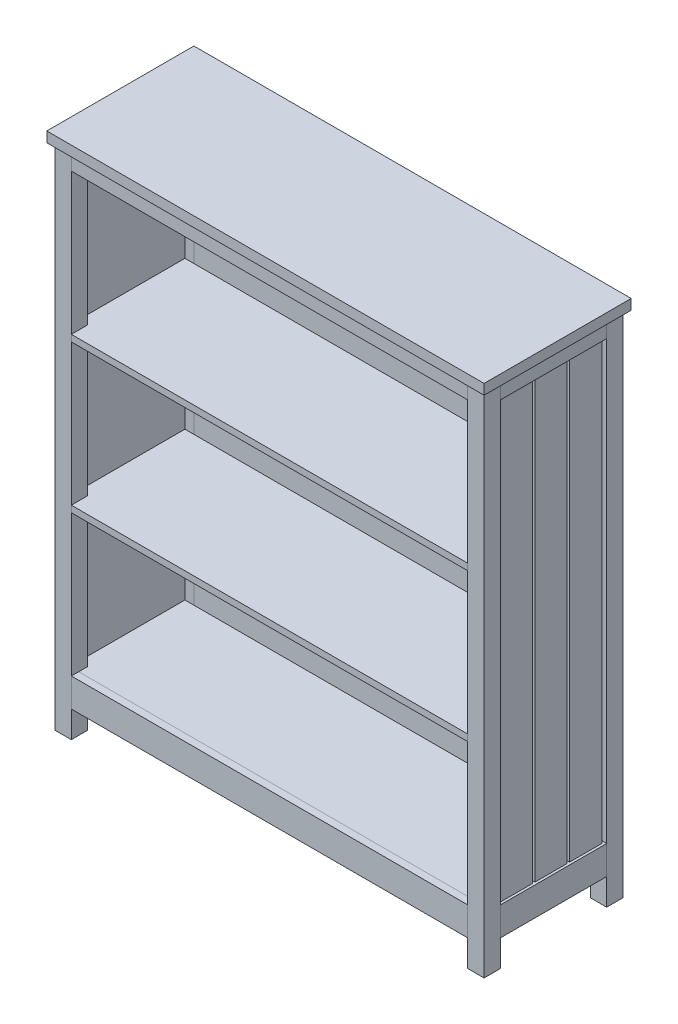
ISO-10303-21;
HEADER;
FILE_DESCRIPTION(('STEP AP214'),'2;1');
FILE_NAME('part.step','',(''),(''),'','','');
FILE_SCHEMA(('AUTOMOTIVE_DESIGN { 1 0 10303 214 1 1 1 1 }'));
ENDSEC;
DATA;
#1=APPLICATION_CONTEXT('core data for automotive mechanical design processes');
#2=APPLICATION_PROTOCOL_DEFINITION('international standard','automotive_design',2000,#1);
#3=PRODUCT_CONTEXT('',#1,'mechanical');
#4=PRODUCT('Part','Part','',(#3));
#5=PRODUCT_RELATED_PRODUCT_CATEGORY('part','',(#4));
#6=PRODUCT_DEFINITION_FORMATION('','',#4);
#7=PRODUCT_DEFINITION_CONTEXT('part definition',#1,'design');
#8=PRODUCT_DEFINITION('design','',#6,#7);
#9=PRODUCT_DEFINITION_SHAPE('','',#8);
#10=(LENGTH_UNIT() NAMED_UNIT(*) SI_UNIT(.MILLI.,.METRE.));
#11=(NAMED_UNIT(*) PLANE_ANGLE_UNIT() SI_UNIT($,.RADIAN.));
#12=(NAMED_UNIT(*) SI_UNIT($,.STERADIAN.) SOLID_ANGLE_UNIT());
#13=UNCERTAINTY_MEASURE_WITH_UNIT(LENGTH_MEASURE(1.E-05),#10,'distance_accuracy_value','');
#14=(GEOMETRIC_REPRESENTATION_CONTEXT(3) GLOBAL_UNCERTAINTY_ASSIGNED_CONTEXT((#13)) GLOBAL_UNIT_ASSIGNED_CONTEXT((#10,
#11,#12)) REPRESENTATION_CONTEXT('',''));
#15=CARTESIAN_POINT('',(0.,0.,0.));
#16=DIRECTION('',(0.,0.,1.));
#17=DIRECTION('',(1.,0.,0.));
#18=AXIS2_PLACEMENT_3D('',#15,#16,#17);
#19=CARTESIAN_POINT('',(174.944580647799,608.391128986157,679.733305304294));
#20=DIRECTION('',(0.,0.,-1.));
#21=DIRECTION('',(-1.,0.,0.));
#22=AXIS2_PLACEMENT_3D('',#19,#20,#21);
#23=PLANE('',#22);
#24=DIRECTION('',(0.,-1.,0.));
#25=VECTOR('',#24,1.);
#26=CARTESIAN_POINT('',(168.944580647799,608.391128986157,679.733305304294));
#27=LINE('',#26,#25);
#28=CARTESIAN_POINT('',(168.944580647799,608.391128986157,679.733305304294));
#29=VERTEX_POINT('',#28);
#30=CARTESIAN_POINT('',(168.944580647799,-461.608871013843,679.733305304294));
#31=VERTEX_POINT('',#30);
#32=EDGE_CURVE('P0_E11',#29,#31,#27,.T.);
#33=ORIENTED_EDGE('',*,*,#32,.T.);
#34=DIRECTION('',(-1.,0.,0.));
#35=VECTOR('',#34,1.);
#36=CARTESIAN_POINT('',(174.944580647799,-461.608871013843,679.733305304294));
#37=LINE('',#36,#35);
#38=CARTESIAN_POINT('',(174.944580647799,-461.608871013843,679.733305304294));
#39=VERTEX_POINT('',#38);
#40=EDGE_CURVE('P0_E88',#39,#31,#37,.T.);
#41=ORIENTED_EDGE('',*,*,#40,.F.);
#42=DIRECTION('',(0.,-1.,0.));
#43=VECTOR('',#42,1.);
#44=CARTESIAN_POINT('',(174.944580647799,608.391128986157,679.733305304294));
#45=LINE('',#44,#43);
#46=CARTESIAN_POINT('',(174.944580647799,608.391128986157,679.733305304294));
#47=VERTEX_POINT('',#46);
#48=EDGE_CURVE('P0_E21',#47,#39,#45,.T.);
#49=ORIENTED_EDGE('',*,*,#48,.F.);
#50=DIRECTION('',(-1.,0.,0.));
#51=VECTOR('',#50,1.);
#52=CARTESIAN_POINT('',(174.944580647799,608.391128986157,679.733305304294));
#53=LINE('',#52,#51);
#54=EDGE_CURVE('P0_E61',#47,#29,#53,.T.);
#55=ORIENTED_EDGE('',*,*,#54,.T.);
#56=EDGE_LOOP('',(#33,#41,#49,#55));
#57=FACE_BOUND('',#56,.T.);
#58=ADVANCED_FACE('P0_F17',(#57),#23,.F.);
#59=CARTESIAN_POINT('',(174.944580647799,-461.608871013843,679.733305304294));
#60=DIRECTION('',(0.,1.,0.));
#61=DIRECTION('',(0.,0.,1.));
#62=AXIS2_PLACEMENT_3D('',#59,#60,#61);
#63=PLANE('',#62);
#64=DIRECTION('',(0.,0.,-1.));
#65=VECTOR('',#64,1.);
#66=CARTESIAN_POINT('',(168.944580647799,-461.608871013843,679.733305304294));
#67=LINE('',#66,#65);
#68=CARTESIAN_POINT('',(168.944580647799,-461.608871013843,601.066638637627));
#69=VERTEX_POINT('',#68);
#70=EDGE_CURVE('P0_E27',#31,#69,#67,.T.);
#71=ORIENTED_EDGE('',*,*,#70,.T.);
#72=DIRECTION('',(-1.,0.,0.));
#73=VECTOR('',#72,1.);
#74=CARTESIAN_POINT('',(174.944580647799,-461.608871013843,601.066638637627));
#75=LINE('',#74,#73);
#76=CARTESIAN_POINT('',(174.944580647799,-461.608871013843,601.066638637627));
#77=VERTEX_POINT('',#76);
#78=EDGE_CURVE('P0_E75',#77,#69,#75,.T.);
#79=ORIENTED_EDGE('',*,*,#78,.F.);
#80=DIRECTION('',(0.,0.,-1.));
#81=VECTOR('',#80,1.);
#82=CARTESIAN_POINT('',(174.944580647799,-461.608871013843,679.733305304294));
#83=LINE('',#82,#81);
#84=EDGE_CURVE('P0_E53',#39,#77,#83,.T.);
#85=ORIENTED_EDGE('',*,*,#84,.F.);
#86=ORIENTED_EDGE('',*,*,#40,.T.);
#87=EDGE_LOOP('',(#71,#79,#85,#86));
#88=FACE_BOUND('',#87,.T.);
#89=ADVANCED_FACE('P0_F91',(#88),#63,.F.);
#90=CARTESIAN_POINT('',(174.944580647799,608.391128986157,601.066638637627));
#91=DIRECTION('',(0.,0.,-1.));
#92=DIRECTION('',(-1.,0.,0.));
#93=AXIS2_PLACEMENT_3D('',#90,#91,#92);
#94=PLANE('',#93);
#95=DIRECTION('',(0.,-1.,0.));
#96=VECTOR('',#95,1.);
#97=CARTESIAN_POINT('',(168.944580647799,608.391128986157,601.066638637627));
#98=LINE('',#97,#96);
#99=CARTESIAN_POINT('',(168.944580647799,608.391128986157,601.066638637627));
#100=VERTEX_POINT('',#99);
#101=EDGE_CURVE('P0_E77',#100,#69,#98,.T.);
#102=ORIENTED_EDGE('',*,*,#101,.F.);
#103=DIRECTION('',(-1.,0.,0.));
#104=VECTOR('',#103,1.);
#105=CARTESIAN_POINT('',(174.944580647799,608.391128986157,601.066638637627));
#106=LINE('',#105,#104);
#107=CARTESIAN_POINT('',(174.944580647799,608.391128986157,601.066638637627));
#108=VERTEX_POINT('',#107);
#109=EDGE_CURVE('P0_E66',#108,#100,#106,.T.);
#110=ORIENTED_EDGE('',*,*,#109,.F.);
#111=DIRECTION('',(0.,-1.,0.));
#112=VECTOR('',#111,1.);
#113=CARTESIAN_POINT('',(174.944580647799,608.391128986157,601.066638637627));
#114=LINE('',#113,#112);
#115=EDGE_CURVE('P0_E86',#108,#77,#114,.T.);
#116=ORIENTED_EDGE('',*,*,#115,.T.);
#117=ORIENTED_EDGE('',*,*,#78,.T.);
#118=EDGE_LOOP('',(#102,#110,#116,#117));
#119=FACE_BOUND('',#118,.T.);
#120=ADVANCED_FACE('P0_F78',(#119),#94,.T.);
#121=CARTESIAN_POINT('',(174.944580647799,608.391128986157,679.733305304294));
#122=DIRECTION('',(0.,1.,0.));
#123=DIRECTION('',(0.,0.,1.));
#124=AXIS2_PLACEMENT_3D('',#121,#122,#123);
#125=PLANE('',#124);
#126=DIRECTION('',(0.,0.,-1.));
#127=VECTOR('',#126,1.);
#128=CARTESIAN_POINT('',(168.944580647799,608.391128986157,679.733305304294));
#129=LINE('',#128,#127);
#130=EDGE_CURVE('P0_E70',#29,#100,#129,.T.);
#131=ORIENTED_EDGE('',*,*,#130,.F.);
#132=ORIENTED_EDGE('',*,*,#54,.F.);
#133=DIRECTION('',(0.,0.,-1.));
#134=VECTOR('',#133,1.);
#135=CARTESIAN_POINT('',(174.944580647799,608.391128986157,679.733305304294));
#136=LINE('',#135,#134);
#137=EDGE_CURVE('P0_E72',#47,#108,#136,.T.);
#138=ORIENTED_EDGE('',*,*,#137,.T.);
#139=ORIENTED_EDGE('',*,*,#109,.T.);
#140=EDGE_LOOP('',(#131,#132,#138,#139));
#141=FACE_BOUND('',#140,.T.);
#142=ADVANCED_FACE('P0_F68',(#141),#125,.T.);
#143=CARTESIAN_POINT('',(174.944580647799,-360.,39.3333333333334));
#144=DIRECTION('',(1.,0.,0.));
#145=DIRECTION('',(0.,0.,-1.));
#146=AXIS2_PLACEMENT_3D('',#143,#144,#145);
#147=PLANE('',#146);
#148=ORIENTED_EDGE('',*,*,#48,.T.);
#149=ORIENTED_EDGE('',*,*,#84,.T.);
#150=ORIENTED_EDGE('',*,*,#115,.F.);
#151=ORIENTED_EDGE('',*,*,#137,.F.);
#152=EDGE_LOOP('',(#148,#149,#150,#151));
#153=FACE_BOUND('',#152,.T.);
#154=ADVANCED_FACE('P0_F19',(#153),#147,.T.);
#155=CARTESIAN_POINT('',(168.944580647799,-360.,39.3333333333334));
#156=DIRECTION('',(1.,0.,0.));
#157=DIRECTION('',(0.,0.,-1.));
#158=AXIS2_PLACEMENT_3D('',#155,#156,#157);
#159=PLANE('',#158);
#160=ORIENTED_EDGE('',*,*,#32,.F.);
#161=ORIENTED_EDGE('',*,*,#130,.T.);
#162=ORIENTED_EDGE('',*,*,#101,.T.);
#163=ORIENTED_EDGE('',*,*,#70,.F.);
#164=EDGE_LOOP('',(#160,#161,#162,#163));
#165=FACE_BOUND('',#164,.T.);
#166=ADVANCED_FACE('P0_F80',(#165),#159,.F.);
#167=CLOSED_SHELL('',(#58,#89,#120,#142,#154,#166));
#168=MANIFOLD_SOLID_BREP('P0_B1',#167);
#169=CARTESIAN_POINT('',(1206.9445806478,608.391128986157,679.733305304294));
#170=DIRECTION('',(0.,0.,-1.));
#171=DIRECTION('',(-1.,0.,0.));
#172=AXIS2_PLACEMENT_3D('',#169,#170,#171);
#173=PLANE('',#172);
#174=DIRECTION('',(0.,-1.,0.));
#175=VECTOR('',#174,1.);
#176=CARTESIAN_POINT('',(1200.9445806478,608.391128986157,679.733305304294));
#177=LINE('',#176,#175);
#178=CARTESIAN_POINT('',(1200.9445806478,608.391128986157,679.733305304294));
#179=VERTEX_POINT('',#178);
#180=CARTESIAN_POINT('',(1200.9445806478,-461.608871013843,679.733305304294));
#181=VERTEX_POINT('',#180);
#182=EDGE_CURVE('P1_E11',#179,#181,#177,.T.);
#183=ORIENTED_EDGE('',*,*,#182,.T.);
#184=DIRECTION('',(-1.,0.,0.));
#185=VECTOR('',#184,1.);
#186=CARTESIAN_POINT('',(1206.9445806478,-461.608871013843,679.733305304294));
#187=LINE('',#186,#185);
#188=CARTESIAN_POINT('',(1206.9445806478,-461.608871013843,679.733305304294));
#189=VERTEX_POINT('',#188);
#190=EDGE_CURVE('P1_E88',#189,#181,#187,.T.);
#191=ORIENTED_EDGE('',*,*,#190,.F.);
#192=DIRECTION('',(0.,-1.,0.));
#193=VECTOR('',#192,1.);
#194=CARTESIAN_POINT('',(1206.9445806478,608.391128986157,679.733305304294));
#195=LINE('',#194,#193);
#196=CARTESIAN_POINT('',(1206.9445806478,608.391128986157,679.733305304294));
#197=VERTEX_POINT('',#196);
#198=EDGE_CURVE('P1_E21',#197,#189,#195,.T.);
#199=ORIENTED_EDGE('',*,*,#198,.F.);
#200=DIRECTION('',(-1.,0.,0.));
#201=VECTOR('',#200,1.);
#202=CARTESIAN_POINT('',(1206.9445806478,608.391128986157,679.733305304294));
#203=LINE('',#202,#201);
#204=EDGE_CURVE('P1_E61',#197,#179,#203,.T.);
#205=ORIENTED_EDGE('',*,*,#204,.T.);
#206=EDGE_LOOP('',(#183,#191,#199,#205));
#207=FACE_BOUND('',#206,.T.);
#208=ADVANCED_FACE('P1_F17',(#207),#173,.F.);
#209=CARTESIAN_POINT('',(1206.9445806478,-461.608871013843,679.733305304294));
#210=DIRECTION('',(0.,1.,0.));
#211=DIRECTION('',(0.,0.,1.));
#212=AXIS2_PLACEMENT_3D('',#209,#210,#211);
#213=PLANE('',#212);
#214=DIRECTION('',(0.,0.,-1.));
#215=VECTOR('',#214,1.);
#216=CARTESIAN_POINT('',(1200.9445806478,-461.608871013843,679.733305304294));
#217=LINE('',#216,#215);
#218=CARTESIAN_POINT('',(1200.9445806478,-461.608871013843,601.066638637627));
#219=VERTEX_POINT('',#218);
#220=EDGE_CURVE('P1_E27',#181,#219,#217,.T.);
#221=ORIENTED_EDGE('',*,*,#220,.T.);
#222=DIRECTION('',(-1.,0.,0.));
#223=VECTOR('',#222,1.);
#224=CARTESIAN_POINT('',(1206.9445806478,-461.608871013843,601.066638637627));
#225=LINE('',#224,#223);
#226=CARTESIAN_POINT('',(1206.9445806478,-461.608871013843,601.066638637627));
#227=VERTEX_POINT('',#226);
#228=EDGE_CURVE('P1_E75',#227,#219,#225,.T.);
#229=ORIENTED_EDGE('',*,*,#228,.F.);
#230=DIRECTION('',(0.,0.,-1.));
#231=VECTOR('',#230,1.);
#232=CARTESIAN_POINT('',(1206.9445806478,-461.608871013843,679.733305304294));
#233=LINE('',#232,#231);
#234=EDGE_CURVE('P1_E53',#189,#227,#233,.T.);
#235=ORIENTED_EDGE('',*,*,#234,.F.);
#236=ORIENTED_EDGE('',*,*,#190,.T.);
#237=EDGE_LOOP('',(#221,#229,#235,#236));
#238=FACE_BOUND('',#237,.T.);
#239=ADVANCED_FACE('P1_F91',(#238),#213,.F.);
#240=CARTESIAN_POINT('',(1206.9445806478,608.391128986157,601.066638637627));
#241=DIRECTION('',(0.,0.,-1.));
#242=DIRECTION('',(-1.,0.,0.));
#243=AXIS2_PLACEMENT_3D('',#240,#241,#242);
#244=PLANE('',#243);
#245=DIRECTION('',(0.,-1.,0.));
#246=VECTOR('',#245,1.);
#247=CARTESIAN_POINT('',(1200.9445806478,608.391128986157,601.066638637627));
#248=LINE('',#247,#246);
#249=CARTESIAN_POINT('',(1200.9445806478,608.391128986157,601.066638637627));
#250=VERTEX_POINT('',#249);
#251=EDGE_CURVE('P1_E77',#250,#219,#248,.T.);
#252=ORIENTED_EDGE('',*,*,#251,.F.);
#253=DIRECTION('',(-1.,0.,0.));
#254=VECTOR('',#253,1.);
#255=CARTESIAN_POINT('',(1206.9445806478,608.391128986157,601.066638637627));
#256=LINE('',#255,#254);
#257=CARTESIAN_POINT('',(1206.9445806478,608.391128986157,601.066638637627));
#258=VERTEX_POINT('',#257);
#259=EDGE_CURVE('P1_E66',#258,#250,#256,.T.);
#260=ORIENTED_EDGE('',*,*,#259,.F.);
#261=DIRECTION('',(0.,-1.,0.));
#262=VECTOR('',#261,1.);
#263=CARTESIAN_POINT('',(1206.9445806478,608.391128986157,601.066638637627));
#264=LINE('',#263,#262);
#265=EDGE_CURVE('P1_E86',#258,#227,#264,.T.);
#266=ORIENTED_EDGE('',*,*,#265,.T.);
#267=ORIENTED_EDGE('',*,*,#228,.T.);
#268=EDGE_LOOP('',(#252,#260,#266,#267));
#269=FACE_BOUND('',#268,.T.);
#270=ADVANCED_FACE('P1_F78',(#269),#244,.T.);
#271=CARTESIAN_POINT('',(1206.9445806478,608.391128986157,679.733305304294));
#272=DIRECTION('',(0.,1.,0.));
#273=DIRECTION('',(0.,0.,1.));
#274=AXIS2_PLACEMENT_3D('',#271,#272,#273);
#275=PLANE('',#274);
#276=DIRECTION('',(0.,0.,-1.));
#277=VECTOR('',#276,1.);
#278=CARTESIAN_POINT('',(1200.9445806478,608.391128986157,679.733305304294));
#279=LINE('',#278,#277);
#280=EDGE_CURVE('P1_E70',#179,#250,#279,.T.);
#281=ORIENTED_EDGE('',*,*,#280,.F.);
#282=ORIENTED_EDGE('',*,*,#204,.F.);
#283=DIRECTION('',(0.,0.,-1.));
#284=VECTOR('',#283,1.);
#285=CARTESIAN_POINT('',(1206.9445806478,608.391128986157,679.733305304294));
#286=LINE('',#285,#284);
#287=EDGE_CURVE('P1_E72',#197,#258,#286,.T.);
#288=ORIENTED_EDGE('',*,*,#287,.T.);
#289=ORIENTED_EDGE('',*,*,#259,.T.);
#290=EDGE_LOOP('',(#281,#282,#288,#289));
#291=FACE_BOUND('',#290,.T.);
#292=ADVANCED_FACE('P1_F68',(#291),#275,.T.);
#293=CARTESIAN_POINT('',(1206.9445806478,-360.,39.3333333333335));
#294=DIRECTION('',(1.,0.,0.));
#295=DIRECTION('',(0.,0.,-1.));
#296=AXIS2_PLACEMENT_3D('',#293,#294,#295);
#297=PLANE('',#296);
#298=ORIENTED_EDGE('',*,*,#198,.T.);
#299=ORIENTED_EDGE('',*,*,#234,.T.);
#300=ORIENTED_EDGE('',*,*,#265,.F.);
#301=ORIENTED_EDGE('',*,*,#287,.F.);
#302=EDGE_LOOP('',(#298,#299,#300,#301));
#303=FACE_BOUND('',#302,.T.);
#304=ADVANCED_FACE('P1_F19',(#303),#297,.T.);
#305=CARTESIAN_POINT('',(1200.9445806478,-360.,39.3333333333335));
#306=DIRECTION('',(1.,0.,0.));
#307=DIRECTION('',(0.,0.,-1.));
#308=AXIS2_PLACEMENT_3D('',#305,#306,#307);
#309=PLANE('',#308);
#310=ORIENTED_EDGE('',*,*,#182,.F.);
#311=ORIENTED_EDGE('',*,*,#280,.T.);
#312=ORIENTED_EDGE('',*,*,#251,.T.);
#313=ORIENTED_EDGE('',*,*,#220,.F.);
#314=EDGE_LOOP('',(#310,#311,#312,#313));
#315=FACE_BOUND('',#314,.T.);
#316=ADVANCED_FACE('P1_F80',(#315),#309,.F.);
#317=CLOSED_SHELL('',(#208,#239,#270,#292,#304,#316));
#318=MANIFOLD_SOLID_BREP('P1_B1',#317);
#319=CARTESIAN_POINT('',(174.944580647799,-360.,431.733305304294));
#320=DIRECTION('',(0.,0.,-1.));
#321=DIRECTION('',(-1.,0.,0.));
#322=AXIS2_PLACEMENT_3D('',#319,#320,#321);
#323=PLANE('',#322);
#324=DIRECTION('',(0.,-1.,0.));
#325=VECTOR('',#324,1.);
#326=CARTESIAN_POINT('',(168.944580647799,-360.,431.733305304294));
#327=LINE('',#326,#325);
#328=CARTESIAN_POINT('',(168.944580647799,608.391128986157,431.733305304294));
#329=VERTEX_POINT('',#328);
#330=CARTESIAN_POINT('',(168.944580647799,-461.608871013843,431.733305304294));
#331=VERTEX_POINT('',#330);
#332=EDGE_CURVE('P2_E11',#329,#331,#327,.T.);
#333=ORIENTED_EDGE('',*,*,#332,.F.);
#334=DIRECTION('',(-1.,0.,0.));
#335=VECTOR('',#334,1.);
#336=CARTESIAN_POINT('',(174.944580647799,608.391128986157,431.733305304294));
#337=LINE('',#336,#335);
#338=CARTESIAN_POINT('',(174.944580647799,608.391128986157,431.733305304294));
#339=VERTEX_POINT('',#338);
#340=EDGE_CURVE('P2_E36',#339,#329,#337,.T.);
#341=ORIENTED_EDGE('',*,*,#340,.F.);
#342=DIRECTION('',(0.,-1.,0.));
#343=VECTOR('',#342,1.);
#344=CARTESIAN_POINT('',(174.944580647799,-360.,431.733305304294));
#345=LINE('',#344,#343);
#346=CARTESIAN_POINT('',(174.944580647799,-461.608871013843,431.733305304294));
#347=VERTEX_POINT('',#346);
#348=EDGE_CURVE('P2_E21',#339,#347,#345,.T.);
#349=ORIENTED_EDGE('',*,*,#348,.T.);
#350=DIRECTION('',(-1.,0.,0.));
#351=VECTOR('',#350,1.);
#352=CARTESIAN_POINT('',(174.944580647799,-461.608871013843,431.733305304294));
#353=LINE('',#352,#351);
#354=EDGE_CURVE('P2_E59',#347,#331,#353,.T.);
#355=ORIENTED_EDGE('',*,*,#354,.T.);
#356=EDGE_LOOP('',(#333,#341,#349,#355));
#357=FACE_BOUND('',#356,.T.);
#358=ADVANCED_FACE('P2_F17',(#357),#323,.T.);
#359=CARTESIAN_POINT('',(174.944580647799,608.391128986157,39.3333333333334));
#360=DIRECTION('',(0.,1.,0.));
#361=DIRECTION('',(0.,0.,1.));
#362=AXIS2_PLACEMENT_3D('',#359,#360,#361);
#363=PLANE('',#362);
#364=DIRECTION('',(0.,0.,-1.));
#365=VECTOR('',#364,1.);
#366=CARTESIAN_POINT('',(168.944580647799,608.391128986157,39.3333333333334));
#367=LINE('',#366,#365);
#368=CARTESIAN_POINT('',(168.944580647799,608.391128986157,510.39997197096));
#369=VERTEX_POINT('',#368);
#370=EDGE_CURVE('P2_E27',#369,#329,#367,.T.);
#371=ORIENTED_EDGE('',*,*,#370,.F.);
#372=DIRECTION('',(-1.,0.,0.));
#373=VECTOR('',#372,1.);
#374=CARTESIAN_POINT('',(174.944580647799,608.391128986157,510.39997197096));
#375=LINE('',#374,#373);
#376=CARTESIAN_POINT('',(174.944580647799,608.391128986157,510.39997197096));
#377=VERTEX_POINT('',#376);
#378=EDGE_CURVE('P2_E50',#377,#369,#375,.T.);
#379=ORIENTED_EDGE('',*,*,#378,.F.);
#380=DIRECTION('',(0.,0.,-1.));
#381=VECTOR('',#380,1.);
#382=CARTESIAN_POINT('',(174.944580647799,608.391128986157,39.3333333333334));
#383=LINE('',#382,#381);
#384=EDGE_CURVE('P2_E81',#377,#339,#383,.T.);
#385=ORIENTED_EDGE('',*,*,#384,.T.);
#386=ORIENTED_EDGE('',*,*,#340,.T.);
#387=EDGE_LOOP('',(#371,#379,#385,#386));
#388=FACE_BOUND('',#387,.T.);
#389=ADVANCED_FACE('P2_F88',(#388),#363,.T.);
#390=CARTESIAN_POINT('',(174.944580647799,-360.,510.39997197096));
#391=DIRECTION('',(0.,0.,-1.));
#392=DIRECTION('',(-1.,0.,0.));
#393=AXIS2_PLACEMENT_3D('',#390,#391,#392);
#394=PLANE('',#393);
#395=DIRECTION('',(0.,-1.,0.));
#396=VECTOR('',#395,1.);
#397=CARTESIAN_POINT('',(168.944580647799,-360.,510.39997197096));
#398=LINE('',#397,#396);
#399=CARTESIAN_POINT('',(168.944580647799,-461.608871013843,510.39997197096));
#400=VERTEX_POINT('',#399);
#401=EDGE_CURVE('P2_E65',#369,#400,#398,.T.);
#402=ORIENTED_EDGE('',*,*,#401,.T.);
#403=DIRECTION('',(-1.,0.,0.));
#404=VECTOR('',#403,1.);
#405=CARTESIAN_POINT('',(174.944580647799,-461.608871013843,510.39997197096));
#406=LINE('',#405,#404);
#407=CARTESIAN_POINT('',(174.944580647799,-461.608871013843,510.39997197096));
#408=VERTEX_POINT('',#407);
#409=EDGE_CURVE('P2_E68',#408,#400,#406,.T.);
#410=ORIENTED_EDGE('',*,*,#409,.F.);
#411=DIRECTION('',(0.,-1.,0.));
#412=VECTOR('',#411,1.);
#413=CARTESIAN_POINT('',(174.944580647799,-360.,510.39997197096));
#414=LINE('',#413,#412);
#415=EDGE_CURVE('P2_E86',#377,#408,#414,.T.);
#416=ORIENTED_EDGE('',*,*,#415,.F.);
#417=ORIENTED_EDGE('',*,*,#378,.T.);
#418=EDGE_LOOP('',(#402,#410,#416,#417));
#419=FACE_BOUND('',#418,.T.);
#420=ADVANCED_FACE('P2_F67',(#419),#394,.F.);
#421=CARTESIAN_POINT('',(174.944580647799,-461.608871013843,39.3333333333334));
#422=DIRECTION('',(0.,1.,0.));
#423=DIRECTION('',(0.,0.,1.));
#424=AXIS2_PLACEMENT_3D('',#421,#422,#423);
#425=PLANE('',#424);
#426=DIRECTION('',(0.,0.,-1.));
#427=VECTOR('',#426,1.);
#428=CARTESIAN_POINT('',(168.944580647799,-461.608871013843,39.3333333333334));
#429=LINE('',#428,#427);
#430=EDGE_CURVE('P2_E73',#400,#331,#429,.T.);
#431=ORIENTED_EDGE('',*,*,#430,.T.);
#432=ORIENTED_EDGE('',*,*,#354,.F.);
#433=DIRECTION('',(0.,0.,-1.));
#434=VECTOR('',#433,1.);
#435=CARTESIAN_POINT('',(174.944580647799,-461.608871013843,39.3333333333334));
#436=LINE('',#435,#434);
#437=EDGE_CURVE('P2_E77',#408,#347,#436,.T.);
#438=ORIENTED_EDGE('',*,*,#437,.F.);
#439=ORIENTED_EDGE('',*,*,#409,.T.);
#440=EDGE_LOOP('',(#431,#432,#438,#439));
#441=FACE_BOUND('',#440,.T.);
#442=ADVANCED_FACE('P2_F76',(#441),#425,.F.);
#443=CARTESIAN_POINT('',(174.944580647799,-360.,39.3333333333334));
#444=DIRECTION('',(1.,0.,0.));
#445=DIRECTION('',(0.,0.,-1.));
#446=AXIS2_PLACEMENT_3D('',#443,#444,#445);
#447=PLANE('',#446);
#448=ORIENTED_EDGE('',*,*,#348,.F.);
#449=ORIENTED_EDGE('',*,*,#384,.F.);
#450=ORIENTED_EDGE('',*,*,#415,.T.);
#451=ORIENTED_EDGE('',*,*,#437,.T.);
#452=EDGE_LOOP('',(#448,#449,#450,#451));
#453=FACE_BOUND('',#452,.T.);
#454=ADVANCED_FACE('P2_F19',(#453),#447,.T.);
#455=CARTESIAN_POINT('',(168.944580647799,-360.,39.3333333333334));
#456=DIRECTION('',(1.,0.,0.));
#457=DIRECTION('',(0.,0.,-1.));
#458=AXIS2_PLACEMENT_3D('',#455,#456,#457);
#459=PLANE('',#458);
#460=ORIENTED_EDGE('',*,*,#332,.T.);
#461=ORIENTED_EDGE('',*,*,#430,.F.);
#462=ORIENTED_EDGE('',*,*,#401,.F.);
#463=ORIENTED_EDGE('',*,*,#370,.T.);
#464=EDGE_LOOP('',(#460,#461,#462,#463));
#465=FACE_BOUND('',#464,.T.);
#466=ADVANCED_FACE('P2_F79',(#465),#459,.F.);
#467=CLOSED_SHELL('',(#358,#389,#420,#442,#454,#466));
#468=MANIFOLD_SOLID_BREP('P2_B1',#467);
#469=CARTESIAN_POINT('',(1206.9445806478,-360.,431.733305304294));
#470=DIRECTION('',(0.,0.,-1.));
#471=DIRECTION('',(-1.,0.,0.));
#472=AXIS2_PLACEMENT_3D('',#469,#470,#471);
#473=PLANE('',#472);
#474=DIRECTION('',(0.,-1.,0.));
#475=VECTOR('',#474,1.);
#476=CARTESIAN_POINT('',(1200.9445806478,-360.,431.733305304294));
#477=LINE('',#476,#475);
#478=CARTESIAN_POINT('',(1200.9445806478,608.391128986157,431.733305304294));
#479=VERTEX_POINT('',#478);
#480=CARTESIAN_POINT('',(1200.9445806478,-461.608871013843,431.733305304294));
#481=VERTEX_POINT('',#480);
#482=EDGE_CURVE('P3_E11',#479,#481,#477,.T.);
#483=ORIENTED_EDGE('',*,*,#482,.F.);
#484=DIRECTION('',(-1.,0.,0.));
#485=VECTOR('',#484,1.);
#486=CARTESIAN_POINT('',(1206.9445806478,608.391128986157,431.733305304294));
#487=LINE('',#486,#485);
#488=CARTESIAN_POINT('',(1206.9445806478,608.391128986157,431.733305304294));
#489=VERTEX_POINT('',#488);
#490=EDGE_CURVE('P3_E36',#489,#479,#487,.T.);
#491=ORIENTED_EDGE('',*,*,#490,.F.);
#492=DIRECTION('',(0.,-1.,0.));
#493=VECTOR('',#492,1.);
#494=CARTESIAN_POINT('',(1206.9445806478,-360.,431.733305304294));
#495=LINE('',#494,#493);
#496=CARTESIAN_POINT('',(1206.9445806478,-461.608871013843,431.733305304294));
#497=VERTEX_POINT('',#496);
#498=EDGE_CURVE('P3_E21',#489,#497,#495,.T.);
#499=ORIENTED_EDGE('',*,*,#498,.T.);
#500=DIRECTION('',(-1.,0.,0.));
#501=VECTOR('',#500,1.);
#502=CARTESIAN_POINT('',(1206.9445806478,-461.608871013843,431.733305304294));
#503=LINE('',#502,#501);
#504=EDGE_CURVE('P3_E59',#497,#481,#503,.T.);
#505=ORIENTED_EDGE('',*,*,#504,.T.);
#506=EDGE_LOOP('',(#483,#491,#499,#505));
#507=FACE_BOUND('',#506,.T.);
#508=ADVANCED_FACE('P3_F17',(#507),#473,.T.);
#509=CARTESIAN_POINT('',(1206.9445806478,608.391128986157,39.3333333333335));
#510=DIRECTION('',(0.,1.,0.));
#511=DIRECTION('',(0.,0.,1.));
#512=AXIS2_PLACEMENT_3D('',#509,#510,#511);
#513=PLANE('',#512);
#514=DIRECTION('',(0.,0.,-1.));
#515=VECTOR('',#514,1.);
#516=CARTESIAN_POINT('',(1200.9445806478,608.391128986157,39.3333333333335));
#517=LINE('',#516,#515);
#518=CARTESIAN_POINT('',(1200.9445806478,608.391128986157,510.399971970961));
#519=VERTEX_POINT('',#518);
#520=EDGE_CURVE('P3_E27',#519,#479,#517,.T.);
#521=ORIENTED_EDGE('',*,*,#520,.F.);
#522=DIRECTION('',(-1.,0.,0.));
#523=VECTOR('',#522,1.);
#524=CARTESIAN_POINT('',(1206.9445806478,608.391128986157,510.399971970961));
#525=LINE('',#524,#523);
#526=CARTESIAN_POINT('',(1206.9445806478,608.391128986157,510.399971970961));
#527=VERTEX_POINT('',#526);
#528=EDGE_CURVE('P3_E50',#527,#519,#525,.T.);
#529=ORIENTED_EDGE('',*,*,#528,.F.);
#530=DIRECTION('',(0.,0.,-1.));
#531=VECTOR('',#530,1.);
#532=CARTESIAN_POINT('',(1206.9445806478,608.391128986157,39.3333333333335));
#533=LINE('',#532,#531);
#534=EDGE_CURVE('P3_E81',#527,#489,#533,.T.);
#535=ORIENTED_EDGE('',*,*,#534,.T.);
#536=ORIENTED_EDGE('',*,*,#490,.T.);
#537=EDGE_LOOP('',(#521,#529,#535,#536));
#538=FACE_BOUND('',#537,.T.);
#539=ADVANCED_FACE('P3_F88',(#538),#513,.T.);
#540=CARTESIAN_POINT('',(1206.9445806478,-360.,510.399971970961));
#541=DIRECTION('',(0.,0.,-1.));
#542=DIRECTION('',(-1.,0.,0.));
#543=AXIS2_PLACEMENT_3D('',#540,#541,#542);
#544=PLANE('',#543);
#545=DIRECTION('',(0.,-1.,0.));
#546=VECTOR('',#545,1.);
#547=CARTESIAN_POINT('',(1200.9445806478,-360.,510.399971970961));
#548=LINE('',#547,#546);
#549=CARTESIAN_POINT('',(1200.9445806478,-461.608871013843,510.399971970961));
#550=VERTEX_POINT('',#549);
#551=EDGE_CURVE('P3_E65',#519,#550,#548,.T.);
#552=ORIENTED_EDGE('',*,*,#551,.T.);
#553=DIRECTION('',(-1.,0.,0.));
#554=VECTOR('',#553,1.);
#555=CARTESIAN_POINT('',(1206.9445806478,-461.608871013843,510.399971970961));
#556=LINE('',#555,#554);
#557=CARTESIAN_POINT('',(1206.9445806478,-461.608871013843,510.399971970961));
#558=VERTEX_POINT('',#557);
#559=EDGE_CURVE('P3_E68',#558,#550,#556,.T.);
#560=ORIENTED_EDGE('',*,*,#559,.F.);
#561=DIRECTION('',(0.,-1.,0.));
#562=VECTOR('',#561,1.);
#563=CARTESIAN_POINT('',(1206.9445806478,-360.,510.399971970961));
#564=LINE('',#563,#562);
#565=EDGE_CURVE('P3_E86',#527,#558,#564,.T.);
#566=ORIENTED_EDGE('',*,*,#565,.F.);
#567=ORIENTED_EDGE('',*,*,#528,.T.);
#568=EDGE_LOOP('',(#552,#560,#566,#567));
#569=FACE_BOUND('',#568,.T.);
#570=ADVANCED_FACE('P3_F67',(#569),#544,.F.);
#571=CARTESIAN_POINT('',(1206.9445806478,-461.608871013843,39.3333333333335));
#572=DIRECTION('',(0.,1.,0.));
#573=DIRECTION('',(0.,0.,1.));
#574=AXIS2_PLACEMENT_3D('',#571,#572,#573);
#575=PLANE('',#574);
#576=DIRECTION('',(0.,0.,-1.));
#577=VECTOR('',#576,1.);
#578=CARTESIAN_POINT('',(1200.9445806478,-461.608871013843,39.3333333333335));
#579=LINE('',#578,#577);
#580=EDGE_CURVE('P3_E73',#550,#481,#579,.T.);
#581=ORIENTED_EDGE('',*,*,#580,.T.);
#582=ORIENTED_EDGE('',*,*,#504,.F.);
#583=DIRECTION('',(0.,0.,-1.));
#584=VECTOR('',#583,1.);
#585=CARTESIAN_POINT('',(1206.9445806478,-461.608871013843,39.3333333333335));
#586=LINE('',#585,#584);
#587=EDGE_CURVE('P3_E77',#558,#497,#586,.T.);
#588=ORIENTED_EDGE('',*,*,#587,.F.);
#589=ORIENTED_EDGE('',*,*,#559,.T.);
#590=EDGE_LOOP('',(#581,#582,#588,#589));
#591=FACE_BOUND('',#590,.T.);
#592=ADVANCED_FACE('P3_F76',(#591),#575,.F.);
#593=CARTESIAN_POINT('',(1206.9445806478,-360.,39.3333333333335));
#594=DIRECTION('',(1.,0.,0.));
#595=DIRECTION('',(0.,0.,-1.));
#596=AXIS2_PLACEMENT_3D('',#593,#594,#595);
#597=PLANE('',#596);
#598=ORIENTED_EDGE('',*,*,#498,.F.);
#599=ORIENTED_EDGE('',*,*,#534,.F.);
#600=ORIENTED_EDGE('',*,*,#565,.T.);
#601=ORIENTED_EDGE('',*,*,#587,.T.);
#602=EDGE_LOOP('',(#598,#599,#600,#601));
#603=FACE_BOUND('',#602,.T.);
#604=ADVANCED_FACE('P3_F19',(#603),#597,.T.);
#605=CARTESIAN_POINT('',(1200.9445806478,-360.,39.3333333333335));
#606=DIRECTION('',(1.,0.,0.));
#607=DIRECTION('',(0.,0.,-1.));
#608=AXIS2_PLACEMENT_3D('',#605,#606,#607);
#609=PLANE('',#608);
#610=ORIENTED_EDGE('',*,*,#482,.T.);
#611=ORIENTED_EDGE('',*,*,#580,.F.);
#612=ORIENTED_EDGE('',*,*,#551,.F.);
#613=ORIENTED_EDGE('',*,*,#520,.T.);
#614=EDGE_LOOP('',(#610,#611,#612,#613));
#615=FACE_BOUND('',#614,.T.);
#616=ADVANCED_FACE('P3_F79',(#615),#609,.F.);
#617=CLOSED_SHELL('',(#508,#539,#570,#592,#604,#616));
#618=MANIFOLD_SOLID_BREP('P3_B1',#617);
#619=CARTESIAN_POINT('',(1194.9445806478,262.391128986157,725.733305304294));
#620=DIRECTION('',(0.,0.,1.));
#621=DIRECTION('',(1.,0.,0.));
#622=AXIS2_PLACEMENT_3D('',#619,#620,#621);
#623=PLANE('',#622);
#624=DIRECTION('',(0.,1.,0.));
#625=VECTOR('',#624,1.);
#626=CARTESIAN_POINT('',(1172.9445806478,232.391128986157,725.733305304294));
#627=LINE('',#626,#625);
#628=CARTESIAN_POINT('',(1172.9445806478,246.391128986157,725.733305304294));
#629=VERTEX_POINT('',#628);
#630=CARTESIAN_POINT('',(1172.9445806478,262.391128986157,725.733305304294));
#631=VERTEX_POINT('',#630);
#632=EDGE_CURVE('P4_E158',#629,#631,#627,.T.);
#633=ORIENTED_EDGE('',*,*,#632,.T.);
#634=DIRECTION('',(-1.,0.,0.));
#635=VECTOR('',#634,1.);
#636=CARTESIAN_POINT('',(1194.9445806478,262.391128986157,725.733305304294));
#637=LINE('',#636,#635);
#638=CARTESIAN_POINT('',(202.944580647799,262.391128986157,725.733305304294));
#639=VERTEX_POINT('',#638);
#640=EDGE_CURVE('P4_E119',#631,#639,#637,.T.);
#641=ORIENTED_EDGE('',*,*,#640,.T.);
#642=DIRECTION('',(0.,1.,0.));
#643=VECTOR('',#642,1.);
#644=CARTESIAN_POINT('',(202.944580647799,232.391128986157,725.733305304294));
#645=LINE('',#644,#643);
#646=CARTESIAN_POINT('',(202.944580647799,246.391128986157,725.733305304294));
#647=VERTEX_POINT('',#646);
#648=EDGE_CURVE('P4_E137',#647,#639,#645,.T.);
#649=ORIENTED_EDGE('',*,*,#648,.F.);
#650=DIRECTION('',(-1.,0.,0.));
#651=VECTOR('',#650,1.);
#652=CARTESIAN_POINT('',(1194.9445806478,246.391128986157,725.733305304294));
#653=LINE('',#652,#651);
#654=EDGE_CURVE('P4_E109',#629,#647,#653,.T.);
#655=ORIENTED_EDGE('',*,*,#654,.F.);
#656=EDGE_LOOP('',(#633,#641,#649,#655));
#657=FACE_BOUND('',#656,.T.);
#658=ADVANCED_FACE('P4_F16',(#657),#623,.T.);
#659=CARTESIAN_POINT('',(1194.9445806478,262.391128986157,725.733305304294));
#660=DIRECTION('',(-1.,0.,0.));
#661=DIRECTION('',(0.,0.,1.));
#662=AXIS2_PLACEMENT_3D('',#659,#660,#661);
#663=PLANE('',#662);
#664=DIRECTION('',(0.,0.,-1.));
#665=VECTOR('',#664,1.);
#666=CARTESIAN_POINT('',(1194.9445806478,262.391128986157,725.733305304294));
#667=LINE('',#666,#665);
#668=CARTESIAN_POINT('',(1194.9445806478,262.391128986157,685.733305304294));
#669=VERTEX_POINT('',#668);
#670=CARTESIAN_POINT('',(1194.9445806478,262.391128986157,425.733305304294));
#671=VERTEX_POINT('',#670);
#672=EDGE_CURVE('P4_E93',#669,#671,#667,.T.);
#673=ORIENTED_EDGE('',*,*,#672,.F.);
#674=DIRECTION('',(0.,1.,0.));
#675=VECTOR('',#674,1.);
#676=CARTESIAN_POINT('',(1194.9445806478,232.391128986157,685.733305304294));
#677=LINE('',#676,#675);
#678=CARTESIAN_POINT('',(1194.9445806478,246.391128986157,685.733305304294));
#679=VERTEX_POINT('',#678);
#680=EDGE_CURVE('P4_E78',#679,#669,#677,.T.);
#681=ORIENTED_EDGE('',*,*,#680,.F.);
#682=DIRECTION('',(0.,0.,-1.));
#683=VECTOR('',#682,1.);
#684=CARTESIAN_POINT('',(1194.9445806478,246.391128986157,725.733305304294));
#685=LINE('',#684,#683);
#686=CARTESIAN_POINT('',(1194.9445806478,246.391128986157,425.733305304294));
#687=VERTEX_POINT('',#686);
#688=EDGE_CURVE('P4_E117',#679,#687,#685,.T.);
#689=ORIENTED_EDGE('',*,*,#688,.T.);
#690=DIRECTION('',(0.,-1.,0.));
#691=VECTOR('',#690,1.);
#692=CARTESIAN_POINT('',(1194.9445806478,262.391128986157,425.733305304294));
#693=LINE('',#692,#691);
#694=EDGE_CURVE('P4_E98',#671,#687,#693,.T.);
#695=ORIENTED_EDGE('',*,*,#694,.F.);
#696=EDGE_LOOP('',(#673,#681,#689,#695));
#697=FACE_BOUND('',#696,.T.);
#698=ADVANCED_FACE('P4_F96',(#697),#663,.F.);
#699=CARTESIAN_POINT('',(1194.9445806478,262.391128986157,425.733305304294));
#700=DIRECTION('',(0.,0.,1.));
#701=DIRECTION('',(1.,0.,0.));
#702=AXIS2_PLACEMENT_3D('',#699,#700,#701);
#703=PLANE('',#702);
#704=DIRECTION('',(-1.,0.,0.));
#705=VECTOR('',#704,1.);
#706=CARTESIAN_POINT('',(1194.9445806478,246.391128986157,425.733305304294));
#707=LINE('',#706,#705);
#708=CARTESIAN_POINT('',(180.944580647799,246.391128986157,425.733305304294));
#709=VERTEX_POINT('',#708);
#710=EDGE_CURVE('P4_E114',#687,#709,#707,.T.);
#711=ORIENTED_EDGE('',*,*,#710,.T.);
#712=DIRECTION('',(0.,-1.,0.));
#713=VECTOR('',#712,1.);
#714=CARTESIAN_POINT('',(180.944580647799,262.391128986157,425.733305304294));
#715=LINE('',#714,#713);
#716=CARTESIAN_POINT('',(180.944580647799,262.391128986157,425.733305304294));
#717=VERTEX_POINT('',#716);
#718=EDGE_CURVE('P4_E100',#717,#709,#715,.T.);
#719=ORIENTED_EDGE('',*,*,#718,.F.);
#720=DIRECTION('',(-1.,0.,0.));
#721=VECTOR('',#720,1.);
#722=CARTESIAN_POINT('',(1194.9445806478,262.391128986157,425.733305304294));
#723=LINE('',#722,#721);
#724=EDGE_CURVE('P4_E101',#671,#717,#723,.T.);
#725=ORIENTED_EDGE('',*,*,#724,.F.);
#726=ORIENTED_EDGE('',*,*,#694,.T.);
#727=EDGE_LOOP('',(#711,#719,#725,#726));
#728=FACE_BOUND('',#727,.T.);
#729=ADVANCED_FACE('P4_F154',(#728),#703,.F.);
#730=CARTESIAN_POINT('',(180.944580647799,262.391128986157,725.733305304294));
#731=DIRECTION('',(-1.,0.,0.));
#732=DIRECTION('',(0.,0.,1.));
#733=AXIS2_PLACEMENT_3D('',#730,#731,#732);
#734=PLANE('',#733);
#735=DIRECTION('',(0.,1.,0.));
#736=VECTOR('',#735,1.);
#737=CARTESIAN_POINT('',(180.944580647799,232.391128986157,685.733305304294));
#738=LINE('',#737,#736);
#739=CARTESIAN_POINT('',(180.944580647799,246.391128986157,685.733305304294));
#740=VERTEX_POINT('',#739);
#741=CARTESIAN_POINT('',(180.944580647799,262.391128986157,685.733305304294));
#742=VERTEX_POINT('',#741);
#743=EDGE_CURVE('P4_E112',#740,#742,#738,.T.);
#744=ORIENTED_EDGE('',*,*,#743,.T.);
#745=DIRECTION('',(0.,0.,-1.));
#746=VECTOR('',#745,1.);
#747=CARTESIAN_POINT('',(180.944580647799,262.391128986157,725.733305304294));
#748=LINE('',#747,#746);
#749=EDGE_CURVE('P4_E105',#742,#717,#748,.T.);
#750=ORIENTED_EDGE('',*,*,#749,.T.);
#751=ORIENTED_EDGE('',*,*,#718,.T.);
#752=DIRECTION('',(0.,0.,-1.));
#753=VECTOR('',#752,1.);
#754=CARTESIAN_POINT('',(180.944580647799,246.391128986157,725.733305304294));
#755=LINE('',#754,#753);
#756=EDGE_CURVE('P4_E111',#740,#709,#755,.T.);
#757=ORIENTED_EDGE('',*,*,#756,.F.);
#758=EDGE_LOOP('',(#744,#750,#751,#757));
#759=FACE_BOUND('',#758,.T.);
#760=ADVANCED_FACE('P4_F150',(#759),#734,.T.);
#761=CARTESIAN_POINT('',(1375.8891612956,262.391128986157,18.));
#762=DIRECTION('',(0.,-1.,0.));
#763=DIRECTION('',(0.,0.,-1.));
#764=AXIS2_PLACEMENT_3D('',#761,#762,#763);
#765=PLANE('',#764);
#766=ORIENTED_EDGE('',*,*,#640,.F.);
#767=DIRECTION('',(0.,0.,1.));
#768=VECTOR('',#767,1.);
#769=CARTESIAN_POINT('',(1172.9445806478,262.391128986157,725.733305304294));
#770=LINE('',#769,#768);
#771=CARTESIAN_POINT('',(1172.9445806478,262.391128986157,685.733305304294));
#772=VERTEX_POINT('',#771);
#773=EDGE_CURVE('P4_E87',#772,#631,#770,.T.);
#774=ORIENTED_EDGE('',*,*,#773,.F.);
#775=DIRECTION('',(-1.,0.,0.));
#776=VECTOR('',#775,1.);
#777=CARTESIAN_POINT('',(1194.9445806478,262.391128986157,685.733305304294));
#778=LINE('',#777,#776);
#779=EDGE_CURVE('P4_E81',#669,#772,#778,.T.);
#780=ORIENTED_EDGE('',*,*,#779,.F.);
#781=ORIENTED_EDGE('',*,*,#672,.T.);
#782=ORIENTED_EDGE('',*,*,#724,.T.);
#783=ORIENTED_EDGE('',*,*,#749,.F.);
#784=DIRECTION('',(-1.,0.,0.));
#785=VECTOR('',#784,1.);
#786=CARTESIAN_POINT('',(180.944580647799,262.391128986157,685.733305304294));
#787=LINE('',#786,#785);
#788=CARTESIAN_POINT('',(202.944580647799,262.391128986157,685.733305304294));
#789=VERTEX_POINT('',#788);
#790=EDGE_CURVE('P4_E141',#789,#742,#787,.T.);
#791=ORIENTED_EDGE('',*,*,#790,.F.);
#792=DIRECTION('',(0.,0.,-1.));
#793=VECTOR('',#792,1.);
#794=CARTESIAN_POINT('',(202.944580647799,262.391128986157,725.733305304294));
#795=LINE('',#794,#793);
#796=EDGE_CURVE('P4_E144',#639,#789,#795,.T.);
#797=ORIENTED_EDGE('',*,*,#796,.F.);
#798=EDGE_LOOP('',(#766,#774,#780,#781,#782,#783,#791,#797));
#799=FACE_BOUND('',#798,.T.);
#800=ADVANCED_FACE('P4_F91',(#799),#765,.F.);
#801=CARTESIAN_POINT('',(1375.8891612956,246.391128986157,18.));
#802=DIRECTION('',(0.,-1.,0.));
#803=DIRECTION('',(0.,0.,-1.));
#804=AXIS2_PLACEMENT_3D('',#801,#802,#803);
#805=PLANE('',#804);
#806=DIRECTION('',(0.,0.,-1.));
#807=VECTOR('',#806,1.);
#808=CARTESIAN_POINT('',(1172.9445806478,246.391128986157,18.));
#809=LINE('',#808,#807);
#810=CARTESIAN_POINT('',(1172.9445806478,246.391128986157,685.733305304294));
#811=VERTEX_POINT('',#810);
#812=EDGE_CURVE('P4_E10',#629,#811,#809,.T.);
#813=ORIENTED_EDGE('',*,*,#812,.F.);
#814=ORIENTED_EDGE('',*,*,#654,.T.);
#815=DIRECTION('',(0.,0.,1.));
#816=VECTOR('',#815,1.);
#817=CARTESIAN_POINT('',(202.944580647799,246.391128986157,18.));
#818=LINE('',#817,#816);
#819=CARTESIAN_POINT('',(202.944580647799,246.391128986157,685.733305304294));
#820=VERTEX_POINT('',#819);
#821=EDGE_CURVE('P4_E120',#820,#647,#818,.T.);
#822=ORIENTED_EDGE('',*,*,#821,.F.);
#823=DIRECTION('',(1.,0.,0.));
#824=VECTOR('',#823,1.);
#825=CARTESIAN_POINT('',(1375.8891612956,246.391128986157,685.733305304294));
#826=LINE('',#825,#824);
#827=EDGE_CURVE('P4_E123',#740,#820,#826,.T.);
#828=ORIENTED_EDGE('',*,*,#827,.F.);
#829=ORIENTED_EDGE('',*,*,#756,.T.);
#830=ORIENTED_EDGE('',*,*,#710,.F.);
#831=ORIENTED_EDGE('',*,*,#688,.F.);
#832=DIRECTION('',(1.,0.,0.));
#833=VECTOR('',#832,1.);
#834=CARTESIAN_POINT('',(1375.8891612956,246.391128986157,685.733305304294));
#835=LINE('',#834,#833);
#836=EDGE_CURVE('P4_E23',#811,#679,#835,.T.);
#837=ORIENTED_EDGE('',*,*,#836,.F.);
#838=EDGE_LOOP('',(#813,#814,#822,#828,#829,#830,#831,#837));
#839=FACE_BOUND('',#838,.T.);
#840=ADVANCED_FACE('P4_F132',(#839),#805,.T.);
#841=CARTESIAN_POINT('',(180.944580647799,232.391128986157,685.733305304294));
#842=DIRECTION('',(0.,0.,-1.));
#843=DIRECTION('',(-1.,0.,0.));
#844=AXIS2_PLACEMENT_3D('',#841,#842,#843);
#845=PLANE('',#844);
#846=ORIENTED_EDGE('',*,*,#827,.T.);
#847=DIRECTION('',(0.,1.,0.));
#848=VECTOR('',#847,1.);
#849=CARTESIAN_POINT('',(202.944580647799,232.391128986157,685.733305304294));
#850=LINE('',#849,#848);
#851=EDGE_CURVE('P4_E37',#820,#789,#850,.T.);
#852=ORIENTED_EDGE('',*,*,#851,.T.);
#853=ORIENTED_EDGE('',*,*,#790,.T.);
#854=ORIENTED_EDGE('',*,*,#743,.F.);
#855=EDGE_LOOP('',(#846,#852,#853,#854));
#856=FACE_BOUND('',#855,.T.);
#857=ADVANCED_FACE('P4_F127',(#856),#845,.F.);
#858=CARTESIAN_POINT('',(202.944580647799,232.391128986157,725.733305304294));
#859=DIRECTION('',(1.,0.,0.));
#860=DIRECTION('',(0.,0.,-1.));
#861=AXIS2_PLACEMENT_3D('',#858,#859,#860);
#862=PLANE('',#861);
#863=ORIENTED_EDGE('',*,*,#821,.T.);
#864=ORIENTED_EDGE('',*,*,#648,.T.);
#865=ORIENTED_EDGE('',*,*,#796,.T.);
#866=ORIENTED_EDGE('',*,*,#851,.F.);
#867=EDGE_LOOP('',(#863,#864,#865,#866));
#868=FACE_BOUND('',#867,.T.);
#869=ADVANCED_FACE('P4_F136',(#868),#862,.F.);
#870=CARTESIAN_POINT('',(1172.9445806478,232.391128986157,725.733305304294));
#871=DIRECTION('',(-1.,0.,0.));
#872=DIRECTION('',(0.,0.,1.));
#873=AXIS2_PLACEMENT_3D('',#870,#871,#872);
#874=PLANE('',#873);
#875=ORIENTED_EDGE('',*,*,#812,.T.);
#876=DIRECTION('',(0.,1.,0.));
#877=VECTOR('',#876,1.);
#878=CARTESIAN_POINT('',(1172.9445806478,232.391128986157,685.733305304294));
#879=LINE('',#878,#877);
#880=EDGE_CURVE('P4_E30',#811,#772,#879,.T.);
#881=ORIENTED_EDGE('',*,*,#880,.T.);
#882=ORIENTED_EDGE('',*,*,#773,.T.);
#883=ORIENTED_EDGE('',*,*,#632,.F.);
#884=EDGE_LOOP('',(#875,#881,#882,#883));
#885=FACE_BOUND('',#884,.T.);
#886=ADVANCED_FACE('P4_F157',(#885),#874,.F.);
#887=CARTESIAN_POINT('',(1194.9445806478,232.391128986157,685.733305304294));
#888=DIRECTION('',(0.,0.,-1.));
#889=DIRECTION('',(-1.,0.,0.));
#890=AXIS2_PLACEMENT_3D('',#887,#888,#889);
#891=PLANE('',#890);
#892=ORIENTED_EDGE('',*,*,#836,.T.);
#893=ORIENTED_EDGE('',*,*,#680,.T.);
#894=ORIENTED_EDGE('',*,*,#779,.T.);
#895=ORIENTED_EDGE('',*,*,#880,.F.);
#896=EDGE_LOOP('',(#892,#893,#894,#895));
#897=FACE_BOUND('',#896,.T.);
#898=ADVANCED_FACE('P4_F80',(#897),#891,.F.);
#899=CLOSED_SHELL('',(#658,#698,#729,#760,#800,#840,#857,#869,#886,#898));
#900=MANIFOLD_SOLID_BREP('P4_B1',#899);
#901=CARTESIAN_POINT('',(1194.9445806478,-99.6088710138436,725.733305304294));
#902=DIRECTION('',(0.,0.,1.));
#903=DIRECTION('',(1.,0.,0.));
#904=AXIS2_PLACEMENT_3D('',#901,#902,#903);
#905=PLANE('',#904);
#906=DIRECTION('',(0.,1.,0.));
#907=VECTOR('',#906,1.);
#908=CARTESIAN_POINT('',(1172.9445806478,-129.608871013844,725.733305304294));
#909=LINE('',#908,#907);
#910=CARTESIAN_POINT('',(1172.9445806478,-115.608871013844,725.733305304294));
#911=VERTEX_POINT('',#910);
#912=CARTESIAN_POINT('',(1172.9445806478,-99.6088710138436,725.733305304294));
#913=VERTEX_POINT('',#912);
#914=EDGE_CURVE('P5_E159',#911,#913,#909,.T.);
#915=ORIENTED_EDGE('',*,*,#914,.T.);
#916=DIRECTION('',(-1.,0.,0.));
#917=VECTOR('',#916,1.);
#918=CARTESIAN_POINT('',(1194.9445806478,-99.6088710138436,725.733305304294));
#919=LINE('',#918,#917);
#920=CARTESIAN_POINT('',(202.944580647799,-99.6088710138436,725.733305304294));
#921=VERTEX_POINT('',#920);
#922=EDGE_CURVE('P5_E120',#913,#921,#919,.T.);
#923=ORIENTED_EDGE('',*,*,#922,.T.);
#924=DIRECTION('',(0.,1.,0.));
#925=VECTOR('',#924,1.);
#926=CARTESIAN_POINT('',(202.944580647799,-129.608871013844,725.733305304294));
#927=LINE('',#926,#925);
#928=CARTESIAN_POINT('',(202.944580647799,-115.608871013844,725.733305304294));
#929=VERTEX_POINT('',#928);
#930=EDGE_CURVE('P5_E138',#929,#921,#927,.T.);
#931=ORIENTED_EDGE('',*,*,#930,.F.);
#932=DIRECTION('',(-1.,0.,0.));
#933=VECTOR('',#932,1.);
#934=CARTESIAN_POINT('',(1194.9445806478,-115.608871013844,725.733305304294));
#935=LINE('',#934,#933);
#936=EDGE_CURVE('P5_E110',#911,#929,#935,.T.);
#937=ORIENTED_EDGE('',*,*,#936,.F.);
#938=EDGE_LOOP('',(#915,#923,#931,#937));
#939=FACE_BOUND('',#938,.T.);
#940=ADVANCED_FACE('P5_F17',(#939),#905,.T.);
#941=CARTESIAN_POINT('',(1194.9445806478,-99.6088710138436,725.733305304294));
#942=DIRECTION('',(-1.,0.,0.));
#943=DIRECTION('',(0.,0.,1.));
#944=AXIS2_PLACEMENT_3D('',#941,#942,#943);
#945=PLANE('',#944);
#946=DIRECTION('',(0.,0.,-1.));
#947=VECTOR('',#946,1.);
#948=CARTESIAN_POINT('',(1194.9445806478,-99.6088710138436,725.733305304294));
#949=LINE('',#948,#947);
#950=CARTESIAN_POINT('',(1194.9445806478,-99.6088710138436,685.733305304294));
#951=VERTEX_POINT('',#950);
#952=CARTESIAN_POINT('',(1194.9445806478,-99.6088710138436,425.733305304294));
#953=VERTEX_POINT('',#952);
#954=EDGE_CURVE('P5_E94',#951,#953,#949,.T.);
#955=ORIENTED_EDGE('',*,*,#954,.F.);
#956=DIRECTION('',(0.,1.,0.));
#957=VECTOR('',#956,1.);
#958=CARTESIAN_POINT('',(1194.9445806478,-129.608871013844,685.733305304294));
#959=LINE('',#958,#957);
#960=CARTESIAN_POINT('',(1194.9445806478,-115.608871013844,685.733305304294));
#961=VERTEX_POINT('',#960);
#962=EDGE_CURVE('P5_E79',#961,#951,#959,.T.);
#963=ORIENTED_EDGE('',*,*,#962,.F.);
#964=DIRECTION('',(0.,0.,-1.));
#965=VECTOR('',#964,1.);
#966=CARTESIAN_POINT('',(1194.9445806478,-115.608871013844,725.733305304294));
#967=LINE('',#966,#965);
#968=CARTESIAN_POINT('',(1194.9445806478,-115.608871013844,425.733305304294));
#969=VERTEX_POINT('',#968);
#970=EDGE_CURVE('P5_E118',#961,#969,#967,.T.);
#971=ORIENTED_EDGE('',*,*,#970,.T.);
#972=DIRECTION('',(0.,-1.,0.));
#973=VECTOR('',#972,1.);
#974=CARTESIAN_POINT('',(1194.9445806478,-99.6088710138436,425.733305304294));
#975=LINE('',#974,#973);
#976=EDGE_CURVE('P5_E99',#953,#969,#975,.T.);
#977=ORIENTED_EDGE('',*,*,#976,.F.);
#978=EDGE_LOOP('',(#955,#963,#971,#977));
#979=FACE_BOUND('',#978,.T.);
#980=ADVANCED_FACE('P5_F97',(#979),#945,.F.);
#981=CARTESIAN_POINT('',(1194.9445806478,-99.6088710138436,425.733305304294));
#982=DIRECTION('',(0.,0.,1.));
#983=DIRECTION('',(1.,0.,0.));
#984=AXIS2_PLACEMENT_3D('',#981,#982,#983);
#985=PLANE('',#984);
#986=DIRECTION('',(-1.,0.,0.));
#987=VECTOR('',#986,1.);
#988=CARTESIAN_POINT('',(1194.9445806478,-115.608871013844,425.733305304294));
#989=LINE('',#988,#987);
#990=CARTESIAN_POINT('',(180.944580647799,-115.608871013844,425.733305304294));
#991=VERTEX_POINT('',#990);
#992=EDGE_CURVE('P5_E115',#969,#991,#989,.T.);
#993=ORIENTED_EDGE('',*,*,#992,.T.);
#994=DIRECTION('',(0.,-1.,0.));
#995=VECTOR('',#994,1.);
#996=CARTESIAN_POINT('',(180.944580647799,-99.6088710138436,425.733305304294));
#997=LINE('',#996,#995);
#998=CARTESIAN_POINT('',(180.944580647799,-99.6088710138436,425.733305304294));
#999=VERTEX_POINT('',#998);
#1000=EDGE_CURVE('P5_E101',#999,#991,#997,.T.);
#1001=ORIENTED_EDGE('',*,*,#1000,.F.);
#1002=DIRECTION('',(-1.,0.,0.));
#1003=VECTOR('',#1002,1.);
#1004=CARTESIAN_POINT('',(1194.9445806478,-99.6088710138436,425.733305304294));
#1005=LINE('',#1004,#1003);
#1006=EDGE_CURVE('P5_E102',#953,#999,#1005,.T.);
#1007=ORIENTED_EDGE('',*,*,#1006,.F.);
#1008=ORIENTED_EDGE('',*,*,#976,.T.);
#1009=EDGE_LOOP('',(#993,#1001,#1007,#1008));
#1010=FACE_BOUND('',#1009,.T.);
#1011=ADVANCED_FACE('P5_F155',(#1010),#985,.F.);
#1012=CARTESIAN_POINT('',(180.944580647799,-99.6088710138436,725.733305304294));
#1013=DIRECTION('',(-1.,0.,0.));
#1014=DIRECTION('',(0.,0.,1.));
#1015=AXIS2_PLACEMENT_3D('',#1012,#1013,#1014);
#1016=PLANE('',#1015);
#1017=DIRECTION('',(0.,1.,0.));
#1018=VECTOR('',#1017,1.);
#1019=CARTESIAN_POINT('',(180.944580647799,-129.608871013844,685.733305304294));
#1020=LINE('',#1019,#1018);
#1021=CARTESIAN_POINT('',(180.944580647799,-115.608871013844,685.733305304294));
#1022=VERTEX_POINT('',#1021);
#1023=CARTESIAN_POINT('',(180.944580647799,-99.6088710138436,685.733305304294));
#1024=VERTEX_POINT('',#1023);
#1025=EDGE_CURVE('P5_E113',#1022,#1024,#1020,.T.);
#1026=ORIENTED_EDGE('',*,*,#1025,.T.);
#1027=DIRECTION('',(0.,0.,-1.));
#1028=VECTOR('',#1027,1.);
#1029=CARTESIAN_POINT('',(180.944580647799,-99.6088710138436,725.733305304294));
#1030=LINE('',#1029,#1028);
#1031=EDGE_CURVE('P5_E106',#1024,#999,#1030,.T.);
#1032=ORIENTED_EDGE('',*,*,#1031,.T.);
#1033=ORIENTED_EDGE('',*,*,#1000,.T.);
#1034=DIRECTION('',(0.,0.,-1.));
#1035=VECTOR('',#1034,1.);
#1036=CARTESIAN_POINT('',(180.944580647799,-115.608871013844,725.733305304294));
#1037=LINE('',#1036,#1035);
#1038=EDGE_CURVE('P5_E112',#1022,#991,#1037,.T.);
#1039=ORIENTED_EDGE('',*,*,#1038,.F.);
#1040=EDGE_LOOP('',(#1026,#1032,#1033,#1039));
#1041=FACE_BOUND('',#1040,.T.);
#1042=ADVANCED_FACE('P5_F151',(#1041),#1016,.T.);
#1043=CARTESIAN_POINT('',(1375.8891612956,-99.6088710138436,18.));
#1044=DIRECTION('',(0.,-1.,0.));
#1045=DIRECTION('',(0.,0.,-1.));
#1046=AXIS2_PLACEMENT_3D('',#1043,#1044,#1045);
#1047=PLANE('',#1046);
#1048=ORIENTED_EDGE('',*,*,#922,.F.);
#1049=DIRECTION('',(0.,0.,1.));
#1050=VECTOR('',#1049,1.);
#1051=CARTESIAN_POINT('',(1172.9445806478,-99.6088710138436,725.733305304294));
#1052=LINE('',#1051,#1050);
#1053=CARTESIAN_POINT('',(1172.9445806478,-99.6088710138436,685.733305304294));
#1054=VERTEX_POINT('',#1053);
#1055=EDGE_CURVE('P5_E88',#1054,#913,#1052,.T.);
#1056=ORIENTED_EDGE('',*,*,#1055,.F.);
#1057=DIRECTION('',(-1.,0.,0.));
#1058=VECTOR('',#1057,1.);
#1059=CARTESIAN_POINT('',(1194.9445806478,-99.6088710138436,685.733305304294));
#1060=LINE('',#1059,#1058);
#1061=EDGE_CURVE('P5_E82',#951,#1054,#1060,.T.);
#1062=ORIENTED_EDGE('',*,*,#1061,.F.);
#1063=ORIENTED_EDGE('',*,*,#954,.T.);
#1064=ORIENTED_EDGE('',*,*,#1006,.T.);
#1065=ORIENTED_EDGE('',*,*,#1031,.F.);
#1066=DIRECTION('',(-1.,0.,0.));
#1067=VECTOR('',#1066,1.);
#1068=CARTESIAN_POINT('',(180.944580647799,-99.6088710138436,685.733305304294));
#1069=LINE('',#1068,#1067);
#1070=CARTESIAN_POINT('',(202.944580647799,-99.6088710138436,685.733305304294));
#1071=VERTEX_POINT('',#1070);
#1072=EDGE_CURVE('P5_E142',#1071,#1024,#1069,.T.);
#1073=ORIENTED_EDGE('',*,*,#1072,.F.);
#1074=DIRECTION('',(0.,0.,-1.));
#1075=VECTOR('',#1074,1.);
#1076=CARTESIAN_POINT('',(202.944580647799,-99.6088710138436,725.733305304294));
#1077=LINE('',#1076,#1075);
#1078=EDGE_CURVE('P5_E145',#921,#1071,#1077,.T.);
#1079=ORIENTED_EDGE('',*,*,#1078,.F.);
#1080=EDGE_LOOP('',(#1048,#1056,#1062,#1063,#1064,#1065,#1073,#1079));
#1081=FACE_BOUND('',#1080,.T.);
#1082=ADVANCED_FACE('P5_F92',(#1081),#1047,.F.);
#1083=CARTESIAN_POINT('',(1375.8891612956,-115.608871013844,18.));
#1084=DIRECTION('',(0.,-1.,0.));
#1085=DIRECTION('',(0.,0.,-1.));
#1086=AXIS2_PLACEMENT_3D('',#1083,#1084,#1085);
#1087=PLANE('',#1086);
#1088=DIRECTION('',(0.,0.,-1.));
#1089=VECTOR('',#1088,1.);
#1090=CARTESIAN_POINT('',(1172.9445806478,-115.608871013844,18.));
#1091=LINE('',#1090,#1089);
#1092=CARTESIAN_POINT('',(1172.9445806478,-115.608871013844,685.733305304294));
#1093=VERTEX_POINT('',#1092);
#1094=EDGE_CURVE('P5_E11',#911,#1093,#1091,.T.);
#1095=ORIENTED_EDGE('',*,*,#1094,.F.);
#1096=ORIENTED_EDGE('',*,*,#936,.T.);
#1097=DIRECTION('',(0.,0.,1.));
#1098=VECTOR('',#1097,1.);
#1099=CARTESIAN_POINT('',(202.944580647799,-115.608871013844,18.));
#1100=LINE('',#1099,#1098);
#1101=CARTESIAN_POINT('',(202.944580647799,-115.608871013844,685.733305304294));
#1102=VERTEX_POINT('',#1101);
#1103=EDGE_CURVE('P5_E121',#1102,#929,#1100,.T.);
#1104=ORIENTED_EDGE('',*,*,#1103,.F.);
#1105=DIRECTION('',(1.,0.,0.));
#1106=VECTOR('',#1105,1.);
#1107=CARTESIAN_POINT('',(1375.8891612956,-115.608871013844,685.733305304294));
#1108=LINE('',#1107,#1106);
#1109=EDGE_CURVE('P5_E124',#1022,#1102,#1108,.T.);
#1110=ORIENTED_EDGE('',*,*,#1109,.F.);
#1111=ORIENTED_EDGE('',*,*,#1038,.T.);
#1112=ORIENTED_EDGE('',*,*,#992,.F.);
#1113=ORIENTED_EDGE('',*,*,#970,.F.);
#1114=DIRECTION('',(1.,0.,0.));
#1115=VECTOR('',#1114,1.);
#1116=CARTESIAN_POINT('',(1375.8891612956,-115.608871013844,685.733305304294));
#1117=LINE('',#1116,#1115);
#1118=EDGE_CURVE('P5_E24',#1093,#961,#1117,.T.);
#1119=ORIENTED_EDGE('',*,*,#1118,.F.);
#1120=EDGE_LOOP('',(#1095,#1096,#1104,#1110,#1111,#1112,#1113,#1119));
#1121=FACE_BOUND('',#1120,.T.);
#1122=ADVANCED_FACE('P5_F133',(#1121),#1087,.T.);
#1123=CARTESIAN_POINT('',(180.944580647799,-129.608871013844,685.733305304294));
#1124=DIRECTION('',(0.,0.,-1.));
#1125=DIRECTION('',(-1.,0.,0.));
#1126=AXIS2_PLACEMENT_3D('',#1123,#1124,#1125);
#1127=PLANE('',#1126);
#1128=ORIENTED_EDGE('',*,*,#1109,.T.);
#1129=DIRECTION('',(0.,1.,0.));
#1130=VECTOR('',#1129,1.);
#1131=CARTESIAN_POINT('',(202.944580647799,-129.608871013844,685.733305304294));
#1132=LINE('',#1131,#1130);
#1133=EDGE_CURVE('P5_E38',#1102,#1071,#1132,.T.);
#1134=ORIENTED_EDGE('',*,*,#1133,.T.);
#1135=ORIENTED_EDGE('',*,*,#1072,.T.);
#1136=ORIENTED_EDGE('',*,*,#1025,.F.);
#1137=EDGE_LOOP('',(#1128,#1134,#1135,#1136));
#1138=FACE_BOUND('',#1137,.T.);
#1139=ADVANCED_FACE('P5_F128',(#1138),#1127,.F.);
#1140=CARTESIAN_POINT('',(202.944580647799,-129.608871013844,725.733305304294));
#1141=DIRECTION('',(1.,0.,0.));
#1142=DIRECTION('',(0.,0.,-1.));
#1143=AXIS2_PLACEMENT_3D('',#1140,#1141,#1142);
#1144=PLANE('',#1143);
#1145=ORIENTED_EDGE('',*,*,#1103,.T.);
#1146=ORIENTED_EDGE('',*,*,#930,.T.);
#1147=ORIENTED_EDGE('',*,*,#1078,.T.);
#1148=ORIENTED_EDGE('',*,*,#1133,.F.);
#1149=EDGE_LOOP('',(#1145,#1146,#1147,#1148));
#1150=FACE_BOUND('',#1149,.T.);
#1151=ADVANCED_FACE('P5_F137',(#1150),#1144,.F.);
#1152=CARTESIAN_POINT('',(1172.9445806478,-129.608871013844,725.733305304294));
#1153=DIRECTION('',(-1.,0.,0.));
#1154=DIRECTION('',(0.,0.,1.));
#1155=AXIS2_PLACEMENT_3D('',#1152,#1153,#1154);
#1156=PLANE('',#1155);
#1157=ORIENTED_EDGE('',*,*,#1094,.T.);
#1158=DIRECTION('',(0.,1.,0.));
#1159=VECTOR('',#1158,1.);
#1160=CARTESIAN_POINT('',(1172.9445806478,-129.608871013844,685.733305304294));
#1161=LINE('',#1160,#1159);
#1162=EDGE_CURVE('P5_E31',#1093,#1054,#1161,.T.);
#1163=ORIENTED_EDGE('',*,*,#1162,.T.);
#1164=ORIENTED_EDGE('',*,*,#1055,.T.);
#1165=ORIENTED_EDGE('',*,*,#914,.F.);
#1166=EDGE_LOOP('',(#1157,#1163,#1164,#1165));
#1167=FACE_BOUND('',#1166,.T.);
#1168=ADVANCED_FACE('P5_F158',(#1167),#1156,.F.);
#1169=CARTESIAN_POINT('',(1194.9445806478,-129.608871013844,685.733305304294));
#1170=DIRECTION('',(0.,0.,-1.));
#1171=DIRECTION('',(-1.,0.,0.));
#1172=AXIS2_PLACEMENT_3D('',#1169,#1170,#1171);
#1173=PLANE('',#1172);
#1174=ORIENTED_EDGE('',*,*,#1118,.T.);
#1175=ORIENTED_EDGE('',*,*,#962,.T.);
#1176=ORIENTED_EDGE('',*,*,#1061,.T.);
#1177=ORIENTED_EDGE('',*,*,#1162,.F.);
#1178=EDGE_LOOP('',(#1174,#1175,#1176,#1177));
#1179=FACE_BOUND('',#1178,.T.);
#1180=ADVANCED_FACE('P5_F81',(#1179),#1173,.F.);
#1181=CLOSED_SHELL('',(#940,#980,#1011,#1042,#1082,#1122,#1139,#1151,#1168,#1180));
#1182=MANIFOLD_SOLID_BREP('P5_B1',#1181);
#1183=CARTESIAN_POINT('',(1194.9445806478,-461.608871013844,707.733305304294));
#1184=DIRECTION('',(0.,0.,1.));
#1185=DIRECTION('',(1.,0.,0.));
#1186=AXIS2_PLACEMENT_3D('',#1183,#1184,#1185);
#1187=PLANE('',#1186);
#1188=DIRECTION('',(-1.,0.,0.));
#1189=VECTOR('',#1188,1.);
#1190=CARTESIAN_POINT('',(1194.9445806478,-477.608871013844,707.733305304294));
#1191=LINE('',#1190,#1189);
#1192=CARTESIAN_POINT('',(1194.9445806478,-477.608871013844,707.733305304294));
#1193=VERTEX_POINT('',#1192);
#1194=CARTESIAN_POINT('',(180.944580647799,-477.608871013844,707.733305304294));
#1195=VERTEX_POINT('',#1194);
#1196=EDGE_CURVE('P6_E82',#1193,#1195,#1191,.T.);
#1197=ORIENTED_EDGE('',*,*,#1196,.F.);
#1198=DIRECTION('',(0.,-1.,0.));
#1199=VECTOR('',#1198,1.);
#1200=CARTESIAN_POINT('',(1194.9445806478,-461.608871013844,707.733305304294));
#1201=LINE('',#1200,#1199);
#1202=CARTESIAN_POINT('',(1194.9445806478,-461.608871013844,707.733305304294));
#1203=VERTEX_POINT('',#1202);
#1204=EDGE_CURVE('P6_E11',#1203,#1193,#1201,.T.);
#1205=ORIENTED_EDGE('',*,*,#1204,.F.);
#1206=DIRECTION('',(-1.,0.,0.));
#1207=VECTOR('',#1206,1.);
#1208=CARTESIAN_POINT('',(1194.9445806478,-461.608871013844,707.733305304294));
#1209=LINE('',#1208,#1207);
#1210=CARTESIAN_POINT('',(180.944580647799,-461.608871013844,707.733305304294));
#1211=VERTEX_POINT('',#1210);
#1212=EDGE_CURVE('P6_E77',#1203,#1211,#1209,.T.);
#1213=ORIENTED_EDGE('',*,*,#1212,.T.);
#1214=DIRECTION('',(0.,-1.,0.));
#1215=VECTOR('',#1214,1.);
#1216=CARTESIAN_POINT('',(180.944580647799,-461.608871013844,707.733305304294));
#1217=LINE('',#1216,#1215);
#1218=EDGE_CURVE('P6_E20',#1211,#1195,#1217,.T.);
#1219=ORIENTED_EDGE('',*,*,#1218,.T.);
#1220=EDGE_LOOP('',(#1197,#1205,#1213,#1219));
#1221=FACE_BOUND('',#1220,.T.);
#1222=ADVANCED_FACE('P6_F17',(#1221),#1187,.T.);
#1223=CARTESIAN_POINT('',(1194.9445806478,-461.608871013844,707.733305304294));
#1224=DIRECTION('',(-1.,0.,0.));
#1225=DIRECTION('',(0.,0.,1.));
#1226=AXIS2_PLACEMENT_3D('',#1223,#1224,#1225);
#1227=PLANE('',#1226);
#1228=DIRECTION('',(0.,0.,-1.));
#1229=VECTOR('',#1228,1.);
#1230=CARTESIAN_POINT('',(1194.9445806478,-477.608871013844,707.733305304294));
#1231=LINE('',#1230,#1229);
#1232=CARTESIAN_POINT('',(1194.9445806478,-477.608871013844,425.733305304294));
#1233=VERTEX_POINT('',#1232);
#1234=EDGE_CURVE('P6_E50',#1193,#1233,#1231,.T.);
#1235=ORIENTED_EDGE('',*,*,#1234,.T.);
#1236=DIRECTION('',(0.,-1.,0.));
#1237=VECTOR('',#1236,1.);
#1238=CARTESIAN_POINT('',(1194.9445806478,-461.608871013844,425.733305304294));
#1239=LINE('',#1238,#1237);
#1240=CARTESIAN_POINT('',(1194.9445806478,-461.608871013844,425.733305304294));
#1241=VERTEX_POINT('',#1240);
#1242=EDGE_CURVE('P6_E26',#1241,#1233,#1239,.T.);
#1243=ORIENTED_EDGE('',*,*,#1242,.F.);
#1244=DIRECTION('',(0.,0.,-1.));
#1245=VECTOR('',#1244,1.);
#1246=CARTESIAN_POINT('',(1194.9445806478,-461.608871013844,707.733305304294));
#1247=LINE('',#1246,#1245);
#1248=EDGE_CURVE('P6_E67',#1203,#1241,#1247,.T.);
#1249=ORIENTED_EDGE('',*,*,#1248,.F.);
#1250=ORIENTED_EDGE('',*,*,#1204,.T.);
#1251=EDGE_LOOP('',(#1235,#1243,#1249,#1250));
#1252=FACE_BOUND('',#1251,.T.);
#1253=ADVANCED_FACE('P6_F92',(#1252),#1227,.F.);
#1254=CARTESIAN_POINT('',(1194.9445806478,-461.608871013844,425.733305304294));
#1255=DIRECTION('',(0.,0.,1.));
#1256=DIRECTION('',(1.,0.,0.));
#1257=AXIS2_PLACEMENT_3D('',#1254,#1255,#1256);
#1258=PLANE('',#1257);
#1259=DIRECTION('',(-1.,0.,0.));
#1260=VECTOR('',#1259,1.);
#1261=CARTESIAN_POINT('',(1194.9445806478,-477.608871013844,425.733305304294));
#1262=LINE('',#1261,#1260);
#1263=CARTESIAN_POINT('',(180.944580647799,-477.608871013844,425.733305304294));
#1264=VERTEX_POINT('',#1263);
#1265=EDGE_CURVE('P6_E74',#1233,#1264,#1262,.T.);
#1266=ORIENTED_EDGE('',*,*,#1265,.T.);
#1267=DIRECTION('',(0.,-1.,0.));
#1268=VECTOR('',#1267,1.);
#1269=CARTESIAN_POINT('',(180.944580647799,-461.608871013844,425.733305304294));
#1270=LINE('',#1269,#1268);
#1271=CARTESIAN_POINT('',(180.944580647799,-461.608871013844,425.733305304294));
#1272=VERTEX_POINT('',#1271);
#1273=EDGE_CURVE('P6_E71',#1272,#1264,#1270,.T.);
#1274=ORIENTED_EDGE('',*,*,#1273,.F.);
#1275=DIRECTION('',(-1.,0.,0.));
#1276=VECTOR('',#1275,1.);
#1277=CARTESIAN_POINT('',(1194.9445806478,-461.608871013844,425.733305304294));
#1278=LINE('',#1277,#1276);
#1279=EDGE_CURVE('P6_E62',#1241,#1272,#1278,.T.);
#1280=ORIENTED_EDGE('',*,*,#1279,.F.);
#1281=ORIENTED_EDGE('',*,*,#1242,.T.);
#1282=EDGE_LOOP('',(#1266,#1274,#1280,#1281));
#1283=FACE_BOUND('',#1282,.T.);
#1284=ADVANCED_FACE('P6_F72',(#1283),#1258,.F.);
#1285=CARTESIAN_POINT('',(180.944580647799,-461.608871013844,707.733305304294));
#1286=DIRECTION('',(-1.,0.,0.));
#1287=DIRECTION('',(0.,0.,1.));
#1288=AXIS2_PLACEMENT_3D('',#1285,#1286,#1287);
#1289=PLANE('',#1288);
#1290=DIRECTION('',(0.,0.,-1.));
#1291=VECTOR('',#1290,1.);
#1292=CARTESIAN_POINT('',(180.944580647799,-477.608871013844,707.733305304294));
#1293=LINE('',#1292,#1291);
#1294=EDGE_CURVE('P6_E85',#1195,#1264,#1293,.T.);
#1295=ORIENTED_EDGE('',*,*,#1294,.F.);
#1296=ORIENTED_EDGE('',*,*,#1218,.F.);
#1297=DIRECTION('',(0.,0.,-1.));
#1298=VECTOR('',#1297,1.);
#1299=CARTESIAN_POINT('',(180.944580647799,-461.608871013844,707.733305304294));
#1300=LINE('',#1299,#1298);
#1301=EDGE_CURVE('P6_E66',#1211,#1272,#1300,.T.);
#1302=ORIENTED_EDGE('',*,*,#1301,.T.);
#1303=ORIENTED_EDGE('',*,*,#1273,.T.);
#1304=EDGE_LOOP('',(#1295,#1296,#1302,#1303));
#1305=FACE_BOUND('',#1304,.T.);
#1306=ADVANCED_FACE('P6_F76',(#1305),#1289,.T.);
#1307=CARTESIAN_POINT('',(1375.8891612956,-461.608871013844,0.));
#1308=DIRECTION('',(0.,-1.,0.));
#1309=DIRECTION('',(0.,0.,-1.));
#1310=AXIS2_PLACEMENT_3D('',#1307,#1308,#1309);
#1311=PLANE('',#1310);
#1312=ORIENTED_EDGE('',*,*,#1212,.F.);
#1313=ORIENTED_EDGE('',*,*,#1248,.T.);
#1314=ORIENTED_EDGE('',*,*,#1279,.T.);
#1315=ORIENTED_EDGE('',*,*,#1301,.F.);
#1316=EDGE_LOOP('',(#1312,#1313,#1314,#1315));
#1317=FACE_BOUND('',#1316,.T.);
#1318=ADVANCED_FACE('P6_F65',(#1317),#1311,.F.);
#1319=CARTESIAN_POINT('',(1375.8891612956,-477.608871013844,0.));
#1320=DIRECTION('',(0.,-1.,0.));
#1321=DIRECTION('',(0.,0.,-1.));
#1322=AXIS2_PLACEMENT_3D('',#1319,#1320,#1321);
#1323=PLANE('',#1322);
#1324=ORIENTED_EDGE('',*,*,#1196,.T.);
#1325=ORIENTED_EDGE('',*,*,#1294,.T.);
#1326=ORIENTED_EDGE('',*,*,#1265,.F.);
#1327=ORIENTED_EDGE('',*,*,#1234,.F.);
#1328=EDGE_LOOP('',(#1324,#1325,#1326,#1327));
#1329=FACE_BOUND('',#1328,.T.);
#1330=ADVANCED_FACE('P6_F90',(#1329),#1323,.T.);
#1331=CLOSED_SHELL('',(#1222,#1253,#1284,#1306,#1318,#1330));
#1332=MANIFOLD_SOLID_BREP('P6_B1',#1331);
#1333=CARTESIAN_POINT('',(202.944580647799,647.518956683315,425.733305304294));
#1334=DIRECTION('',(1.,0.,0.));
#1335=DIRECTION('',(0.,1.,0.));
#1336=AXIS2_PLACEMENT_3D('',#1333,#1334,#1335);
#1337=PLANE('',#1336);
#1338=DIRECTION('',(0.,-1.,0.));
#1339=VECTOR('',#1338,1.);
#1340=CARTESIAN_POINT('',(202.944580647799,647.518956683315,409.733305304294));
#1341=LINE('',#1340,#1339);
#1342=CARTESIAN_POINT('',(202.944580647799,647.518956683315,409.733305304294));
#1343=VERTEX_POINT('',#1342);
#1344=CARTESIAN_POINT('',(202.944580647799,-532.481043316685,409.733305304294));
#1345=VERTEX_POINT('',#1344);
#1346=EDGE_CURVE('P7_E80',#1343,#1345,#1341,.T.);
#1347=ORIENTED_EDGE('',*,*,#1346,.T.);
#1348=DIRECTION('',(0.,0.,-1.));
#1349=VECTOR('',#1348,1.);
#1350=CARTESIAN_POINT('',(202.944580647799,-532.481043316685,425.733305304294));
#1351=LINE('',#1350,#1349);
#1352=CARTESIAN_POINT('',(202.944580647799,-532.481043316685,425.733305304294));
#1353=VERTEX_POINT('',#1352);
#1354=EDGE_CURVE('P7_E11',#1353,#1345,#1351,.T.);
#1355=ORIENTED_EDGE('',*,*,#1354,.F.);
#1356=DIRECTION('',(0.,-1.,0.));
#1357=VECTOR('',#1356,1.);
#1358=CARTESIAN_POINT('',(202.944580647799,647.518956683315,425.733305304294));
#1359=LINE('',#1358,#1357);
#1360=CARTESIAN_POINT('',(202.944580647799,647.518956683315,425.733305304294));
#1361=VERTEX_POINT('',#1360);
#1362=EDGE_CURVE('P7_E66',#1361,#1353,#1359,.T.);
#1363=ORIENTED_EDGE('',*,*,#1362,.F.);
#1364=DIRECTION('',(0.,0.,-1.));
#1365=VECTOR('',#1364,1.);
#1366=CARTESIAN_POINT('',(202.944580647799,647.518956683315,425.733305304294));
#1367=LINE('',#1366,#1365);
#1368=EDGE_CURVE('P7_E33',#1361,#1343,#1367,.T.);
#1369=ORIENTED_EDGE('',*,*,#1368,.T.);
#1370=EDGE_LOOP('',(#1347,#1355,#1363,#1369));
#1371=FACE_BOUND('',#1370,.T.);
#1372=ADVANCED_FACE('P7_F17',(#1371),#1337,.F.);
#1373=CARTESIAN_POINT('',(202.944580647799,-532.481043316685,425.733305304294));
#1374=DIRECTION('',(0.,1.,0.));
#1375=DIRECTION('',(0.,0.,1.));
#1376=AXIS2_PLACEMENT_3D('',#1373,#1374,#1375);
#1377=PLANE('',#1376);
#1378=DIRECTION('',(1.,0.,0.));
#1379=VECTOR('',#1378,1.);
#1380=CARTESIAN_POINT('',(202.944580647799,-532.481043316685,409.733305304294));
#1381=LINE('',#1380,#1379);
#1382=CARTESIAN_POINT('',(1172.9445806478,-532.481043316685,409.733305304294));
#1383=VERTEX_POINT('',#1382);
#1384=EDGE_CURVE('P7_E71',#1345,#1383,#1381,.T.);
#1385=ORIENTED_EDGE('',*,*,#1384,.T.);
#1386=DIRECTION('',(0.,0.,-1.));
#1387=VECTOR('',#1386,1.);
#1388=CARTESIAN_POINT('',(1172.9445806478,-532.481043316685,425.733305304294));
#1389=LINE('',#1388,#1387);
#1390=CARTESIAN_POINT('',(1172.9445806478,-532.481043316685,425.733305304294));
#1391=VERTEX_POINT('',#1390);
#1392=EDGE_CURVE('P7_E25',#1391,#1383,#1389,.T.);
#1393=ORIENTED_EDGE('',*,*,#1392,.F.);
#1394=DIRECTION('',(1.,0.,0.));
#1395=VECTOR('',#1394,1.);
#1396=CARTESIAN_POINT('',(202.944580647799,-532.481043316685,425.733305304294));
#1397=LINE('',#1396,#1395);
#1398=EDGE_CURVE('P7_E58',#1353,#1391,#1397,.T.);
#1399=ORIENTED_EDGE('',*,*,#1398,.F.);
#1400=ORIENTED_EDGE('',*,*,#1354,.T.);
#1401=EDGE_LOOP('',(#1385,#1393,#1399,#1400));
#1402=FACE_BOUND('',#1401,.T.);
#1403=ADVANCED_FACE('P7_F70',(#1402),#1377,.F.);
#1404=CARTESIAN_POINT('',(1172.9445806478,647.518956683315,425.733305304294));
#1405=DIRECTION('',(1.,0.,0.));
#1406=DIRECTION('',(0.,1.,0.));
#1407=AXIS2_PLACEMENT_3D('',#1404,#1405,#1406);
#1408=PLANE('',#1407);
#1409=DIRECTION('',(0.,-1.,0.));
#1410=VECTOR('',#1409,1.);
#1411=CARTESIAN_POINT('',(1172.9445806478,647.518956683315,409.733305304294));
#1412=LINE('',#1411,#1410);
#1413=CARTESIAN_POINT('',(1172.9445806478,647.518956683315,409.733305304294));
#1414=VERTEX_POINT('',#1413);
#1415=EDGE_CURVE('P7_E83',#1414,#1383,#1412,.T.);
#1416=ORIENTED_EDGE('',*,*,#1415,.F.);
#1417=DIRECTION('',(0.,0.,-1.));
#1418=VECTOR('',#1417,1.);
#1419=CARTESIAN_POINT('',(1172.9445806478,647.518956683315,425.733305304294));
#1420=LINE('',#1419,#1418);
#1421=CARTESIAN_POINT('',(1172.9445806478,647.518956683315,425.733305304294));
#1422=VERTEX_POINT('',#1421);
#1423=EDGE_CURVE('P7_E47',#1422,#1414,#1420,.T.);
#1424=ORIENTED_EDGE('',*,*,#1423,.F.);
#1425=DIRECTION('',(0.,-1.,0.));
#1426=VECTOR('',#1425,1.);
#1427=CARTESIAN_POINT('',(1172.9445806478,647.518956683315,425.733305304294));
#1428=LINE('',#1427,#1426);
#1429=EDGE_CURVE('P7_E65',#1422,#1391,#1428,.T.);
#1430=ORIENTED_EDGE('',*,*,#1429,.T.);
#1431=ORIENTED_EDGE('',*,*,#1392,.T.);
#1432=EDGE_LOOP('',(#1416,#1424,#1430,#1431));
#1433=FACE_BOUND('',#1432,.T.);
#1434=ADVANCED_FACE('P7_F74',(#1433),#1408,.T.);
#1435=CARTESIAN_POINT('',(202.944580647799,647.518956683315,425.733305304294));
#1436=DIRECTION('',(0.,1.,0.));
#1437=DIRECTION('',(0.,0.,1.));
#1438=AXIS2_PLACEMENT_3D('',#1435,#1436,#1437);
#1439=PLANE('',#1438);
#1440=DIRECTION('',(1.,0.,0.));
#1441=VECTOR('',#1440,1.);
#1442=CARTESIAN_POINT('',(202.944580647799,647.518956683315,409.733305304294));
#1443=LINE('',#1442,#1441);
#1444=EDGE_CURVE('P7_E85',#1343,#1414,#1443,.T.);
#1445=ORIENTED_EDGE('',*,*,#1444,.F.);
#1446=ORIENTED_EDGE('',*,*,#1368,.F.);
#1447=DIRECTION('',(1.,0.,0.));
#1448=VECTOR('',#1447,1.);
#1449=CARTESIAN_POINT('',(202.944580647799,647.518956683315,425.733305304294));
#1450=LINE('',#1449,#1448);
#1451=EDGE_CURVE('P7_E75',#1361,#1422,#1450,.T.);
#1452=ORIENTED_EDGE('',*,*,#1451,.T.);
#1453=ORIENTED_EDGE('',*,*,#1423,.T.);
#1454=EDGE_LOOP('',(#1445,#1446,#1452,#1453));
#1455=FACE_BOUND('',#1454,.T.);
#1456=ADVANCED_FACE('P7_F91',(#1455),#1439,.T.);
#1457=CARTESIAN_POINT('',(1339.8891612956,-0.872172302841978,425.733305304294));
#1458=DIRECTION('',(0.,0.,1.));
#1459=DIRECTION('',(1.,0.,0.));
#1460=AXIS2_PLACEMENT_3D('',#1457,#1458,#1459);
#1461=PLANE('',#1460);
#1462=ORIENTED_EDGE('',*,*,#1362,.T.);
#1463=ORIENTED_EDGE('',*,*,#1398,.T.);
#1464=ORIENTED_EDGE('',*,*,#1429,.F.);
#1465=ORIENTED_EDGE('',*,*,#1451,.F.);
#1466=EDGE_LOOP('',(#1462,#1463,#1464,#1465));
#1467=FACE_BOUND('',#1466,.T.);
#1468=ADVANCED_FACE('P7_F62',(#1467),#1461,.T.);
#1469=CARTESIAN_POINT('',(1339.8891612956,-0.872172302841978,409.733305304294));
#1470=DIRECTION('',(0.,0.,1.));
#1471=DIRECTION('',(1.,0.,0.));
#1472=AXIS2_PLACEMENT_3D('',#1469,#1470,#1471);
#1473=PLANE('',#1472);
#1474=ORIENTED_EDGE('',*,*,#1346,.F.);
#1475=ORIENTED_EDGE('',*,*,#1444,.T.);
#1476=ORIENTED_EDGE('',*,*,#1415,.T.);
#1477=ORIENTED_EDGE('',*,*,#1384,.F.);
#1478=EDGE_LOOP('',(#1474,#1475,#1476,#1477));
#1479=FACE_BOUND('',#1478,.T.);
#1480=ADVANCED_FACE('P7_F90',(#1479),#1473,.F.);
#1481=CLOSED_SHELL('',(#1372,#1403,#1434,#1456,#1468,#1480));
#1482=MANIFOLD_SOLID_BREP('P7_B1',#1481);
#1483=CARTESIAN_POINT('',(174.944580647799,-360.,516.39997197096));
#1484=DIRECTION('',(0.,0.,-1.));
#1485=DIRECTION('',(0.,1.,0.));
#1486=AXIS2_PLACEMENT_3D('',#1483,#1484,#1485);
#1487=PLANE('',#1486);
#1488=DIRECTION('',(0.,-1.,0.));
#1489=VECTOR('',#1488,1.);
#1490=CARTESIAN_POINT('',(168.944580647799,-360.,516.39997197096));
#1491=LINE('',#1490,#1489);
#1492=CARTESIAN_POINT('',(168.944580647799,608.391128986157,516.39997197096));
#1493=VERTEX_POINT('',#1492);
#1494=CARTESIAN_POINT('',(168.944580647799,-461.608871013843,516.39997197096));
#1495=VERTEX_POINT('',#1494);
#1496=EDGE_CURVE('P8_E80',#1493,#1495,#1491,.T.);
#1497=ORIENTED_EDGE('',*,*,#1496,.F.);
#1498=DIRECTION('',(-1.,0.,0.));
#1499=VECTOR('',#1498,1.);
#1500=CARTESIAN_POINT('',(174.944580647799,608.391128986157,516.39997197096));
#1501=LINE('',#1500,#1499);
#1502=CARTESIAN_POINT('',(174.944580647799,608.391128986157,516.39997197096));
#1503=VERTEX_POINT('',#1502);
#1504=EDGE_CURVE('P8_E11',#1503,#1493,#1501,.T.);
#1505=ORIENTED_EDGE('',*,*,#1504,.F.);
#1506=DIRECTION('',(0.,-1.,0.));
#1507=VECTOR('',#1506,1.);
#1508=CARTESIAN_POINT('',(174.944580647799,-360.,516.39997197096));
#1509=LINE('',#1508,#1507);
#1510=CARTESIAN_POINT('',(174.944580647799,-461.608871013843,516.39997197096));
#1511=VERTEX_POINT('',#1510);
#1512=EDGE_CURVE('P8_E74',#1503,#1511,#1509,.T.);
#1513=ORIENTED_EDGE('',*,*,#1512,.T.);
#1514=DIRECTION('',(-1.,0.,0.));
#1515=VECTOR('',#1514,1.);
#1516=CARTESIAN_POINT('',(174.944580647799,-461.608871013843,516.39997197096));
#1517=LINE('',#1516,#1515);
#1518=EDGE_CURVE('P8_E55',#1511,#1495,#1517,.T.);
#1519=ORIENTED_EDGE('',*,*,#1518,.T.);
#1520=EDGE_LOOP('',(#1497,#1505,#1513,#1519));
#1521=FACE_BOUND('',#1520,.T.);
#1522=ADVANCED_FACE('P8_F17',(#1521),#1487,.T.);
#1523=CARTESIAN_POINT('',(174.944580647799,608.391128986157,39.3333333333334));
#1524=DIRECTION('',(0.,1.,0.));
#1525=DIRECTION('',(0.,0.,1.));
#1526=AXIS2_PLACEMENT_3D('',#1523,#1524,#1525);
#1527=PLANE('',#1526);
#1528=DIRECTION('',(0.,0.,-1.));
#1529=VECTOR('',#1528,1.);
#1530=CARTESIAN_POINT('',(168.944580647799,608.391128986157,39.3333333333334));
#1531=LINE('',#1530,#1529);
#1532=CARTESIAN_POINT('',(168.944580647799,608.391128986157,595.066638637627));
#1533=VERTEX_POINT('',#1532);
#1534=EDGE_CURVE('P8_E68',#1533,#1493,#1531,.T.);
#1535=ORIENTED_EDGE('',*,*,#1534,.F.);
#1536=DIRECTION('',(-1.,0.,0.));
#1537=VECTOR('',#1536,1.);
#1538=CARTESIAN_POINT('',(174.944580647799,608.391128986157,595.066638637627));
#1539=LINE('',#1538,#1537);
#1540=CARTESIAN_POINT('',(174.944580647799,608.391128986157,595.066638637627));
#1541=VERTEX_POINT('',#1540);
#1542=EDGE_CURVE('P8_E25',#1541,#1533,#1539,.T.);
#1543=ORIENTED_EDGE('',*,*,#1542,.F.);
#1544=DIRECTION('',(0.,0.,-1.));
#1545=VECTOR('',#1544,1.);
#1546=CARTESIAN_POINT('',(174.944580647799,608.391128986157,39.3333333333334));
#1547=LINE('',#1546,#1545);
#1548=EDGE_CURVE('P8_E66',#1541,#1503,#1547,.T.);
#1549=ORIENTED_EDGE('',*,*,#1548,.T.);
#1550=ORIENTED_EDGE('',*,*,#1504,.T.);
#1551=EDGE_LOOP('',(#1535,#1543,#1549,#1550));
#1552=FACE_BOUND('',#1551,.T.);
#1553=ADVANCED_FACE('P8_F64',(#1552),#1527,.T.);
#1554=CARTESIAN_POINT('',(174.944580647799,-360.,595.066638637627));
#1555=DIRECTION('',(0.,0.,-1.));
#1556=DIRECTION('',(-1.,0.,0.));
#1557=AXIS2_PLACEMENT_3D('',#1554,#1555,#1556);
#1558=PLANE('',#1557);
#1559=DIRECTION('',(0.,-1.,0.));
#1560=VECTOR('',#1559,1.);
#1561=CARTESIAN_POINT('',(168.944580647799,-360.,595.066638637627));
#1562=LINE('',#1561,#1560);
#1563=CARTESIAN_POINT('',(168.944580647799,-461.608871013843,595.066638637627));
#1564=VERTEX_POINT('',#1563);
#1565=EDGE_CURVE('P8_E48',#1533,#1564,#1562,.T.);
#1566=ORIENTED_EDGE('',*,*,#1565,.T.);
#1567=DIRECTION('',(-1.,0.,0.));
#1568=VECTOR('',#1567,1.);
#1569=CARTESIAN_POINT('',(174.944580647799,-461.608871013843,595.066638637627));
#1570=LINE('',#1569,#1568);
#1571=CARTESIAN_POINT('',(174.944580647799,-461.608871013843,595.066638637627));
#1572=VERTEX_POINT('',#1571);
#1573=EDGE_CURVE('P8_E69',#1572,#1564,#1570,.T.);
#1574=ORIENTED_EDGE('',*,*,#1573,.F.);
#1575=DIRECTION('',(0.,-1.,0.));
#1576=VECTOR('',#1575,1.);
#1577=CARTESIAN_POINT('',(174.944580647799,-360.,595.066638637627));
#1578=LINE('',#1577,#1576);
#1579=EDGE_CURVE('P8_E70',#1541,#1572,#1578,.T.);
#1580=ORIENTED_EDGE('',*,*,#1579,.F.);
#1581=ORIENTED_EDGE('',*,*,#1542,.T.);
#1582=EDGE_LOOP('',(#1566,#1574,#1580,#1581));
#1583=FACE_BOUND('',#1582,.T.);
#1584=ADVANCED_FACE('P8_F71',(#1583),#1558,.F.);
#1585=CARTESIAN_POINT('',(174.944580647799,-461.608871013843,39.3333333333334));
#1586=DIRECTION('',(0.,1.,0.));
#1587=DIRECTION('',(0.,0.,1.));
#1588=AXIS2_PLACEMENT_3D('',#1585,#1586,#1587);
#1589=PLANE('',#1588);
#1590=DIRECTION('',(0.,0.,-1.));
#1591=VECTOR('',#1590,1.);
#1592=CARTESIAN_POINT('',(168.944580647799,-461.608871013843,39.3333333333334));
#1593=LINE('',#1592,#1591);
#1594=EDGE_CURVE('P8_E76',#1564,#1495,#1593,.T.);
#1595=ORIENTED_EDGE('',*,*,#1594,.T.);
#1596=ORIENTED_EDGE('',*,*,#1518,.F.);
#1597=DIRECTION('',(0.,0.,-1.));
#1598=VECTOR('',#1597,1.);
#1599=CARTESIAN_POINT('',(174.944580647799,-461.608871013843,39.3333333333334));
#1600=LINE('',#1599,#1598);
#1601=EDGE_CURVE('P8_E33',#1572,#1511,#1600,.T.);
#1602=ORIENTED_EDGE('',*,*,#1601,.F.);
#1603=ORIENTED_EDGE('',*,*,#1573,.T.);
#1604=EDGE_LOOP('',(#1595,#1596,#1602,#1603));
#1605=FACE_BOUND('',#1604,.T.);
#1606=ADVANCED_FACE('P8_F89',(#1605),#1589,.F.);
#1607=CARTESIAN_POINT('',(174.944580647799,-360.,39.3333333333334));
#1608=DIRECTION('',(1.,0.,0.));
#1609=DIRECTION('',(0.,0.,-1.));
#1610=AXIS2_PLACEMENT_3D('',#1607,#1608,#1609);
#1611=PLANE('',#1610);
#1612=ORIENTED_EDGE('',*,*,#1512,.F.);
#1613=ORIENTED_EDGE('',*,*,#1548,.F.);
#1614=ORIENTED_EDGE('',*,*,#1579,.T.);
#1615=ORIENTED_EDGE('',*,*,#1601,.T.);
#1616=EDGE_LOOP('',(#1612,#1613,#1614,#1615));
#1617=FACE_BOUND('',#1616,.T.);
#1618=ADVANCED_FACE('P8_F73',(#1617),#1611,.T.);
#1619=CARTESIAN_POINT('',(168.944580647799,-360.,39.3333333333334));
#1620=DIRECTION('',(1.,0.,0.));
#1621=DIRECTION('',(0.,0.,-1.));
#1622=AXIS2_PLACEMENT_3D('',#1619,#1620,#1621);
#1623=PLANE('',#1622);
#1624=ORIENTED_EDGE('',*,*,#1496,.T.);
#1625=ORIENTED_EDGE('',*,*,#1594,.F.);
#1626=ORIENTED_EDGE('',*,*,#1565,.F.);
#1627=ORIENTED_EDGE('',*,*,#1534,.T.);
#1628=EDGE_LOOP('',(#1624,#1625,#1626,#1627));
#1629=FACE_BOUND('',#1628,.T.);
#1630=ADVANCED_FACE('P8_F91',(#1629),#1623,.F.);
#1631=CLOSED_SHELL('',(#1522,#1553,#1584,#1606,#1618,#1630));
#1632=MANIFOLD_SOLID_BREP('P8_B1',#1631);
#1633=CARTESIAN_POINT('',(1206.9445806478,-360.,516.39997197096));
#1634=DIRECTION('',(0.,0.,-1.));
#1635=DIRECTION('',(0.,1.,0.));
#1636=AXIS2_PLACEMENT_3D('',#1633,#1634,#1635);
#1637=PLANE('',#1636);
#1638=DIRECTION('',(0.,-1.,0.));
#1639=VECTOR('',#1638,1.);
#1640=CARTESIAN_POINT('',(1200.9445806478,-360.,516.39997197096));
#1641=LINE('',#1640,#1639);
#1642=CARTESIAN_POINT('',(1200.9445806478,608.391128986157,516.399971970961));
#1643=VERTEX_POINT('',#1642);
#1644=CARTESIAN_POINT('',(1200.9445806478,-461.608871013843,516.39997197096));
#1645=VERTEX_POINT('',#1644);
#1646=EDGE_CURVE('P9_E80',#1643,#1645,#1641,.T.);
#1647=ORIENTED_EDGE('',*,*,#1646,.F.);
#1648=DIRECTION('',(-1.,0.,0.));
#1649=VECTOR('',#1648,1.);
#1650=CARTESIAN_POINT('',(1206.9445806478,608.391128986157,516.399971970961));
#1651=LINE('',#1650,#1649);
#1652=CARTESIAN_POINT('',(1206.9445806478,608.391128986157,516.399971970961));
#1653=VERTEX_POINT('',#1652);
#1654=EDGE_CURVE('P9_E11',#1653,#1643,#1651,.T.);
#1655=ORIENTED_EDGE('',*,*,#1654,.F.);
#1656=DIRECTION('',(0.,-1.,0.));
#1657=VECTOR('',#1656,1.);
#1658=CARTESIAN_POINT('',(1206.9445806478,-360.,516.39997197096));
#1659=LINE('',#1658,#1657);
#1660=CARTESIAN_POINT('',(1206.9445806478,-461.608871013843,516.39997197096));
#1661=VERTEX_POINT('',#1660);
#1662=EDGE_CURVE('P9_E74',#1653,#1661,#1659,.T.);
#1663=ORIENTED_EDGE('',*,*,#1662,.T.);
#1664=DIRECTION('',(-1.,0.,0.));
#1665=VECTOR('',#1664,1.);
#1666=CARTESIAN_POINT('',(1206.9445806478,-461.608871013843,516.39997197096));
#1667=LINE('',#1666,#1665);
#1668=EDGE_CURVE('P9_E55',#1661,#1645,#1667,.T.);
#1669=ORIENTED_EDGE('',*,*,#1668,.T.);
#1670=EDGE_LOOP('',(#1647,#1655,#1663,#1669));
#1671=FACE_BOUND('',#1670,.T.);
#1672=ADVANCED_FACE('P9_F17',(#1671),#1637,.T.);
#1673=CARTESIAN_POINT('',(1206.9445806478,608.391128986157,39.3333333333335));
#1674=DIRECTION('',(0.,1.,0.));
#1675=DIRECTION('',(0.,0.,1.));
#1676=AXIS2_PLACEMENT_3D('',#1673,#1674,#1675);
#1677=PLANE('',#1676);
#1678=DIRECTION('',(0.,0.,-1.));
#1679=VECTOR('',#1678,1.);
#1680=CARTESIAN_POINT('',(1200.9445806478,608.391128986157,39.3333333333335));
#1681=LINE('',#1680,#1679);
#1682=CARTESIAN_POINT('',(1200.9445806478,608.391128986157,595.066638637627));
#1683=VERTEX_POINT('',#1682);
#1684=EDGE_CURVE('P9_E68',#1683,#1643,#1681,.T.);
#1685=ORIENTED_EDGE('',*,*,#1684,.F.);
#1686=DIRECTION('',(-1.,0.,0.));
#1687=VECTOR('',#1686,1.);
#1688=CARTESIAN_POINT('',(1206.9445806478,608.391128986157,595.066638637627));
#1689=LINE('',#1688,#1687);
#1690=CARTESIAN_POINT('',(1206.9445806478,608.391128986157,595.066638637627));
#1691=VERTEX_POINT('',#1690);
#1692=EDGE_CURVE('P9_E25',#1691,#1683,#1689,.T.);
#1693=ORIENTED_EDGE('',*,*,#1692,.F.);
#1694=DIRECTION('',(0.,0.,-1.));
#1695=VECTOR('',#1694,1.);
#1696=CARTESIAN_POINT('',(1206.9445806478,608.391128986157,39.3333333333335));
#1697=LINE('',#1696,#1695);
#1698=EDGE_CURVE('P9_E66',#1691,#1653,#1697,.T.);
#1699=ORIENTED_EDGE('',*,*,#1698,.T.);
#1700=ORIENTED_EDGE('',*,*,#1654,.T.);
#1701=EDGE_LOOP('',(#1685,#1693,#1699,#1700));
#1702=FACE_BOUND('',#1701,.T.);
#1703=ADVANCED_FACE('P9_F64',(#1702),#1677,.T.);
#1704=CARTESIAN_POINT('',(1206.9445806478,-360.,595.066638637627));
#1705=DIRECTION('',(0.,0.,-1.));
#1706=DIRECTION('',(-1.,0.,0.));
#1707=AXIS2_PLACEMENT_3D('',#1704,#1705,#1706);
#1708=PLANE('',#1707);
#1709=DIRECTION('',(0.,-1.,0.));
#1710=VECTOR('',#1709,1.);
#1711=CARTESIAN_POINT('',(1200.9445806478,-360.,595.066638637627));
#1712=LINE('',#1711,#1710);
#1713=CARTESIAN_POINT('',(1200.9445806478,-461.608871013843,595.066638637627));
#1714=VERTEX_POINT('',#1713);
#1715=EDGE_CURVE('P9_E48',#1683,#1714,#1712,.T.);
#1716=ORIENTED_EDGE('',*,*,#1715,.T.);
#1717=DIRECTION('',(-1.,0.,0.));
#1718=VECTOR('',#1717,1.);
#1719=CARTESIAN_POINT('',(1206.9445806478,-461.608871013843,595.066638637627));
#1720=LINE('',#1719,#1718);
#1721=CARTESIAN_POINT('',(1206.9445806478,-461.608871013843,595.066638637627));
#1722=VERTEX_POINT('',#1721);
#1723=EDGE_CURVE('P9_E69',#1722,#1714,#1720,.T.);
#1724=ORIENTED_EDGE('',*,*,#1723,.F.);
#1725=DIRECTION('',(0.,-1.,0.));
#1726=VECTOR('',#1725,1.);
#1727=CARTESIAN_POINT('',(1206.9445806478,-360.,595.066638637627));
#1728=LINE('',#1727,#1726);
#1729=EDGE_CURVE('P9_E70',#1691,#1722,#1728,.T.);
#1730=ORIENTED_EDGE('',*,*,#1729,.F.);
#1731=ORIENTED_EDGE('',*,*,#1692,.T.);
#1732=EDGE_LOOP('',(#1716,#1724,#1730,#1731));
#1733=FACE_BOUND('',#1732,.T.);
#1734=ADVANCED_FACE('P9_F71',(#1733),#1708,.F.);
#1735=CARTESIAN_POINT('',(1206.9445806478,-461.608871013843,39.3333333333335));
#1736=DIRECTION('',(0.,1.,0.));
#1737=DIRECTION('',(0.,0.,1.));
#1738=AXIS2_PLACEMENT_3D('',#1735,#1736,#1737);
#1739=PLANE('',#1738);
#1740=DIRECTION('',(0.,0.,-1.));
#1741=VECTOR('',#1740,1.);
#1742=CARTESIAN_POINT('',(1200.9445806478,-461.608871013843,39.3333333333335));
#1743=LINE('',#1742,#1741);
#1744=EDGE_CURVE('P9_E76',#1714,#1645,#1743,.T.);
#1745=ORIENTED_EDGE('',*,*,#1744,.T.);
#1746=ORIENTED_EDGE('',*,*,#1668,.F.);
#1747=DIRECTION('',(0.,0.,-1.));
#1748=VECTOR('',#1747,1.);
#1749=CARTESIAN_POINT('',(1206.9445806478,-461.608871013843,39.3333333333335));
#1750=LINE('',#1749,#1748);
#1751=EDGE_CURVE('P9_E33',#1722,#1661,#1750,.T.);
#1752=ORIENTED_EDGE('',*,*,#1751,.F.);
#1753=ORIENTED_EDGE('',*,*,#1723,.T.);
#1754=EDGE_LOOP('',(#1745,#1746,#1752,#1753));
#1755=FACE_BOUND('',#1754,.T.);
#1756=ADVANCED_FACE('P9_F89',(#1755),#1739,.F.);
#1757=CARTESIAN_POINT('',(1206.9445806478,-360.,39.3333333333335));
#1758=DIRECTION('',(1.,0.,0.));
#1759=DIRECTION('',(0.,0.,-1.));
#1760=AXIS2_PLACEMENT_3D('',#1757,#1758,#1759);
#1761=PLANE('',#1760);
#1762=ORIENTED_EDGE('',*,*,#1662,.F.);
#1763=ORIENTED_EDGE('',*,*,#1698,.F.);
#1764=ORIENTED_EDGE('',*,*,#1729,.T.);
#1765=ORIENTED_EDGE('',*,*,#1751,.T.);
#1766=EDGE_LOOP('',(#1762,#1763,#1764,#1765));
#1767=FACE_BOUND('',#1766,.T.);
#1768=ADVANCED_FACE('P9_F73',(#1767),#1761,.T.);
#1769=CARTESIAN_POINT('',(1200.9445806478,-360.,39.3333333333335));
#1770=DIRECTION('',(1.,0.,0.));
#1771=DIRECTION('',(0.,0.,-1.));
#1772=AXIS2_PLACEMENT_3D('',#1769,#1770,#1771);
#1773=PLANE('',#1772);
#1774=ORIENTED_EDGE('',*,*,#1646,.T.);
#1775=ORIENTED_EDGE('',*,*,#1744,.F.);
#1776=ORIENTED_EDGE('',*,*,#1715,.F.);
#1777=ORIENTED_EDGE('',*,*,#1684,.T.);
#1778=EDGE_LOOP('',(#1774,#1775,#1776,#1777));
#1779=FACE_BOUND('',#1778,.T.);
#1780=ADVANCED_FACE('P9_F91',(#1779),#1773,.F.);
#1781=CLOSED_SHELL('',(#1672,#1703,#1734,#1756,#1768,#1780));
#1782=MANIFOLD_SOLID_BREP('P9_B1',#1781);
#1783=CARTESIAN_POINT('',(180.944580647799,648.391128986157,685.733305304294));
#1784=DIRECTION('',(0.,0.,-1.));
#1785=DIRECTION('',(0.,1.,0.));
#1786=AXIS2_PLACEMENT_3D('',#1783,#1784,#1785);
#1787=PLANE('',#1786);
#1788=DIRECTION('',(0.,-1.,0.));
#1789=VECTOR('',#1788,1.);
#1790=CARTESIAN_POINT('',(174.944580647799,648.391128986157,685.733305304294));
#1791=LINE('',#1790,#1789);
#1792=CARTESIAN_POINT('',(174.944580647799,648.391128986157,685.733305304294));
#1793=VERTEX_POINT('',#1792);
#1794=CARTESIAN_POINT('',(174.944580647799,-461.608871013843,685.733305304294));
#1795=VERTEX_POINT('',#1794);
#1796=EDGE_CURVE('P10_E80',#1793,#1795,#1791,.T.);
#1797=ORIENTED_EDGE('',*,*,#1796,.T.);
#1798=DIRECTION('',(-1.,0.,0.));
#1799=VECTOR('',#1798,1.);
#1800=CARTESIAN_POINT('',(180.944580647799,-461.608871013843,685.733305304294));
#1801=LINE('',#1800,#1799);
#1802=CARTESIAN_POINT('',(180.944580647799,-461.608871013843,685.733305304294));
#1803=VERTEX_POINT('',#1802);
#1804=EDGE_CURVE('P10_E11',#1803,#1795,#1801,.T.);
#1805=ORIENTED_EDGE('',*,*,#1804,.F.);
#1806=DIRECTION('',(0.,-1.,0.));
#1807=VECTOR('',#1806,1.);
#1808=CARTESIAN_POINT('',(180.944580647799,648.391128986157,685.733305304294));
#1809=LINE('',#1808,#1807);
#1810=CARTESIAN_POINT('',(180.944580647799,648.391128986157,685.733305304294));
#1811=VERTEX_POINT('',#1810);
#1812=EDGE_CURVE('P10_E66',#1811,#1803,#1809,.T.);
#1813=ORIENTED_EDGE('',*,*,#1812,.F.);
#1814=DIRECTION('',(-1.,0.,0.));
#1815=VECTOR('',#1814,1.);
#1816=CARTESIAN_POINT('',(180.944580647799,648.391128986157,685.733305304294));
#1817=LINE('',#1816,#1815);
#1818=EDGE_CURVE('P10_E33',#1811,#1793,#1817,.T.);
#1819=ORIENTED_EDGE('',*,*,#1818,.T.);
#1820=EDGE_LOOP('',(#1797,#1805,#1813,#1819));
#1821=FACE_BOUND('',#1820,.T.);
#1822=ADVANCED_FACE('P10_F17',(#1821),#1787,.F.);
#1823=CARTESIAN_POINT('',(180.944580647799,-461.608871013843,685.733305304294));
#1824=DIRECTION('',(0.,1.,0.));
#1825=DIRECTION('',(0.,0.,1.));
#1826=AXIS2_PLACEMENT_3D('',#1823,#1824,#1825);
#1827=PLANE('',#1826);
#1828=DIRECTION('',(0.,0.,-1.));
#1829=VECTOR('',#1828,1.);
#1830=CARTESIAN_POINT('',(174.944580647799,-461.608871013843,685.733305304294));
#1831=LINE('',#1830,#1829);
#1832=CARTESIAN_POINT('',(174.944580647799,-461.608871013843,405.733305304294));
#1833=VERTEX_POINT('',#1832);
#1834=EDGE_CURVE('P10_E71',#1795,#1833,#1831,.T.);
#1835=ORIENTED_EDGE('',*,*,#1834,.T.);
#1836=DIRECTION('',(-1.,0.,0.));
#1837=VECTOR('',#1836,1.);
#1838=CARTESIAN_POINT('',(180.944580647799,-461.608871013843,405.733305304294));
#1839=LINE('',#1838,#1837);
#1840=CARTESIAN_POINT('',(180.944580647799,-461.608871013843,405.733305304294));
#1841=VERTEX_POINT('',#1840);
#1842=EDGE_CURVE('P10_E25',#1841,#1833,#1839,.T.);
#1843=ORIENTED_EDGE('',*,*,#1842,.F.);
#1844=DIRECTION('',(0.,0.,-1.));
#1845=VECTOR('',#1844,1.);
#1846=CARTESIAN_POINT('',(180.944580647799,-461.608871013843,685.733305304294));
#1847=LINE('',#1846,#1845);
#1848=EDGE_CURVE('P10_E58',#1803,#1841,#1847,.T.);
#1849=ORIENTED_EDGE('',*,*,#1848,.F.);
#1850=ORIENTED_EDGE('',*,*,#1804,.T.);
#1851=EDGE_LOOP('',(#1835,#1843,#1849,#1850));
#1852=FACE_BOUND('',#1851,.T.);
#1853=ADVANCED_FACE('P10_F70',(#1852),#1827,.F.);
#1854=CARTESIAN_POINT('',(180.944580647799,648.391128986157,405.733305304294));
#1855=DIRECTION('',(0.,0.,-1.));
#1856=DIRECTION('',(0.,1.,0.));
#1857=AXIS2_PLACEMENT_3D('',#1854,#1855,#1856);
#1858=PLANE('',#1857);
#1859=DIRECTION('',(0.,-1.,0.));
#1860=VECTOR('',#1859,1.);
#1861=CARTESIAN_POINT('',(174.944580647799,648.391128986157,405.733305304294));
#1862=LINE('',#1861,#1860);
#1863=CARTESIAN_POINT('',(174.944580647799,648.391128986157,405.733305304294));
#1864=VERTEX_POINT('',#1863);
#1865=EDGE_CURVE('P10_E83',#1864,#1833,#1862,.T.);
#1866=ORIENTED_EDGE('',*,*,#1865,.F.);
#1867=DIRECTION('',(-1.,0.,0.));
#1868=VECTOR('',#1867,1.);
#1869=CARTESIAN_POINT('',(180.944580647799,648.391128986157,405.733305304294));
#1870=LINE('',#1869,#1868);
#1871=CARTESIAN_POINT('',(180.944580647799,648.391128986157,405.733305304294));
#1872=VERTEX_POINT('',#1871);
#1873=EDGE_CURVE('P10_E47',#1872,#1864,#1870,.T.);
#1874=ORIENTED_EDGE('',*,*,#1873,.F.);
#1875=DIRECTION('',(0.,-1.,0.));
#1876=VECTOR('',#1875,1.);
#1877=CARTESIAN_POINT('',(180.944580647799,648.391128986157,405.733305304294));
#1878=LINE('',#1877,#1876);
#1879=EDGE_CURVE('P10_E65',#1872,#1841,#1878,.T.);
#1880=ORIENTED_EDGE('',*,*,#1879,.T.);
#1881=ORIENTED_EDGE('',*,*,#1842,.T.);
#1882=EDGE_LOOP('',(#1866,#1874,#1880,#1881));
#1883=FACE_BOUND('',#1882,.T.);
#1884=ADVANCED_FACE('P10_F74',(#1883),#1858,.T.);
#1885=CARTESIAN_POINT('',(180.944580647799,648.391128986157,685.733305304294));
#1886=DIRECTION('',(0.,1.,0.));
#1887=DIRECTION('',(0.,0.,1.));
#1888=AXIS2_PLACEMENT_3D('',#1885,#1886,#1887);
#1889=PLANE('',#1888);
#1890=DIRECTION('',(0.,0.,-1.));
#1891=VECTOR('',#1890,1.);
#1892=CARTESIAN_POINT('',(174.944580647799,648.391128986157,685.733305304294));
#1893=LINE('',#1892,#1891);
#1894=EDGE_CURVE('P10_E85',#1793,#1864,#1893,.T.);
#1895=ORIENTED_EDGE('',*,*,#1894,.F.);
#1896=ORIENTED_EDGE('',*,*,#1818,.F.);
#1897=DIRECTION('',(0.,0.,-1.));
#1898=VECTOR('',#1897,1.);
#1899=CARTESIAN_POINT('',(180.944580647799,648.391128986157,685.733305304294));
#1900=LINE('',#1899,#1898);
#1901=EDGE_CURVE('P10_E75',#1811,#1872,#1900,.T.);
#1902=ORIENTED_EDGE('',*,*,#1901,.T.);
#1903=ORIENTED_EDGE('',*,*,#1873,.T.);
#1904=EDGE_LOOP('',(#1895,#1896,#1902,#1903));
#1905=FACE_BOUND('',#1904,.T.);
#1906=ADVANCED_FACE('P10_F91',(#1905),#1889,.T.);
#1907=CARTESIAN_POINT('',(180.944580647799,40.,-10.));
#1908=DIRECTION('',(1.,0.,0.));
#1909=DIRECTION('',(0.,0.,-1.));
#1910=AXIS2_PLACEMENT_3D('',#1907,#1908,#1909);
#1911=PLANE('',#1910);
#1912=ORIENTED_EDGE('',*,*,#1812,.T.);
#1913=ORIENTED_EDGE('',*,*,#1848,.T.);
#1914=ORIENTED_EDGE('',*,*,#1879,.F.);
#1915=ORIENTED_EDGE('',*,*,#1901,.F.);
#1916=EDGE_LOOP('',(#1912,#1913,#1914,#1915));
#1917=FACE_BOUND('',#1916,.T.);
#1918=ADVANCED_FACE('P10_F62',(#1917),#1911,.T.);
#1919=CARTESIAN_POINT('',(174.944580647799,40.,-10.));
#1920=DIRECTION('',(1.,0.,0.));
#1921=DIRECTION('',(0.,0.,-1.));
#1922=AXIS2_PLACEMENT_3D('',#1919,#1920,#1921);
#1923=PLANE('',#1922);
#1924=ORIENTED_EDGE('',*,*,#1796,.F.);
#1925=ORIENTED_EDGE('',*,*,#1894,.T.);
#1926=ORIENTED_EDGE('',*,*,#1865,.T.);
#1927=ORIENTED_EDGE('',*,*,#1834,.F.);
#1928=EDGE_LOOP('',(#1924,#1925,#1926,#1927));
#1929=FACE_BOUND('',#1928,.T.);
#1930=ADVANCED_FACE('P10_F90',(#1929),#1923,.F.);
#1931=CLOSED_SHELL('',(#1822,#1853,#1884,#1906,#1918,#1930));
#1932=MANIFOLD_SOLID_BREP('P10_B1',#1931);
#1933=CARTESIAN_POINT('',(1200.9445806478,608.391128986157,685.733305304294));
#1934=DIRECTION('',(0.,0.,-1.));
#1935=DIRECTION('',(0.,1.,0.));
#1936=AXIS2_PLACEMENT_3D('',#1933,#1934,#1935);
#1937=PLANE('',#1936);
#1938=DIRECTION('',(0.,-1.,0.));
#1939=VECTOR('',#1938,1.);
#1940=CARTESIAN_POINT('',(1194.9445806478,608.391128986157,685.733305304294));
#1941=LINE('',#1940,#1939);
#1942=CARTESIAN_POINT('',(1194.9445806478,608.391128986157,685.733305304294));
#1943=VERTEX_POINT('',#1942);
#1944=CARTESIAN_POINT('',(1194.9445806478,-501.608871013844,685.733305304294));
#1945=VERTEX_POINT('',#1944);
#1946=EDGE_CURVE('P11_E80',#1943,#1945,#1941,.T.);
#1947=ORIENTED_EDGE('',*,*,#1946,.T.);
#1948=DIRECTION('',(-1.,0.,0.));
#1949=VECTOR('',#1948,1.);
#1950=CARTESIAN_POINT('',(1200.9445806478,-501.608871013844,685.733305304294));
#1951=LINE('',#1950,#1949);
#1952=CARTESIAN_POINT('',(1200.9445806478,-501.608871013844,685.733305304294));
#1953=VERTEX_POINT('',#1952);
#1954=EDGE_CURVE('P11_E11',#1953,#1945,#1951,.T.);
#1955=ORIENTED_EDGE('',*,*,#1954,.F.);
#1956=DIRECTION('',(0.,-1.,0.));
#1957=VECTOR('',#1956,1.);
#1958=CARTESIAN_POINT('',(1200.9445806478,608.391128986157,685.733305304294));
#1959=LINE('',#1958,#1957);
#1960=CARTESIAN_POINT('',(1200.9445806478,608.391128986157,685.733305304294));
#1961=VERTEX_POINT('',#1960);
#1962=EDGE_CURVE('P11_E66',#1961,#1953,#1959,.T.);
#1963=ORIENTED_EDGE('',*,*,#1962,.F.);
#1964=DIRECTION('',(-1.,0.,0.));
#1965=VECTOR('',#1964,1.);
#1966=CARTESIAN_POINT('',(1200.9445806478,608.391128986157,685.733305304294));
#1967=LINE('',#1966,#1965);
#1968=EDGE_CURVE('P11_E33',#1961,#1943,#1967,.T.);
#1969=ORIENTED_EDGE('',*,*,#1968,.T.);
#1970=EDGE_LOOP('',(#1947,#1955,#1963,#1969));
#1971=FACE_BOUND('',#1970,.T.);
#1972=ADVANCED_FACE('P11_F17',(#1971),#1937,.F.);
#1973=CARTESIAN_POINT('',(1200.9445806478,-501.608871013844,685.733305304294));
#1974=DIRECTION('',(0.,1.,0.));
#1975=DIRECTION('',(0.,0.,1.));
#1976=AXIS2_PLACEMENT_3D('',#1973,#1974,#1975);
#1977=PLANE('',#1976);
#1978=DIRECTION('',(0.,0.,-1.));
#1979=VECTOR('',#1978,1.);
#1980=CARTESIAN_POINT('',(1194.9445806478,-501.608871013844,685.733305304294));
#1981=LINE('',#1980,#1979);
#1982=CARTESIAN_POINT('',(1194.9445806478,-501.608871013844,405.733305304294));
#1983=VERTEX_POINT('',#1982);
#1984=EDGE_CURVE('P11_E71',#1945,#1983,#1981,.T.);
#1985=ORIENTED_EDGE('',*,*,#1984,.T.);
#1986=DIRECTION('',(-1.,0.,0.));
#1987=VECTOR('',#1986,1.);
#1988=CARTESIAN_POINT('',(1200.9445806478,-501.608871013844,405.733305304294));
#1989=LINE('',#1988,#1987);
#1990=CARTESIAN_POINT('',(1200.9445806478,-501.608871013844,405.733305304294));
#1991=VERTEX_POINT('',#1990);
#1992=EDGE_CURVE('P11_E25',#1991,#1983,#1989,.T.);
#1993=ORIENTED_EDGE('',*,*,#1992,.F.);
#1994=DIRECTION('',(0.,0.,-1.));
#1995=VECTOR('',#1994,1.);
#1996=CARTESIAN_POINT('',(1200.9445806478,-501.608871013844,685.733305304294));
#1997=LINE('',#1996,#1995);
#1998=EDGE_CURVE('P11_E58',#1953,#1991,#1997,.T.);
#1999=ORIENTED_EDGE('',*,*,#1998,.F.);
#2000=ORIENTED_EDGE('',*,*,#1954,.T.);
#2001=EDGE_LOOP('',(#1985,#1993,#1999,#2000));
#2002=FACE_BOUND('',#2001,.T.);
#2003=ADVANCED_FACE('P11_F70',(#2002),#1977,.F.);
#2004=CARTESIAN_POINT('',(1200.9445806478,608.391128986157,405.733305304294));
#2005=DIRECTION('',(0.,0.,-1.));
#2006=DIRECTION('',(0.,1.,0.));
#2007=AXIS2_PLACEMENT_3D('',#2004,#2005,#2006);
#2008=PLANE('',#2007);
#2009=DIRECTION('',(0.,-1.,0.));
#2010=VECTOR('',#2009,1.);
#2011=CARTESIAN_POINT('',(1194.9445806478,608.391128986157,405.733305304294));
#2012=LINE('',#2011,#2010);
#2013=CARTESIAN_POINT('',(1194.9445806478,608.391128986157,405.733305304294));
#2014=VERTEX_POINT('',#2013);
#2015=EDGE_CURVE('P11_E83',#2014,#1983,#2012,.T.);
#2016=ORIENTED_EDGE('',*,*,#2015,.F.);
#2017=DIRECTION('',(-1.,0.,0.));
#2018=VECTOR('',#2017,1.);
#2019=CARTESIAN_POINT('',(1200.9445806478,608.391128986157,405.733305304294));
#2020=LINE('',#2019,#2018);
#2021=CARTESIAN_POINT('',(1200.9445806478,608.391128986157,405.733305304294));
#2022=VERTEX_POINT('',#2021);
#2023=EDGE_CURVE('P11_E47',#2022,#2014,#2020,.T.);
#2024=ORIENTED_EDGE('',*,*,#2023,.F.);
#2025=DIRECTION('',(0.,-1.,0.));
#2026=VECTOR('',#2025,1.);
#2027=CARTESIAN_POINT('',(1200.9445806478,608.391128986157,405.733305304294));
#2028=LINE('',#2027,#2026);
#2029=EDGE_CURVE('P11_E65',#2022,#1991,#2028,.T.);
#2030=ORIENTED_EDGE('',*,*,#2029,.T.);
#2031=ORIENTED_EDGE('',*,*,#1992,.T.);
#2032=EDGE_LOOP('',(#2016,#2024,#2030,#2031));
#2033=FACE_BOUND('',#2032,.T.);
#2034=ADVANCED_FACE('P11_F74',(#2033),#2008,.T.);
#2035=CARTESIAN_POINT('',(1200.9445806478,608.391128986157,685.733305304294));
#2036=DIRECTION('',(0.,1.,0.));
#2037=DIRECTION('',(0.,0.,1.));
#2038=AXIS2_PLACEMENT_3D('',#2035,#2036,#2037);
#2039=PLANE('',#2038);
#2040=DIRECTION('',(0.,0.,-1.));
#2041=VECTOR('',#2040,1.);
#2042=CARTESIAN_POINT('',(1194.9445806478,608.391128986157,685.733305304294));
#2043=LINE('',#2042,#2041);
#2044=EDGE_CURVE('P11_E85',#1943,#2014,#2043,.T.);
#2045=ORIENTED_EDGE('',*,*,#2044,.F.);
#2046=ORIENTED_EDGE('',*,*,#1968,.F.);
#2047=DIRECTION('',(0.,0.,-1.));
#2048=VECTOR('',#2047,1.);
#2049=CARTESIAN_POINT('',(1200.9445806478,608.391128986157,685.733305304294));
#2050=LINE('',#2049,#2048);
#2051=EDGE_CURVE('P11_E75',#1961,#2022,#2050,.T.);
#2052=ORIENTED_EDGE('',*,*,#2051,.T.);
#2053=ORIENTED_EDGE('',*,*,#2023,.T.);
#2054=EDGE_LOOP('',(#2045,#2046,#2052,#2053));
#2055=FACE_BOUND('',#2054,.T.);
#2056=ADVANCED_FACE('P11_F91',(#2055),#2039,.T.);
#2057=CARTESIAN_POINT('',(1200.9445806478,0.,-10.));
#2058=DIRECTION('',(1.,0.,0.));
#2059=DIRECTION('',(0.,0.,-1.));
#2060=AXIS2_PLACEMENT_3D('',#2057,#2058,#2059);
#2061=PLANE('',#2060);
#2062=ORIENTED_EDGE('',*,*,#1962,.T.);
#2063=ORIENTED_EDGE('',*,*,#1998,.T.);
#2064=ORIENTED_EDGE('',*,*,#2029,.F.);
#2065=ORIENTED_EDGE('',*,*,#2051,.F.);
#2066=EDGE_LOOP('',(#2062,#2063,#2064,#2065));
#2067=FACE_BOUND('',#2066,.T.);
#2068=ADVANCED_FACE('P11_F62',(#2067),#2061,.T.);
#2069=CARTESIAN_POINT('',(1194.9445806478,0.,-10.));
#2070=DIRECTION('',(1.,0.,0.));
#2071=DIRECTION('',(0.,0.,-1.));
#2072=AXIS2_PLACEMENT_3D('',#2069,#2070,#2071);
#2073=PLANE('',#2072);
#2074=ORIENTED_EDGE('',*,*,#1946,.F.);
#2075=ORIENTED_EDGE('',*,*,#2044,.T.);
#2076=ORIENTED_EDGE('',*,*,#2015,.T.);
#2077=ORIENTED_EDGE('',*,*,#1984,.F.);
#2078=EDGE_LOOP('',(#2074,#2075,#2076,#2077));
#2079=FACE_BOUND('',#2078,.T.);
#2080=ADVANCED_FACE('P11_F90',(#2079),#2073,.F.);
#2081=CLOSED_SHELL('',(#1972,#2003,#2034,#2056,#2068,#2080));
#2082=MANIFOLD_SOLID_BREP('P11_B1',#2081);
#2083=CARTESIAN_POINT('',(180.944580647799,-461.608871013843,685.733305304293));
#2084=DIRECTION('',(0.,0.,-1.));
#2085=DIRECTION('',(0.,1.,0.));
#2086=AXIS2_PLACEMENT_3D('',#2083,#2084,#2085);
#2087=PLANE('',#2086);
#2088=DIRECTION('',(0.,-1.,0.));
#2089=VECTOR('',#2088,1.);
#2090=CARTESIAN_POINT('',(162.944580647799,-461.608871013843,685.733305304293));
#2091=LINE('',#2090,#2089);
#2092=CARTESIAN_POINT('',(162.944580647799,-461.608871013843,685.733305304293));
#2093=VERTEX_POINT('',#2092);
#2094=CARTESIAN_POINT('',(162.944580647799,-531.608871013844,685.733305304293));
#2095=VERTEX_POINT('',#2094);
#2096=EDGE_CURVE('P12_E80',#2093,#2095,#2091,.T.);
#2097=ORIENTED_EDGE('',*,*,#2096,.T.);
#2098=DIRECTION('',(-1.,0.,0.));
#2099=VECTOR('',#2098,1.);
#2100=CARTESIAN_POINT('',(180.944580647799,-531.608871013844,685.733305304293));
#2101=LINE('',#2100,#2099);
#2102=CARTESIAN_POINT('',(180.944580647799,-531.608871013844,685.733305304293));
#2103=VERTEX_POINT('',#2102);
#2104=EDGE_CURVE('P12_E11',#2103,#2095,#2101,.T.);
#2105=ORIENTED_EDGE('',*,*,#2104,.F.);
#2106=DIRECTION('',(0.,-1.,0.));
#2107=VECTOR('',#2106,1.);
#2108=CARTESIAN_POINT('',(180.944580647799,-461.608871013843,685.733305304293));
#2109=LINE('',#2108,#2107);
#2110=CARTESIAN_POINT('',(180.944580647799,-461.608871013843,685.733305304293));
#2111=VERTEX_POINT('',#2110);
#2112=EDGE_CURVE('P12_E66',#2111,#2103,#2109,.T.);
#2113=ORIENTED_EDGE('',*,*,#2112,.F.);
#2114=DIRECTION('',(-1.,0.,0.));
#2115=VECTOR('',#2114,1.);
#2116=CARTESIAN_POINT('',(180.944580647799,-461.608871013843,685.733305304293));
#2117=LINE('',#2116,#2115);
#2118=EDGE_CURVE('P12_E33',#2111,#2093,#2117,.T.);
#2119=ORIENTED_EDGE('',*,*,#2118,.T.);
#2120=EDGE_LOOP('',(#2097,#2105,#2113,#2119));
#2121=FACE_BOUND('',#2120,.T.);
#2122=ADVANCED_FACE('P12_F17',(#2121),#2087,.F.);
#2123=CARTESIAN_POINT('',(180.944580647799,-531.608871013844,685.733305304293));
#2124=DIRECTION('',(0.,1.,0.));
#2125=DIRECTION('',(0.,0.,1.));
#2126=AXIS2_PLACEMENT_3D('',#2123,#2124,#2125);
#2127=PLANE('',#2126);
#2128=DIRECTION('',(0.,0.,-1.));
#2129=VECTOR('',#2128,1.);
#2130=CARTESIAN_POINT('',(162.944580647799,-531.608871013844,685.733305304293));
#2131=LINE('',#2130,#2129);
#2132=CARTESIAN_POINT('',(162.944580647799,-531.608871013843,425.733305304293));
#2133=VERTEX_POINT('',#2132);
#2134=EDGE_CURVE('P12_E71',#2095,#2133,#2131,.T.);
#2135=ORIENTED_EDGE('',*,*,#2134,.T.);
#2136=DIRECTION('',(-1.,0.,0.));
#2137=VECTOR('',#2136,1.);
#2138=CARTESIAN_POINT('',(180.944580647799,-531.608871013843,425.733305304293));
#2139=LINE('',#2138,#2137);
#2140=CARTESIAN_POINT('',(180.944580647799,-531.608871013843,425.733305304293));
#2141=VERTEX_POINT('',#2140);
#2142=EDGE_CURVE('P12_E25',#2141,#2133,#2139,.T.);
#2143=ORIENTED_EDGE('',*,*,#2142,.F.);
#2144=DIRECTION('',(0.,0.,-1.));
#2145=VECTOR('',#2144,1.);
#2146=CARTESIAN_POINT('',(180.944580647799,-531.608871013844,685.733305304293));
#2147=LINE('',#2146,#2145);
#2148=EDGE_CURVE('P12_E58',#2103,#2141,#2147,.T.);
#2149=ORIENTED_EDGE('',*,*,#2148,.F.);
#2150=ORIENTED_EDGE('',*,*,#2104,.T.);
#2151=EDGE_LOOP('',(#2135,#2143,#2149,#2150));
#2152=FACE_BOUND('',#2151,.T.);
#2153=ADVANCED_FACE('P12_F70',(#2152),#2127,.F.);
#2154=CARTESIAN_POINT('',(180.944580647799,-461.608871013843,425.733305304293));
#2155=DIRECTION('',(0.,0.,-1.));
#2156=DIRECTION('',(-1.,0.,0.));
#2157=AXIS2_PLACEMENT_3D('',#2154,#2155,#2156);
#2158=PLANE('',#2157);
#2159=DIRECTION('',(0.,-1.,0.));
#2160=VECTOR('',#2159,1.);
#2161=CARTESIAN_POINT('',(162.944580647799,-461.608871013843,425.733305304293));
#2162=LINE('',#2161,#2160);
#2163=CARTESIAN_POINT('',(162.944580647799,-461.608871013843,425.733305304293));
#2164=VERTEX_POINT('',#2163);
#2165=EDGE_CURVE('P12_E83',#2164,#2133,#2162,.T.);
#2166=ORIENTED_EDGE('',*,*,#2165,.F.);
#2167=DIRECTION('',(-1.,0.,0.));
#2168=VECTOR('',#2167,1.);
#2169=CARTESIAN_POINT('',(180.944580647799,-461.608871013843,425.733305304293));
#2170=LINE('',#2169,#2168);
#2171=CARTESIAN_POINT('',(180.944580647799,-461.608871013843,425.733305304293));
#2172=VERTEX_POINT('',#2171);
#2173=EDGE_CURVE('P12_E47',#2172,#2164,#2170,.T.);
#2174=ORIENTED_EDGE('',*,*,#2173,.F.);
#2175=DIRECTION('',(0.,-1.,0.));
#2176=VECTOR('',#2175,1.);
#2177=CARTESIAN_POINT('',(180.944580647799,-461.608871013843,425.733305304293));
#2178=LINE('',#2177,#2176);
#2179=EDGE_CURVE('P12_E65',#2172,#2141,#2178,.T.);
#2180=ORIENTED_EDGE('',*,*,#2179,.T.);
#2181=ORIENTED_EDGE('',*,*,#2142,.T.);
#2182=EDGE_LOOP('',(#2166,#2174,#2180,#2181));
#2183=FACE_BOUND('',#2182,.T.);
#2184=ADVANCED_FACE('P12_F74',(#2183),#2158,.T.);
#2185=CARTESIAN_POINT('',(180.944580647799,-461.608871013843,685.733305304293));
#2186=DIRECTION('',(0.,1.,0.));
#2187=DIRECTION('',(0.,0.,1.));
#2188=AXIS2_PLACEMENT_3D('',#2185,#2186,#2187);
#2189=PLANE('',#2188);
#2190=DIRECTION('',(0.,0.,-1.));
#2191=VECTOR('',#2190,1.);
#2192=CARTESIAN_POINT('',(162.944580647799,-461.608871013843,685.733305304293));
#2193=LINE('',#2192,#2191);
#2194=EDGE_CURVE('P12_E85',#2093,#2164,#2193,.T.);
#2195=ORIENTED_EDGE('',*,*,#2194,.F.);
#2196=ORIENTED_EDGE('',*,*,#2118,.F.);
#2197=DIRECTION('',(0.,0.,-1.));
#2198=VECTOR('',#2197,1.);
#2199=CARTESIAN_POINT('',(180.944580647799,-461.608871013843,685.733305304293));
#2200=LINE('',#2199,#2198);
#2201=EDGE_CURVE('P12_E75',#2111,#2172,#2200,.T.);
#2202=ORIENTED_EDGE('',*,*,#2201,.T.);
#2203=ORIENTED_EDGE('',*,*,#2173,.T.);
#2204=EDGE_LOOP('',(#2195,#2196,#2202,#2203));
#2205=FACE_BOUND('',#2204,.T.);
#2206=ADVANCED_FACE('P12_F91',(#2205),#2189,.T.);
#2207=CARTESIAN_POINT('',(180.944580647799,-1140.,109.999999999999));
#2208=DIRECTION('',(1.,0.,0.));
#2209=DIRECTION('',(0.,0.,-1.));
#2210=AXIS2_PLACEMENT_3D('',#2207,#2208,#2209);
#2211=PLANE('',#2210);
#2212=ORIENTED_EDGE('',*,*,#2112,.T.);
#2213=ORIENTED_EDGE('',*,*,#2148,.T.);
#2214=ORIENTED_EDGE('',*,*,#2179,.F.);
#2215=ORIENTED_EDGE('',*,*,#2201,.F.);
#2216=EDGE_LOOP('',(#2212,#2213,#2214,#2215));
#2217=FACE_BOUND('',#2216,.T.);
#2218=ADVANCED_FACE('P12_F62',(#2217),#2211,.T.);
#2219=CARTESIAN_POINT('',(162.944580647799,-1140.,109.999999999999));
#2220=DIRECTION('',(1.,0.,0.));
#2221=DIRECTION('',(0.,0.,-1.));
#2222=AXIS2_PLACEMENT_3D('',#2219,#2220,#2221);
#2223=PLANE('',#2222);
#2224=ORIENTED_EDGE('',*,*,#2096,.F.);
#2225=ORIENTED_EDGE('',*,*,#2194,.T.);
#2226=ORIENTED_EDGE('',*,*,#2165,.T.);
#2227=ORIENTED_EDGE('',*,*,#2134,.F.);
#2228=EDGE_LOOP('',(#2224,#2225,#2226,#2227));
#2229=FACE_BOUND('',#2228,.T.);
#2230=ADVANCED_FACE('P12_F90',(#2229),#2223,.F.);
#2231=CLOSED_SHELL('',(#2122,#2153,#2184,#2206,#2218,#2230));
#2232=MANIFOLD_SOLID_BREP('P12_B1',#2231);
#2233=CARTESIAN_POINT('',(1212.9445806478,-461.608871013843,685.733305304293));
#2234=DIRECTION('',(0.,0.,-1.));
#2235=DIRECTION('',(0.,1.,0.));
#2236=AXIS2_PLACEMENT_3D('',#2233,#2234,#2235);
#2237=PLANE('',#2236);
#2238=DIRECTION('',(0.,-1.,0.));
#2239=VECTOR('',#2238,1.);
#2240=CARTESIAN_POINT('',(1194.9445806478,-461.608871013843,685.733305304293));
#2241=LINE('',#2240,#2239);
#2242=CARTESIAN_POINT('',(1194.9445806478,-461.608871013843,685.733305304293));
#2243=VERTEX_POINT('',#2242);
#2244=CARTESIAN_POINT('',(1194.9445806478,-531.608871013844,685.733305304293));
#2245=VERTEX_POINT('',#2244);
#2246=EDGE_CURVE('P13_E80',#2243,#2245,#2241,.T.);
#2247=ORIENTED_EDGE('',*,*,#2246,.T.);
#2248=DIRECTION('',(-1.,0.,0.));
#2249=VECTOR('',#2248,1.);
#2250=CARTESIAN_POINT('',(1212.9445806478,-531.608871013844,685.733305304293));
#2251=LINE('',#2250,#2249);
#2252=CARTESIAN_POINT('',(1212.9445806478,-531.608871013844,685.733305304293));
#2253=VERTEX_POINT('',#2252);
#2254=EDGE_CURVE('P13_E11',#2253,#2245,#2251,.T.);
#2255=ORIENTED_EDGE('',*,*,#2254,.F.);
#2256=DIRECTION('',(0.,-1.,0.));
#2257=VECTOR('',#2256,1.);
#2258=CARTESIAN_POINT('',(1212.9445806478,-461.608871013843,685.733305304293));
#2259=LINE('',#2258,#2257);
#2260=CARTESIAN_POINT('',(1212.9445806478,-461.608871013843,685.733305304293));
#2261=VERTEX_POINT('',#2260);
#2262=EDGE_CURVE('P13_E66',#2261,#2253,#2259,.T.);
#2263=ORIENTED_EDGE('',*,*,#2262,.F.);
#2264=DIRECTION('',(-1.,0.,0.));
#2265=VECTOR('',#2264,1.);
#2266=CARTESIAN_POINT('',(1212.9445806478,-461.608871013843,685.733305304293));
#2267=LINE('',#2266,#2265);
#2268=EDGE_CURVE('P13_E33',#2261,#2243,#2267,.T.);
#2269=ORIENTED_EDGE('',*,*,#2268,.T.);
#2270=EDGE_LOOP('',(#2247,#2255,#2263,#2269));
#2271=FACE_BOUND('',#2270,.T.);
#2272=ADVANCED_FACE('P13_F17',(#2271),#2237,.F.);
#2273=CARTESIAN_POINT('',(1212.9445806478,-531.608871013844,685.733305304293));
#2274=DIRECTION('',(0.,1.,0.));
#2275=DIRECTION('',(0.,0.,1.));
#2276=AXIS2_PLACEMENT_3D('',#2273,#2274,#2275);
#2277=PLANE('',#2276);
#2278=DIRECTION('',(0.,0.,-1.));
#2279=VECTOR('',#2278,1.);
#2280=CARTESIAN_POINT('',(1194.9445806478,-531.608871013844,685.733305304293));
#2281=LINE('',#2280,#2279);
#2282=CARTESIAN_POINT('',(1194.9445806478,-531.608871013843,425.733305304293));
#2283=VERTEX_POINT('',#2282);
#2284=EDGE_CURVE('P13_E71',#2245,#2283,#2281,.T.);
#2285=ORIENTED_EDGE('',*,*,#2284,.T.);
#2286=DIRECTION('',(-1.,0.,0.));
#2287=VECTOR('',#2286,1.);
#2288=CARTESIAN_POINT('',(1212.9445806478,-531.608871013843,425.733305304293));
#2289=LINE('',#2288,#2287);
#2290=CARTESIAN_POINT('',(1212.9445806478,-531.608871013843,425.733305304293));
#2291=VERTEX_POINT('',#2290);
#2292=EDGE_CURVE('P13_E25',#2291,#2283,#2289,.T.);
#2293=ORIENTED_EDGE('',*,*,#2292,.F.);
#2294=DIRECTION('',(0.,0.,-1.));
#2295=VECTOR('',#2294,1.);
#2296=CARTESIAN_POINT('',(1212.9445806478,-531.608871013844,685.733305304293));
#2297=LINE('',#2296,#2295);
#2298=EDGE_CURVE('P13_E58',#2253,#2291,#2297,.T.);
#2299=ORIENTED_EDGE('',*,*,#2298,.F.);
#2300=ORIENTED_EDGE('',*,*,#2254,.T.);
#2301=EDGE_LOOP('',(#2285,#2293,#2299,#2300));
#2302=FACE_BOUND('',#2301,.T.);
#2303=ADVANCED_FACE('P13_F70',(#2302),#2277,.F.);
#2304=CARTESIAN_POINT('',(1212.9445806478,-461.608871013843,425.733305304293));
#2305=DIRECTION('',(0.,0.,-1.));
#2306=DIRECTION('',(-1.,0.,0.));
#2307=AXIS2_PLACEMENT_3D('',#2304,#2305,#2306);
#2308=PLANE('',#2307);
#2309=DIRECTION('',(0.,-1.,0.));
#2310=VECTOR('',#2309,1.);
#2311=CARTESIAN_POINT('',(1194.9445806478,-461.608871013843,425.733305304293));
#2312=LINE('',#2311,#2310);
#2313=CARTESIAN_POINT('',(1194.9445806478,-461.608871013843,425.733305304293));
#2314=VERTEX_POINT('',#2313);
#2315=EDGE_CURVE('P13_E83',#2314,#2283,#2312,.T.);
#2316=ORIENTED_EDGE('',*,*,#2315,.F.);
#2317=DIRECTION('',(-1.,0.,0.));
#2318=VECTOR('',#2317,1.);
#2319=CARTESIAN_POINT('',(1212.9445806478,-461.608871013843,425.733305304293));
#2320=LINE('',#2319,#2318);
#2321=CARTESIAN_POINT('',(1212.9445806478,-461.608871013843,425.733305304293));
#2322=VERTEX_POINT('',#2321);
#2323=EDGE_CURVE('P13_E47',#2322,#2314,#2320,.T.);
#2324=ORIENTED_EDGE('',*,*,#2323,.F.);
#2325=DIRECTION('',(0.,-1.,0.));
#2326=VECTOR('',#2325,1.);
#2327=CARTESIAN_POINT('',(1212.9445806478,-461.608871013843,425.733305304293));
#2328=LINE('',#2327,#2326);
#2329=EDGE_CURVE('P13_E65',#2322,#2291,#2328,.T.);
#2330=ORIENTED_EDGE('',*,*,#2329,.T.);
#2331=ORIENTED_EDGE('',*,*,#2292,.T.);
#2332=EDGE_LOOP('',(#2316,#2324,#2330,#2331));
#2333=FACE_BOUND('',#2332,.T.);
#2334=ADVANCED_FACE('P13_F74',(#2333),#2308,.T.);
#2335=CARTESIAN_POINT('',(1212.9445806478,-461.608871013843,685.733305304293));
#2336=DIRECTION('',(0.,1.,0.));
#2337=DIRECTION('',(0.,0.,1.));
#2338=AXIS2_PLACEMENT_3D('',#2335,#2336,#2337);
#2339=PLANE('',#2338);
#2340=DIRECTION('',(0.,0.,-1.));
#2341=VECTOR('',#2340,1.);
#2342=CARTESIAN_POINT('',(1194.9445806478,-461.608871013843,685.733305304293));
#2343=LINE('',#2342,#2341);
#2344=EDGE_CURVE('P13_E85',#2243,#2314,#2343,.T.);
#2345=ORIENTED_EDGE('',*,*,#2344,.F.);
#2346=ORIENTED_EDGE('',*,*,#2268,.F.);
#2347=DIRECTION('',(0.,0.,-1.));
#2348=VECTOR('',#2347,1.);
#2349=CARTESIAN_POINT('',(1212.9445806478,-461.608871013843,685.733305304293));
#2350=LINE('',#2349,#2348);
#2351=EDGE_CURVE('P13_E75',#2261,#2322,#2350,.T.);
#2352=ORIENTED_EDGE('',*,*,#2351,.T.);
#2353=ORIENTED_EDGE('',*,*,#2323,.T.);
#2354=EDGE_LOOP('',(#2345,#2346,#2352,#2353));
#2355=FACE_BOUND('',#2354,.T.);
#2356=ADVANCED_FACE('P13_F91',(#2355),#2339,.T.);
#2357=CARTESIAN_POINT('',(1212.9445806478,-1140.,109.999999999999));
#2358=DIRECTION('',(1.,0.,0.));
#2359=DIRECTION('',(0.,0.,-1.));
#2360=AXIS2_PLACEMENT_3D('',#2357,#2358,#2359);
#2361=PLANE('',#2360);
#2362=ORIENTED_EDGE('',*,*,#2262,.T.);
#2363=ORIENTED_EDGE('',*,*,#2298,.T.);
#2364=ORIENTED_EDGE('',*,*,#2329,.F.);
#2365=ORIENTED_EDGE('',*,*,#2351,.F.);
#2366=EDGE_LOOP('',(#2362,#2363,#2364,#2365));
#2367=FACE_BOUND('',#2366,.T.);
#2368=ADVANCED_FACE('P13_F62',(#2367),#2361,.T.);
#2369=CARTESIAN_POINT('',(1194.9445806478,-1140.,109.999999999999));
#2370=DIRECTION('',(1.,0.,0.));
#2371=DIRECTION('',(0.,0.,-1.));
#2372=AXIS2_PLACEMENT_3D('',#2369,#2370,#2371);
#2373=PLANE('',#2372);
#2374=ORIENTED_EDGE('',*,*,#2246,.F.);
#2375=ORIENTED_EDGE('',*,*,#2344,.T.);
#2376=ORIENTED_EDGE('',*,*,#2315,.T.);
#2377=ORIENTED_EDGE('',*,*,#2284,.F.);
#2378=EDGE_LOOP('',(#2374,#2375,#2376,#2377));
#2379=FACE_BOUND('',#2378,.T.);
#2380=ADVANCED_FACE('P13_F90',(#2379),#2373,.F.);
#2381=CLOSED_SHELL('',(#2272,#2303,#2334,#2356,#2368,#2380));
#2382=MANIFOLD_SOLID_BREP('P13_B1',#2381);
#2383=CARTESIAN_POINT('',(177.944580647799,648.391128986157,685.733305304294));
#2384=DIRECTION('',(0.,0.,-1.));
#2385=DIRECTION('',(-1.,0.,0.));
#2386=AXIS2_PLACEMENT_3D('',#2383,#2384,#2385);
#2387=PLANE('',#2386);
#2388=DIRECTION('',(0.,-1.,0.));
#2389=VECTOR('',#2388,1.);
#2390=CARTESIAN_POINT('',(162.944580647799,648.391128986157,685.733305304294));
#2391=LINE('',#2390,#2389);
#2392=CARTESIAN_POINT('',(162.944580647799,648.391128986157,685.733305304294));
#2393=VERTEX_POINT('',#2392);
#2394=CARTESIAN_POINT('',(162.944580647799,608.391128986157,685.733305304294));
#2395=VERTEX_POINT('',#2394);
#2396=EDGE_CURVE('P14_E80',#2393,#2395,#2391,.T.);
#2397=ORIENTED_EDGE('',*,*,#2396,.T.);
#2398=DIRECTION('',(-1.,0.,0.));
#2399=VECTOR('',#2398,1.);
#2400=CARTESIAN_POINT('',(177.944580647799,608.391128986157,685.733305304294));
#2401=LINE('',#2400,#2399);
#2402=CARTESIAN_POINT('',(177.944580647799,608.391128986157,685.733305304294));
#2403=VERTEX_POINT('',#2402);
#2404=EDGE_CURVE('P14_E11',#2403,#2395,#2401,.T.);
#2405=ORIENTED_EDGE('',*,*,#2404,.F.);
#2406=DIRECTION('',(0.,-1.,0.));
#2407=VECTOR('',#2406,1.);
#2408=CARTESIAN_POINT('',(177.944580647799,648.391128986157,685.733305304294));
#2409=LINE('',#2408,#2407);
#2410=CARTESIAN_POINT('',(177.944580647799,648.391128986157,685.733305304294));
#2411=VERTEX_POINT('',#2410);
#2412=EDGE_CURVE('P14_E66',#2411,#2403,#2409,.T.);
#2413=ORIENTED_EDGE('',*,*,#2412,.F.);
#2414=DIRECTION('',(-1.,0.,0.));
#2415=VECTOR('',#2414,1.);
#2416=CARTESIAN_POINT('',(177.944580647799,648.391128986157,685.733305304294));
#2417=LINE('',#2416,#2415);
#2418=EDGE_CURVE('P14_E33',#2411,#2393,#2417,.T.);
#2419=ORIENTED_EDGE('',*,*,#2418,.T.);
#2420=EDGE_LOOP('',(#2397,#2405,#2413,#2419));
#2421=FACE_BOUND('',#2420,.T.);
#2422=ADVANCED_FACE('P14_F17',(#2421),#2387,.F.);
#2423=CARTESIAN_POINT('',(177.944580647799,608.391128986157,685.733305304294));
#2424=DIRECTION('',(0.,1.,0.));
#2425=DIRECTION('',(0.,0.,1.));
#2426=AXIS2_PLACEMENT_3D('',#2423,#2424,#2425);
#2427=PLANE('',#2426);
#2428=DIRECTION('',(0.,0.,-1.));
#2429=VECTOR('',#2428,1.);
#2430=CARTESIAN_POINT('',(162.944580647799,608.391128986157,685.733305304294));
#2431=LINE('',#2430,#2429);
#2432=CARTESIAN_POINT('',(162.944580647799,608.391128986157,425.733305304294));
#2433=VERTEX_POINT('',#2432);
#2434=EDGE_CURVE('P14_E71',#2395,#2433,#2431,.T.);
#2435=ORIENTED_EDGE('',*,*,#2434,.T.);
#2436=DIRECTION('',(-1.,0.,0.));
#2437=VECTOR('',#2436,1.);
#2438=CARTESIAN_POINT('',(177.944580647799,608.391128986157,425.733305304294));
#2439=LINE('',#2438,#2437);
#2440=CARTESIAN_POINT('',(177.944580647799,608.391128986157,425.733305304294));
#2441=VERTEX_POINT('',#2440);
#2442=EDGE_CURVE('P14_E25',#2441,#2433,#2439,.T.);
#2443=ORIENTED_EDGE('',*,*,#2442,.F.);
#2444=DIRECTION('',(0.,0.,-1.));
#2445=VECTOR('',#2444,1.);
#2446=CARTESIAN_POINT('',(177.944580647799,608.391128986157,685.733305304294));
#2447=LINE('',#2446,#2445);
#2448=EDGE_CURVE('P14_E58',#2403,#2441,#2447,.T.);
#2449=ORIENTED_EDGE('',*,*,#2448,.F.);
#2450=ORIENTED_EDGE('',*,*,#2404,.T.);
#2451=EDGE_LOOP('',(#2435,#2443,#2449,#2450));
#2452=FACE_BOUND('',#2451,.T.);
#2453=ADVANCED_FACE('P14_F70',(#2452),#2427,.F.);
#2454=CARTESIAN_POINT('',(177.944580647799,648.391128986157,425.733305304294));
#2455=DIRECTION('',(0.,0.,-1.));
#2456=DIRECTION('',(-1.,0.,0.));
#2457=AXIS2_PLACEMENT_3D('',#2454,#2455,#2456);
#2458=PLANE('',#2457);
#2459=DIRECTION('',(0.,-1.,0.));
#2460=VECTOR('',#2459,1.);
#2461=CARTESIAN_POINT('',(162.944580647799,648.391128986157,425.733305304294));
#2462=LINE('',#2461,#2460);
#2463=CARTESIAN_POINT('',(162.944580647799,648.391128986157,425.733305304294));
#2464=VERTEX_POINT('',#2463);
#2465=EDGE_CURVE('P14_E83',#2464,#2433,#2462,.T.);
#2466=ORIENTED_EDGE('',*,*,#2465,.F.);
#2467=DIRECTION('',(-1.,0.,0.));
#2468=VECTOR('',#2467,1.);
#2469=CARTESIAN_POINT('',(177.944580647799,648.391128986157,425.733305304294));
#2470=LINE('',#2469,#2468);
#2471=CARTESIAN_POINT('',(177.944580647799,648.391128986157,425.733305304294));
#2472=VERTEX_POINT('',#2471);
#2473=EDGE_CURVE('P14_E47',#2472,#2464,#2470,.T.);
#2474=ORIENTED_EDGE('',*,*,#2473,.F.);
#2475=DIRECTION('',(0.,-1.,0.));
#2476=VECTOR('',#2475,1.);
#2477=CARTESIAN_POINT('',(177.944580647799,648.391128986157,425.733305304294));
#2478=LINE('',#2477,#2476);
#2479=EDGE_CURVE('P14_E65',#2472,#2441,#2478,.T.);
#2480=ORIENTED_EDGE('',*,*,#2479,.T.);
#2481=ORIENTED_EDGE('',*,*,#2442,.T.);
#2482=EDGE_LOOP('',(#2466,#2474,#2480,#2481));
#2483=FACE_BOUND('',#2482,.T.);
#2484=ADVANCED_FACE('P14_F74',(#2483),#2458,.T.);
#2485=CARTESIAN_POINT('',(177.944580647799,648.391128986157,685.733305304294));
#2486=DIRECTION('',(0.,1.,0.));
#2487=DIRECTION('',(0.,0.,1.));
#2488=AXIS2_PLACEMENT_3D('',#2485,#2486,#2487);
#2489=PLANE('',#2488);
#2490=DIRECTION('',(0.,0.,-1.));
#2491=VECTOR('',#2490,1.);
#2492=CARTESIAN_POINT('',(162.944580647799,648.391128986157,685.733305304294));
#2493=LINE('',#2492,#2491);
#2494=EDGE_CURVE('P14_E85',#2393,#2464,#2493,.T.);
#2495=ORIENTED_EDGE('',*,*,#2494,.F.);
#2496=ORIENTED_EDGE('',*,*,#2418,.F.);
#2497=DIRECTION('',(0.,0.,-1.));
#2498=VECTOR('',#2497,1.);
#2499=CARTESIAN_POINT('',(177.944580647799,648.391128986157,685.733305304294));
#2500=LINE('',#2499,#2498);
#2501=EDGE_CURVE('P14_E75',#2411,#2472,#2500,.T.);
#2502=ORIENTED_EDGE('',*,*,#2501,.T.);
#2503=ORIENTED_EDGE('',*,*,#2473,.T.);
#2504=EDGE_LOOP('',(#2495,#2496,#2502,#2503));
#2505=FACE_BOUND('',#2504,.T.);
#2506=ADVANCED_FACE('P14_F91',(#2505),#2489,.T.);
#2507=CARTESIAN_POINT('',(177.944580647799,-1.11022302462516E-13,110.));
#2508=DIRECTION('',(1.,0.,0.));
#2509=DIRECTION('',(0.,0.,-1.));
#2510=AXIS2_PLACEMENT_3D('',#2507,#2508,#2509);
#2511=PLANE('',#2510);
#2512=ORIENTED_EDGE('',*,*,#2412,.T.);
#2513=ORIENTED_EDGE('',*,*,#2448,.T.);
#2514=ORIENTED_EDGE('',*,*,#2479,.F.);
#2515=ORIENTED_EDGE('',*,*,#2501,.F.);
#2516=EDGE_LOOP('',(#2512,#2513,#2514,#2515));
#2517=FACE_BOUND('',#2516,.T.);
#2518=ADVANCED_FACE('P14_F62',(#2517),#2511,.T.);
#2519=CARTESIAN_POINT('',(162.944580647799,-1.11022302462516E-13,110.));
#2520=DIRECTION('',(1.,0.,0.));
#2521=DIRECTION('',(0.,0.,-1.));
#2522=AXIS2_PLACEMENT_3D('',#2519,#2520,#2521);
#2523=PLANE('',#2522);
#2524=ORIENTED_EDGE('',*,*,#2396,.F.);
#2525=ORIENTED_EDGE('',*,*,#2494,.T.);
#2526=ORIENTED_EDGE('',*,*,#2465,.T.);
#2527=ORIENTED_EDGE('',*,*,#2434,.F.);
#2528=EDGE_LOOP('',(#2524,#2525,#2526,#2527));
#2529=FACE_BOUND('',#2528,.T.);
#2530=ADVANCED_FACE('P14_F90',(#2529),#2523,.F.);
#2531=CLOSED_SHELL('',(#2422,#2453,#2484,#2506,#2518,#2530));
#2532=MANIFOLD_SOLID_BREP('P14_B1',#2531);
#2533=CARTESIAN_POINT('',(1212.9445806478,648.391128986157,685.733305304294));
#2534=DIRECTION('',(0.,0.,-1.));
#2535=DIRECTION('',(-1.,0.,0.));
#2536=AXIS2_PLACEMENT_3D('',#2533,#2534,#2535);
#2537=PLANE('',#2536);
#2538=DIRECTION('',(0.,-1.,0.));
#2539=VECTOR('',#2538,1.);
#2540=CARTESIAN_POINT('',(1197.9445806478,648.391128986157,685.733305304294));
#2541=LINE('',#2540,#2539);
#2542=CARTESIAN_POINT('',(1197.9445806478,648.391128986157,685.733305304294));
#2543=VERTEX_POINT('',#2542);
#2544=CARTESIAN_POINT('',(1197.9445806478,608.391128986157,685.733305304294));
#2545=VERTEX_POINT('',#2544);
#2546=EDGE_CURVE('P15_E80',#2543,#2545,#2541,.T.);
#2547=ORIENTED_EDGE('',*,*,#2546,.T.);
#2548=DIRECTION('',(-1.,0.,0.));
#2549=VECTOR('',#2548,1.);
#2550=CARTESIAN_POINT('',(1212.9445806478,608.391128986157,685.733305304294));
#2551=LINE('',#2550,#2549);
#2552=CARTESIAN_POINT('',(1212.9445806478,608.391128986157,685.733305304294));
#2553=VERTEX_POINT('',#2552);
#2554=EDGE_CURVE('P15_E11',#2553,#2545,#2551,.T.);
#2555=ORIENTED_EDGE('',*,*,#2554,.F.);
#2556=DIRECTION('',(0.,-1.,0.));
#2557=VECTOR('',#2556,1.);
#2558=CARTESIAN_POINT('',(1212.9445806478,648.391128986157,685.733305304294));
#2559=LINE('',#2558,#2557);
#2560=CARTESIAN_POINT('',(1212.9445806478,648.391128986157,685.733305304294));
#2561=VERTEX_POINT('',#2560);
#2562=EDGE_CURVE('P15_E66',#2561,#2553,#2559,.T.);
#2563=ORIENTED_EDGE('',*,*,#2562,.F.);
#2564=DIRECTION('',(-1.,0.,0.));
#2565=VECTOR('',#2564,1.);
#2566=CARTESIAN_POINT('',(1212.9445806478,648.391128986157,685.733305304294));
#2567=LINE('',#2566,#2565);
#2568=EDGE_CURVE('P15_E33',#2561,#2543,#2567,.T.);
#2569=ORIENTED_EDGE('',*,*,#2568,.T.);
#2570=EDGE_LOOP('',(#2547,#2555,#2563,#2569));
#2571=FACE_BOUND('',#2570,.T.);
#2572=ADVANCED_FACE('P15_F17',(#2571),#2537,.F.);
#2573=CARTESIAN_POINT('',(1212.9445806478,608.391128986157,685.733305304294));
#2574=DIRECTION('',(0.,1.,0.));
#2575=DIRECTION('',(0.,0.,1.));
#2576=AXIS2_PLACEMENT_3D('',#2573,#2574,#2575);
#2577=PLANE('',#2576);
#2578=DIRECTION('',(0.,0.,-1.));
#2579=VECTOR('',#2578,1.);
#2580=CARTESIAN_POINT('',(1197.9445806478,608.391128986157,685.733305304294));
#2581=LINE('',#2580,#2579);
#2582=CARTESIAN_POINT('',(1197.9445806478,608.391128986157,425.733305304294));
#2583=VERTEX_POINT('',#2582);
#2584=EDGE_CURVE('P15_E71',#2545,#2583,#2581,.T.);
#2585=ORIENTED_EDGE('',*,*,#2584,.T.);
#2586=DIRECTION('',(-1.,0.,0.));
#2587=VECTOR('',#2586,1.);
#2588=CARTESIAN_POINT('',(1212.9445806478,608.391128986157,425.733305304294));
#2589=LINE('',#2588,#2587);
#2590=CARTESIAN_POINT('',(1212.9445806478,608.391128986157,425.733305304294));
#2591=VERTEX_POINT('',#2590);
#2592=EDGE_CURVE('P15_E25',#2591,#2583,#2589,.T.);
#2593=ORIENTED_EDGE('',*,*,#2592,.F.);
#2594=DIRECTION('',(0.,0.,-1.));
#2595=VECTOR('',#2594,1.);
#2596=CARTESIAN_POINT('',(1212.9445806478,608.391128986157,685.733305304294));
#2597=LINE('',#2596,#2595);
#2598=EDGE_CURVE('P15_E58',#2553,#2591,#2597,.T.);
#2599=ORIENTED_EDGE('',*,*,#2598,.F.);
#2600=ORIENTED_EDGE('',*,*,#2554,.T.);
#2601=EDGE_LOOP('',(#2585,#2593,#2599,#2600));
#2602=FACE_BOUND('',#2601,.T.);
#2603=ADVANCED_FACE('P15_F70',(#2602),#2577,.F.);
#2604=CARTESIAN_POINT('',(1212.9445806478,648.391128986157,425.733305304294));
#2605=DIRECTION('',(0.,0.,-1.));
#2606=DIRECTION('',(-1.,0.,0.));
#2607=AXIS2_PLACEMENT_3D('',#2604,#2605,#2606);
#2608=PLANE('',#2607);
#2609=DIRECTION('',(0.,-1.,0.));
#2610=VECTOR('',#2609,1.);
#2611=CARTESIAN_POINT('',(1197.9445806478,648.391128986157,425.733305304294));
#2612=LINE('',#2611,#2610);
#2613=CARTESIAN_POINT('',(1197.9445806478,648.391128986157,425.733305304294));
#2614=VERTEX_POINT('',#2613);
#2615=EDGE_CURVE('P15_E83',#2614,#2583,#2612,.T.);
#2616=ORIENTED_EDGE('',*,*,#2615,.F.);
#2617=DIRECTION('',(-1.,0.,0.));
#2618=VECTOR('',#2617,1.);
#2619=CARTESIAN_POINT('',(1212.9445806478,648.391128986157,425.733305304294));
#2620=LINE('',#2619,#2618);
#2621=CARTESIAN_POINT('',(1212.9445806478,648.391128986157,425.733305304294));
#2622=VERTEX_POINT('',#2621);
#2623=EDGE_CURVE('P15_E47',#2622,#2614,#2620,.T.);
#2624=ORIENTED_EDGE('',*,*,#2623,.F.);
#2625=DIRECTION('',(0.,-1.,0.));
#2626=VECTOR('',#2625,1.);
#2627=CARTESIAN_POINT('',(1212.9445806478,648.391128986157,425.733305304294));
#2628=LINE('',#2627,#2626);
#2629=EDGE_CURVE('P15_E65',#2622,#2591,#2628,.T.);
#2630=ORIENTED_EDGE('',*,*,#2629,.T.);
#2631=ORIENTED_EDGE('',*,*,#2592,.T.);
#2632=EDGE_LOOP('',(#2616,#2624,#2630,#2631));
#2633=FACE_BOUND('',#2632,.T.);
#2634=ADVANCED_FACE('P15_F74',(#2633),#2608,.T.);
#2635=CARTESIAN_POINT('',(1212.9445806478,648.391128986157,685.733305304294));
#2636=DIRECTION('',(0.,1.,0.));
#2637=DIRECTION('',(0.,0.,1.));
#2638=AXIS2_PLACEMENT_3D('',#2635,#2636,#2637);
#2639=PLANE('',#2638);
#2640=DIRECTION('',(0.,0.,-1.));
#2641=VECTOR('',#2640,1.);
#2642=CARTESIAN_POINT('',(1197.9445806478,648.391128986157,685.733305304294));
#2643=LINE('',#2642,#2641);
#2644=EDGE_CURVE('P15_E85',#2543,#2614,#2643,.T.);
#2645=ORIENTED_EDGE('',*,*,#2644,.F.);
#2646=ORIENTED_EDGE('',*,*,#2568,.F.);
#2647=DIRECTION('',(0.,0.,-1.));
#2648=VECTOR('',#2647,1.);
#2649=CARTESIAN_POINT('',(1212.9445806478,648.391128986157,685.733305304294));
#2650=LINE('',#2649,#2648);
#2651=EDGE_CURVE('P15_E75',#2561,#2622,#2650,.T.);
#2652=ORIENTED_EDGE('',*,*,#2651,.T.);
#2653=ORIENTED_EDGE('',*,*,#2623,.T.);
#2654=EDGE_LOOP('',(#2645,#2646,#2652,#2653));
#2655=FACE_BOUND('',#2654,.T.);
#2656=ADVANCED_FACE('P15_F91',(#2655),#2639,.T.);
#2657=CARTESIAN_POINT('',(1212.9445806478,-1.11022302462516E-13,110.));
#2658=DIRECTION('',(1.,0.,0.));
#2659=DIRECTION('',(0.,0.,-1.));
#2660=AXIS2_PLACEMENT_3D('',#2657,#2658,#2659);
#2661=PLANE('',#2660);
#2662=ORIENTED_EDGE('',*,*,#2562,.T.);
#2663=ORIENTED_EDGE('',*,*,#2598,.T.);
#2664=ORIENTED_EDGE('',*,*,#2629,.F.);
#2665=ORIENTED_EDGE('',*,*,#2651,.F.);
#2666=EDGE_LOOP('',(#2662,#2663,#2664,#2665));
#2667=FACE_BOUND('',#2666,.T.);
#2668=ADVANCED_FACE('P15_F62',(#2667),#2661,.T.);
#2669=CARTESIAN_POINT('',(1197.9445806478,-1.11022302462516E-13,110.));
#2670=DIRECTION('',(1.,0.,0.));
#2671=DIRECTION('',(0.,0.,-1.));
#2672=AXIS2_PLACEMENT_3D('',#2669,#2670,#2671);
#2673=PLANE('',#2672);
#2674=ORIENTED_EDGE('',*,*,#2546,.F.);
#2675=ORIENTED_EDGE('',*,*,#2644,.T.);
#2676=ORIENTED_EDGE('',*,*,#2615,.T.);
#2677=ORIENTED_EDGE('',*,*,#2584,.F.);
#2678=EDGE_LOOP('',(#2674,#2675,#2676,#2677));
#2679=FACE_BOUND('',#2678,.T.);
#2680=ADVANCED_FACE('P15_F90',(#2679),#2673,.F.);
#2681=CLOSED_SHELL('',(#2572,#2603,#2634,#2656,#2668,#2680));
#2682=MANIFOLD_SOLID_BREP('P15_B1',#2681);
#2683=CARTESIAN_POINT('',(152.944580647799,673.391128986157,735.733305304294));
#2684=DIRECTION('',(1.,0.,0.));
#2685=DIRECTION('',(0.,0.,-1.));
#2686=AXIS2_PLACEMENT_3D('',#2683,#2684,#2685);
#2687=PLANE('',#2686);
#2688=DIRECTION('',(0.,0.,1.));
#2689=VECTOR('',#2688,1.);
#2690=CARTESIAN_POINT('',(152.944580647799,648.391128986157,735.733305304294));
#2691=LINE('',#2690,#2689);
#2692=CARTESIAN_POINT('',(152.944580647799,648.391128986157,375.733305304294));
#2693=VERTEX_POINT('',#2692);
#2694=CARTESIAN_POINT('',(152.944580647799,648.391128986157,735.733305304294));
#2695=VERTEX_POINT('',#2694);
#2696=EDGE_CURVE('P16_E80',#2693,#2695,#2691,.T.);
#2697=ORIENTED_EDGE('',*,*,#2696,.T.);
#2698=DIRECTION('',(0.,-1.,0.));
#2699=VECTOR('',#2698,1.);
#2700=CARTESIAN_POINT('',(152.944580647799,673.391128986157,735.733305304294));
#2701=LINE('',#2700,#2699);
#2702=CARTESIAN_POINT('',(152.944580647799,673.391128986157,735.733305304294));
#2703=VERTEX_POINT('',#2702);
#2704=EDGE_CURVE('P16_E11',#2703,#2695,#2701,.T.);
#2705=ORIENTED_EDGE('',*,*,#2704,.F.);
#2706=DIRECTION('',(0.,0.,1.));
#2707=VECTOR('',#2706,1.);
#2708=CARTESIAN_POINT('',(152.944580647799,673.391128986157,735.733305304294));
#2709=LINE('',#2708,#2707);
#2710=CARTESIAN_POINT('',(152.944580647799,673.391128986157,375.733305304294));
#2711=VERTEX_POINT('',#2710);
#2712=EDGE_CURVE('P16_E68',#2711,#2703,#2709,.T.);
#2713=ORIENTED_EDGE('',*,*,#2712,.F.);
#2714=DIRECTION('',(0.,-1.,0.));
#2715=VECTOR('',#2714,1.);
#2716=CARTESIAN_POINT('',(152.944580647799,673.391128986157,375.733305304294));
#2717=LINE('',#2716,#2715);
#2718=EDGE_CURVE('P16_E76',#2711,#2693,#2717,.T.);
#2719=ORIENTED_EDGE('',*,*,#2718,.T.);
#2720=EDGE_LOOP('',(#2697,#2705,#2713,#2719));
#2721=FACE_BOUND('',#2720,.T.);
#2722=ADVANCED_FACE('P16_F17',(#2721),#2687,.F.);
#2723=CARTESIAN_POINT('',(152.944580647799,673.391128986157,735.733305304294));
#2724=DIRECTION('',(0.,0.,-1.));
#2725=DIRECTION('',(-1.,0.,0.));
#2726=AXIS2_PLACEMENT_3D('',#2723,#2724,#2725);
#2727=PLANE('',#2726);
#2728=DIRECTION('',(1.,0.,0.));
#2729=VECTOR('',#2728,1.);
#2730=CARTESIAN_POINT('',(152.944580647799,648.391128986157,735.733305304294));
#2731=LINE('',#2730,#2729);
#2732=CARTESIAN_POINT('',(1222.9445806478,648.391128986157,735.733305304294));
#2733=VERTEX_POINT('',#2732);
#2734=EDGE_CURVE('P16_E72',#2695,#2733,#2731,.T.);
#2735=ORIENTED_EDGE('',*,*,#2734,.T.);
#2736=DIRECTION('',(0.,-1.,0.));
#2737=VECTOR('',#2736,1.);
#2738=CARTESIAN_POINT('',(1222.9445806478,673.391128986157,735.733305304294));
#2739=LINE('',#2738,#2737);
#2740=CARTESIAN_POINT('',(1222.9445806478,673.391128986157,735.733305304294));
#2741=VERTEX_POINT('',#2740);
#2742=EDGE_CURVE('P16_E25',#2741,#2733,#2739,.T.);
#2743=ORIENTED_EDGE('',*,*,#2742,.F.);
#2744=DIRECTION('',(1.,0.,0.));
#2745=VECTOR('',#2744,1.);
#2746=CARTESIAN_POINT('',(152.944580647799,673.391128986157,735.733305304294));
#2747=LINE('',#2746,#2745);
#2748=EDGE_CURVE('P16_E63',#2703,#2741,#2747,.T.);
#2749=ORIENTED_EDGE('',*,*,#2748,.F.);
#2750=ORIENTED_EDGE('',*,*,#2704,.T.);
#2751=EDGE_LOOP('',(#2735,#2743,#2749,#2750));
#2752=FACE_BOUND('',#2751,.T.);
#2753=ADVANCED_FACE('P16_F71',(#2752),#2727,.F.);
#2754=CARTESIAN_POINT('',(1222.9445806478,673.391128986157,735.733305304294));
#2755=DIRECTION('',(-1.,0.,0.));
#2756=DIRECTION('',(0.,0.,1.));
#2757=AXIS2_PLACEMENT_3D('',#2754,#2755,#2756);
#2758=PLANE('',#2757);
#2759=DIRECTION('',(0.,0.,-1.));
#2760=VECTOR('',#2759,1.);
#2761=CARTESIAN_POINT('',(1222.9445806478,648.391128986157,735.733305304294));
#2762=LINE('',#2761,#2760);
#2763=CARTESIAN_POINT('',(1222.9445806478,648.391128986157,375.733305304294));
#2764=VERTEX_POINT('',#2763);
#2765=EDGE_CURVE('P16_E50',#2733,#2764,#2762,.T.);
#2766=ORIENTED_EDGE('',*,*,#2765,.T.);
#2767=DIRECTION('',(0.,-1.,0.));
#2768=VECTOR('',#2767,1.);
#2769=CARTESIAN_POINT('',(1222.9445806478,673.391128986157,375.733305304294));
#2770=LINE('',#2769,#2768);
#2771=CARTESIAN_POINT('',(1222.9445806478,673.391128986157,375.733305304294));
#2772=VERTEX_POINT('',#2771);
#2773=EDGE_CURVE('P16_E73',#2772,#2764,#2770,.T.);
#2774=ORIENTED_EDGE('',*,*,#2773,.F.);
#2775=DIRECTION('',(0.,0.,-1.));
#2776=VECTOR('',#2775,1.);
#2777=CARTESIAN_POINT('',(1222.9445806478,673.391128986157,735.733305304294));
#2778=LINE('',#2777,#2776);
#2779=EDGE_CURVE('P16_E66',#2741,#2772,#2778,.T.);
#2780=ORIENTED_EDGE('',*,*,#2779,.F.);
#2781=ORIENTED_EDGE('',*,*,#2742,.T.);
#2782=EDGE_LOOP('',(#2766,#2774,#2780,#2781));
#2783=FACE_BOUND('',#2782,.T.);
#2784=ADVANCED_FACE('P16_F74',(#2783),#2758,.F.);
#2785=CARTESIAN_POINT('',(152.944580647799,673.391128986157,375.733305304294));
#2786=DIRECTION('',(0.,0.,1.));
#2787=DIRECTION('',(1.,0.,0.));
#2788=AXIS2_PLACEMENT_3D('',#2785,#2786,#2787);
#2789=PLANE('',#2788);
#2790=DIRECTION('',(-1.,0.,0.));
#2791=VECTOR('',#2790,1.);
#2792=CARTESIAN_POINT('',(152.944580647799,648.391128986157,375.733305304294));
#2793=LINE('',#2792,#2791);
#2794=EDGE_CURVE('P16_E56',#2764,#2693,#2793,.T.);
#2795=ORIENTED_EDGE('',*,*,#2794,.T.);
#2796=ORIENTED_EDGE('',*,*,#2718,.F.);
#2797=DIRECTION('',(-1.,0.,0.));
#2798=VECTOR('',#2797,1.);
#2799=CARTESIAN_POINT('',(152.944580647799,673.391128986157,375.733305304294));
#2800=LINE('',#2799,#2798);
#2801=EDGE_CURVE('P16_E33',#2772,#2711,#2800,.T.);
#2802=ORIENTED_EDGE('',*,*,#2801,.F.);
#2803=ORIENTED_EDGE('',*,*,#2773,.T.);
#2804=EDGE_LOOP('',(#2795,#2796,#2802,#2803));
#2805=FACE_BOUND('',#2804,.T.);
#2806=ADVANCED_FACE('P16_F87',(#2805),#2789,.F.);
#2807=CARTESIAN_POINT('',(152.944580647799,673.391128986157,735.733305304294));
#2808=DIRECTION('',(0.,-1.,0.));
#2809=DIRECTION('',(0.,0.,-1.));
#2810=AXIS2_PLACEMENT_3D('',#2807,#2808,#2809);
#2811=PLANE('',#2810);
#2812=ORIENTED_EDGE('',*,*,#2712,.T.);
#2813=ORIENTED_EDGE('',*,*,#2748,.T.);
#2814=ORIENTED_EDGE('',*,*,#2779,.T.);
#2815=ORIENTED_EDGE('',*,*,#2801,.T.);
#2816=EDGE_LOOP('',(#2812,#2813,#2814,#2815));
#2817=FACE_BOUND('',#2816,.T.);
#2818=ADVANCED_FACE('P16_F64',(#2817),#2811,.F.);
#2819=CARTESIAN_POINT('',(152.944580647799,648.391128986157,735.733305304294));
#2820=DIRECTION('',(0.,-1.,0.));
#2821=DIRECTION('',(0.,0.,-1.));
#2822=AXIS2_PLACEMENT_3D('',#2819,#2820,#2821);
#2823=PLANE('',#2822);
#2824=ORIENTED_EDGE('',*,*,#2696,.F.);
#2825=ORIENTED_EDGE('',*,*,#2794,.F.);
#2826=ORIENTED_EDGE('',*,*,#2765,.F.);
#2827=ORIENTED_EDGE('',*,*,#2734,.F.);
#2828=EDGE_LOOP('',(#2824,#2825,#2826,#2827));
#2829=FACE_BOUND('',#2828,.T.);
#2830=ADVANCED_FACE('P16_F90',(#2829),#2823,.T.);
#2831=CLOSED_SHELL('',(#2722,#2753,#2784,#2806,#2818,#2830));
#2832=MANIFOLD_SOLID_BREP('P16_B1',#2831);
#2833=CARTESIAN_POINT('',(162.944580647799,-596.608871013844,425.733305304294));
#2834=DIRECTION('',(1.,0.,0.));
#2835=DIRECTION('',(0.,0.,-1.));
#2836=AXIS2_PLACEMENT_3D('',#2833,#2834,#2835);
#2837=PLANE('',#2836);
#2838=DIRECTION('',(0.,-1.,0.));
#2839=VECTOR('',#2838,1.);
#2840=CARTESIAN_POINT('',(162.944580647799,-596.608871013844,385.733305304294));
#2841=LINE('',#2840,#2839);
#2842=CARTESIAN_POINT('',(162.944580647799,648.391128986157,385.733305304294));
#2843=VERTEX_POINT('',#2842);
#2844=CARTESIAN_POINT('',(162.944580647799,-596.608871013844,385.733305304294));
#2845=VERTEX_POINT('',#2844);
#2846=EDGE_CURVE('P17_E80',#2843,#2845,#2841,.T.);
#2847=ORIENTED_EDGE('',*,*,#2846,.T.);
#2848=DIRECTION('',(0.,0.,-1.));
#2849=VECTOR('',#2848,1.);
#2850=CARTESIAN_POINT('',(162.944580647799,-596.608871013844,425.733305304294));
#2851=LINE('',#2850,#2849);
#2852=CARTESIAN_POINT('',(162.944580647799,-596.608871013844,425.733305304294));
#2853=VERTEX_POINT('',#2852);
#2854=EDGE_CURVE('P17_E11',#2853,#2845,#2851,.T.);
#2855=ORIENTED_EDGE('',*,*,#2854,.F.);
#2856=DIRECTION('',(0.,-1.,0.));
#2857=VECTOR('',#2856,1.);
#2858=CARTESIAN_POINT('',(162.944580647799,-596.608871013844,425.733305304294));
#2859=LINE('',#2858,#2857);
#2860=CARTESIAN_POINT('',(162.944580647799,648.391128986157,425.733305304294));
#2861=VERTEX_POINT('',#2860);
#2862=EDGE_CURVE('P17_E68',#2861,#2853,#2859,.T.);
#2863=ORIENTED_EDGE('',*,*,#2862,.F.);
#2864=DIRECTION('',(0.,0.,-1.));
#2865=VECTOR('',#2864,1.);
#2866=CARTESIAN_POINT('',(162.944580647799,648.391128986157,425.733305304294));
#2867=LINE('',#2866,#2865);
#2868=EDGE_CURVE('P17_E76',#2861,#2843,#2867,.T.);
#2869=ORIENTED_EDGE('',*,*,#2868,.T.);
#2870=EDGE_LOOP('',(#2847,#2855,#2863,#2869));
#2871=FACE_BOUND('',#2870,.T.);
#2872=ADVANCED_FACE('P17_F17',(#2871),#2837,.F.);
#2873=CARTESIAN_POINT('',(162.944580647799,-596.608871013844,425.733305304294));
#2874=DIRECTION('',(0.,1.,0.));
#2875=DIRECTION('',(0.,0.,1.));
#2876=AXIS2_PLACEMENT_3D('',#2873,#2874,#2875);
#2877=PLANE('',#2876);
#2878=DIRECTION('',(1.,0.,0.));
#2879=VECTOR('',#2878,1.);
#2880=CARTESIAN_POINT('',(162.944580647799,-596.608871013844,385.733305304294));
#2881=LINE('',#2880,#2879);
#2882=CARTESIAN_POINT('',(202.944580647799,-596.608871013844,385.733305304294));
#2883=VERTEX_POINT('',#2882);
#2884=EDGE_CURVE('P17_E72',#2845,#2883,#2881,.T.);
#2885=ORIENTED_EDGE('',*,*,#2884,.T.);
#2886=DIRECTION('',(0.,0.,-1.));
#2887=VECTOR('',#2886,1.);
#2888=CARTESIAN_POINT('',(202.944580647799,-596.608871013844,425.733305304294));
#2889=LINE('',#2888,#2887);
#2890=CARTESIAN_POINT('',(202.944580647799,-596.608871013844,425.733305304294));
#2891=VERTEX_POINT('',#2890);
#2892=EDGE_CURVE('P17_E25',#2891,#2883,#2889,.T.);
#2893=ORIENTED_EDGE('',*,*,#2892,.F.);
#2894=DIRECTION('',(1.,0.,0.));
#2895=VECTOR('',#2894,1.);
#2896=CARTESIAN_POINT('',(162.944580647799,-596.608871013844,425.733305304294));
#2897=LINE('',#2896,#2895);
#2898=EDGE_CURVE('P17_E63',#2853,#2891,#2897,.T.);
#2899=ORIENTED_EDGE('',*,*,#2898,.F.);
#2900=ORIENTED_EDGE('',*,*,#2854,.T.);
#2901=EDGE_LOOP('',(#2885,#2893,#2899,#2900));
#2902=FACE_BOUND('',#2901,.T.);
#2903=ADVANCED_FACE('P17_F71',(#2902),#2877,.F.);
#2904=CARTESIAN_POINT('',(202.944580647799,-596.608871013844,425.733305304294));
#2905=DIRECTION('',(-1.,0.,0.));
#2906=DIRECTION('',(0.,0.,1.));
#2907=AXIS2_PLACEMENT_3D('',#2904,#2905,#2906);
#2908=PLANE('',#2907);
#2909=DIRECTION('',(0.,1.,0.));
#2910=VECTOR('',#2909,1.);
#2911=CARTESIAN_POINT('',(202.944580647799,-596.608871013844,385.733305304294));
#2912=LINE('',#2911,#2910);
#2913=CARTESIAN_POINT('',(202.944580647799,648.391128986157,385.733305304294));
#2914=VERTEX_POINT('',#2913);
#2915=EDGE_CURVE('P17_E50',#2883,#2914,#2912,.T.);
#2916=ORIENTED_EDGE('',*,*,#2915,.T.);
#2917=DIRECTION('',(0.,0.,-1.));
#2918=VECTOR('',#2917,1.);
#2919=CARTESIAN_POINT('',(202.944580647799,648.391128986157,425.733305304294));
#2920=LINE('',#2919,#2918);
#2921=CARTESIAN_POINT('',(202.944580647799,648.391128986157,425.733305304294));
#2922=VERTEX_POINT('',#2921);
#2923=EDGE_CURVE('P17_E73',#2922,#2914,#2920,.T.);
#2924=ORIENTED_EDGE('',*,*,#2923,.F.);
#2925=DIRECTION('',(0.,1.,0.));
#2926=VECTOR('',#2925,1.);
#2927=CARTESIAN_POINT('',(202.944580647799,-596.608871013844,425.733305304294));
#2928=LINE('',#2927,#2926);
#2929=EDGE_CURVE('P17_E66',#2891,#2922,#2928,.T.);
#2930=ORIENTED_EDGE('',*,*,#2929,.F.);
#2931=ORIENTED_EDGE('',*,*,#2892,.T.);
#2932=EDGE_LOOP('',(#2916,#2924,#2930,#2931));
#2933=FACE_BOUND('',#2932,.T.);
#2934=ADVANCED_FACE('P17_F74',(#2933),#2908,.F.);
#2935=CARTESIAN_POINT('',(162.944580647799,648.391128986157,425.733305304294));
#2936=DIRECTION('',(0.,-1.,0.));
#2937=DIRECTION('',(0.,0.,-1.));
#2938=AXIS2_PLACEMENT_3D('',#2935,#2936,#2937);
#2939=PLANE('',#2938);
#2940=DIRECTION('',(-1.,0.,0.));
#2941=VECTOR('',#2940,1.);
#2942=CARTESIAN_POINT('',(162.944580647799,648.391128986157,385.733305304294));
#2943=LINE('',#2942,#2941);
#2944=EDGE_CURVE('P17_E56',#2914,#2843,#2943,.T.);
#2945=ORIENTED_EDGE('',*,*,#2944,.T.);
#2946=ORIENTED_EDGE('',*,*,#2868,.F.);
#2947=DIRECTION('',(-1.,0.,0.));
#2948=VECTOR('',#2947,1.);
#2949=CARTESIAN_POINT('',(162.944580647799,648.391128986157,425.733305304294));
#2950=LINE('',#2949,#2948);
#2951=EDGE_CURVE('P17_E33',#2922,#2861,#2950,.T.);
#2952=ORIENTED_EDGE('',*,*,#2951,.F.);
#2953=ORIENTED_EDGE('',*,*,#2923,.T.);
#2954=EDGE_LOOP('',(#2945,#2946,#2952,#2953));
#2955=FACE_BOUND('',#2954,.T.);
#2956=ADVANCED_FACE('P17_F87',(#2955),#2939,.F.);
#2957=CARTESIAN_POINT('',(162.944580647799,-596.608871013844,425.733305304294));
#2958=DIRECTION('',(0.,0.,-1.));
#2959=DIRECTION('',(-1.,0.,0.));
#2960=AXIS2_PLACEMENT_3D('',#2957,#2958,#2959);
#2961=PLANE('',#2960);
#2962=ORIENTED_EDGE('',*,*,#2862,.T.);
#2963=ORIENTED_EDGE('',*,*,#2898,.T.);
#2964=ORIENTED_EDGE('',*,*,#2929,.T.);
#2965=ORIENTED_EDGE('',*,*,#2951,.T.);
#2966=EDGE_LOOP('',(#2962,#2963,#2964,#2965));
#2967=FACE_BOUND('',#2966,.T.);
#2968=ADVANCED_FACE('P17_F64',(#2967),#2961,.F.);
#2969=CARTESIAN_POINT('',(162.944580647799,-596.608871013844,385.733305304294));
#2970=DIRECTION('',(0.,0.,-1.));
#2971=DIRECTION('',(-1.,0.,0.));
#2972=AXIS2_PLACEMENT_3D('',#2969,#2970,#2971);
#2973=PLANE('',#2972);
#2974=ORIENTED_EDGE('',*,*,#2846,.F.);
#2975=ORIENTED_EDGE('',*,*,#2944,.F.);
#2976=ORIENTED_EDGE('',*,*,#2915,.F.);
#2977=ORIENTED_EDGE('',*,*,#2884,.F.);
#2978=EDGE_LOOP('',(#2974,#2975,#2976,#2977));
#2979=FACE_BOUND('',#2978,.T.);
#2980=ADVANCED_FACE('P17_F90',(#2979),#2973,.T.);
#2981=CLOSED_SHELL('',(#2872,#2903,#2934,#2956,#2968,#2980));
#2982=MANIFOLD_SOLID_BREP('P17_B1',#2981);
#2983=CARTESIAN_POINT('',(1172.9445806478,-596.608871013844,425.733305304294));
#2984=DIRECTION('',(1.,0.,0.));
#2985=DIRECTION('',(0.,0.,-1.));
#2986=AXIS2_PLACEMENT_3D('',#2983,#2984,#2985);
#2987=PLANE('',#2986);
#2988=DIRECTION('',(0.,-1.,0.));
#2989=VECTOR('',#2988,1.);
#2990=CARTESIAN_POINT('',(1172.9445806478,-596.608871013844,385.733305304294));
#2991=LINE('',#2990,#2989);
#2992=CARTESIAN_POINT('',(1172.9445806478,648.391128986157,385.733305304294));
#2993=VERTEX_POINT('',#2992);
#2994=CARTESIAN_POINT('',(1172.9445806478,-596.608871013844,385.733305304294));
#2995=VERTEX_POINT('',#2994);
#2996=EDGE_CURVE('P18_E80',#2993,#2995,#2991,.T.);
#2997=ORIENTED_EDGE('',*,*,#2996,.T.);
#2998=DIRECTION('',(0.,0.,-1.));
#2999=VECTOR('',#2998,1.);
#3000=CARTESIAN_POINT('',(1172.9445806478,-596.608871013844,425.733305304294));
#3001=LINE('',#3000,#2999);
#3002=CARTESIAN_POINT('',(1172.9445806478,-596.608871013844,425.733305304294));
#3003=VERTEX_POINT('',#3002);
#3004=EDGE_CURVE('P18_E11',#3003,#2995,#3001,.T.);
#3005=ORIENTED_EDGE('',*,*,#3004,.F.);
#3006=DIRECTION('',(0.,-1.,0.));
#3007=VECTOR('',#3006,1.);
#3008=CARTESIAN_POINT('',(1172.9445806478,-596.608871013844,425.733305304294));
#3009=LINE('',#3008,#3007);
#3010=CARTESIAN_POINT('',(1172.9445806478,648.391128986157,425.733305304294));
#3011=VERTEX_POINT('',#3010);
#3012=EDGE_CURVE('P18_E68',#3011,#3003,#3009,.T.);
#3013=ORIENTED_EDGE('',*,*,#3012,.F.);
#3014=DIRECTION('',(0.,0.,-1.));
#3015=VECTOR('',#3014,1.);
#3016=CARTESIAN_POINT('',(1172.9445806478,648.391128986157,425.733305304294));
#3017=LINE('',#3016,#3015);
#3018=EDGE_CURVE('P18_E76',#3011,#2993,#3017,.T.);
#3019=ORIENTED_EDGE('',*,*,#3018,.T.);
#3020=EDGE_LOOP('',(#2997,#3005,#3013,#3019));
#3021=FACE_BOUND('',#3020,.T.);
#3022=ADVANCED_FACE('P18_F17',(#3021),#2987,.F.);
#3023=CARTESIAN_POINT('',(1172.9445806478,-596.608871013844,425.733305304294));
#3024=DIRECTION('',(0.,1.,0.));
#3025=DIRECTION('',(0.,0.,1.));
#3026=AXIS2_PLACEMENT_3D('',#3023,#3024,#3025);
#3027=PLANE('',#3026);
#3028=DIRECTION('',(1.,0.,0.));
#3029=VECTOR('',#3028,1.);
#3030=CARTESIAN_POINT('',(1172.9445806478,-596.608871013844,385.733305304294));
#3031=LINE('',#3030,#3029);
#3032=CARTESIAN_POINT('',(1212.9445806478,-596.608871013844,385.733305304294));
#3033=VERTEX_POINT('',#3032);
#3034=EDGE_CURVE('P18_E72',#2995,#3033,#3031,.T.);
#3035=ORIENTED_EDGE('',*,*,#3034,.T.);
#3036=DIRECTION('',(0.,0.,-1.));
#3037=VECTOR('',#3036,1.);
#3038=CARTESIAN_POINT('',(1212.9445806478,-596.608871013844,425.733305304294));
#3039=LINE('',#3038,#3037);
#3040=CARTESIAN_POINT('',(1212.9445806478,-596.608871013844,425.733305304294));
#3041=VERTEX_POINT('',#3040);
#3042=EDGE_CURVE('P18_E25',#3041,#3033,#3039,.T.);
#3043=ORIENTED_EDGE('',*,*,#3042,.F.);
#3044=DIRECTION('',(1.,0.,0.));
#3045=VECTOR('',#3044,1.);
#3046=CARTESIAN_POINT('',(1172.9445806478,-596.608871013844,425.733305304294));
#3047=LINE('',#3046,#3045);
#3048=EDGE_CURVE('P18_E63',#3003,#3041,#3047,.T.);
#3049=ORIENTED_EDGE('',*,*,#3048,.F.);
#3050=ORIENTED_EDGE('',*,*,#3004,.T.);
#3051=EDGE_LOOP('',(#3035,#3043,#3049,#3050));
#3052=FACE_BOUND('',#3051,.T.);
#3053=ADVANCED_FACE('P18_F71',(#3052),#3027,.F.);
#3054=CARTESIAN_POINT('',(1212.9445806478,-596.608871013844,425.733305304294));
#3055=DIRECTION('',(-1.,0.,0.));
#3056=DIRECTION('',(0.,0.,1.));
#3057=AXIS2_PLACEMENT_3D('',#3054,#3055,#3056);
#3058=PLANE('',#3057);
#3059=DIRECTION('',(0.,1.,0.));
#3060=VECTOR('',#3059,1.);
#3061=CARTESIAN_POINT('',(1212.9445806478,-596.608871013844,385.733305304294));
#3062=LINE('',#3061,#3060);
#3063=CARTESIAN_POINT('',(1212.9445806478,648.391128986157,385.733305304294));
#3064=VERTEX_POINT('',#3063);
#3065=EDGE_CURVE('P18_E50',#3033,#3064,#3062,.T.);
#3066=ORIENTED_EDGE('',*,*,#3065,.T.);
#3067=DIRECTION('',(0.,0.,-1.));
#3068=VECTOR('',#3067,1.);
#3069=CARTESIAN_POINT('',(1212.9445806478,648.391128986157,425.733305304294));
#3070=LINE('',#3069,#3068);
#3071=CARTESIAN_POINT('',(1212.9445806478,648.391128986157,425.733305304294));
#3072=VERTEX_POINT('',#3071);
#3073=EDGE_CURVE('P18_E73',#3072,#3064,#3070,.T.);
#3074=ORIENTED_EDGE('',*,*,#3073,.F.);
#3075=DIRECTION('',(0.,1.,0.));
#3076=VECTOR('',#3075,1.);
#3077=CARTESIAN_POINT('',(1212.9445806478,-596.608871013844,425.733305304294));
#3078=LINE('',#3077,#3076);
#3079=EDGE_CURVE('P18_E66',#3041,#3072,#3078,.T.);
#3080=ORIENTED_EDGE('',*,*,#3079,.F.);
#3081=ORIENTED_EDGE('',*,*,#3042,.T.);
#3082=EDGE_LOOP('',(#3066,#3074,#3080,#3081));
#3083=FACE_BOUND('',#3082,.T.);
#3084=ADVANCED_FACE('P18_F74',(#3083),#3058,.F.);
#3085=CARTESIAN_POINT('',(1172.9445806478,648.391128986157,425.733305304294));
#3086=DIRECTION('',(0.,-1.,0.));
#3087=DIRECTION('',(0.,0.,-1.));
#3088=AXIS2_PLACEMENT_3D('',#3085,#3086,#3087);
#3089=PLANE('',#3088);
#3090=DIRECTION('',(-1.,0.,0.));
#3091=VECTOR('',#3090,1.);
#3092=CARTESIAN_POINT('',(1172.9445806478,648.391128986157,385.733305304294));
#3093=LINE('',#3092,#3091);
#3094=EDGE_CURVE('P18_E56',#3064,#2993,#3093,.T.);
#3095=ORIENTED_EDGE('',*,*,#3094,.T.);
#3096=ORIENTED_EDGE('',*,*,#3018,.F.);
#3097=DIRECTION('',(-1.,0.,0.));
#3098=VECTOR('',#3097,1.);
#3099=CARTESIAN_POINT('',(1172.9445806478,648.391128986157,425.733305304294));
#3100=LINE('',#3099,#3098);
#3101=EDGE_CURVE('P18_E33',#3072,#3011,#3100,.T.);
#3102=ORIENTED_EDGE('',*,*,#3101,.F.);
#3103=ORIENTED_EDGE('',*,*,#3073,.T.);
#3104=EDGE_LOOP('',(#3095,#3096,#3102,#3103));
#3105=FACE_BOUND('',#3104,.T.);
#3106=ADVANCED_FACE('P18_F87',(#3105),#3089,.F.);
#3107=CARTESIAN_POINT('',(1172.9445806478,-596.608871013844,425.733305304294));
#3108=DIRECTION('',(0.,0.,-1.));
#3109=DIRECTION('',(-1.,0.,0.));
#3110=AXIS2_PLACEMENT_3D('',#3107,#3108,#3109);
#3111=PLANE('',#3110);
#3112=ORIENTED_EDGE('',*,*,#3012,.T.);
#3113=ORIENTED_EDGE('',*,*,#3048,.T.);
#3114=ORIENTED_EDGE('',*,*,#3079,.T.);
#3115=ORIENTED_EDGE('',*,*,#3101,.T.);
#3116=EDGE_LOOP('',(#3112,#3113,#3114,#3115));
#3117=FACE_BOUND('',#3116,.T.);
#3118=ADVANCED_FACE('P18_F64',(#3117),#3111,.F.);
#3119=CARTESIAN_POINT('',(1172.9445806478,-596.608871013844,385.733305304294));
#3120=DIRECTION('',(0.,0.,-1.));
#3121=DIRECTION('',(-1.,0.,0.));
#3122=AXIS2_PLACEMENT_3D('',#3119,#3120,#3121);
#3123=PLANE('',#3122);
#3124=ORIENTED_EDGE('',*,*,#2996,.F.);
#3125=ORIENTED_EDGE('',*,*,#3094,.F.);
#3126=ORIENTED_EDGE('',*,*,#3065,.F.);
#3127=ORIENTED_EDGE('',*,*,#3034,.F.);
#3128=EDGE_LOOP('',(#3124,#3125,#3126,#3127));
#3129=FACE_BOUND('',#3128,.T.);
#3130=ADVANCED_FACE('P18_F90',(#3129),#3123,.T.);
#3131=CLOSED_SHELL('',(#3022,#3053,#3084,#3106,#3118,#3130));
#3132=MANIFOLD_SOLID_BREP('P18_B1',#3131);
#3133=CARTESIAN_POINT('',(162.944580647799,-596.608871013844,725.733305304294));
#3134=DIRECTION('',(1.,0.,0.));
#3135=DIRECTION('',(0.,0.,-1.));
#3136=AXIS2_PLACEMENT_3D('',#3133,#3134,#3135);
#3137=PLANE('',#3136);
#3138=DIRECTION('',(0.,-1.,0.));
#3139=VECTOR('',#3138,1.);
#3140=CARTESIAN_POINT('',(162.944580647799,-596.608871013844,685.733305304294));
#3141=LINE('',#3140,#3139);
#3142=CARTESIAN_POINT('',(162.944580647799,648.391128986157,685.733305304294));
#3143=VERTEX_POINT('',#3142);
#3144=CARTESIAN_POINT('',(162.944580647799,-596.608871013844,685.733305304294));
#3145=VERTEX_POINT('',#3144);
#3146=EDGE_CURVE('P19_E80',#3143,#3145,#3141,.T.);
#3147=ORIENTED_EDGE('',*,*,#3146,.T.);
#3148=DIRECTION('',(0.,0.,-1.));
#3149=VECTOR('',#3148,1.);
#3150=CARTESIAN_POINT('',(162.944580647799,-596.608871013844,725.733305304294));
#3151=LINE('',#3150,#3149);
#3152=CARTESIAN_POINT('',(162.944580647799,-596.608871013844,725.733305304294));
#3153=VERTEX_POINT('',#3152);
#3154=EDGE_CURVE('P19_E11',#3153,#3145,#3151,.T.);
#3155=ORIENTED_EDGE('',*,*,#3154,.F.);
#3156=DIRECTION('',(0.,-1.,0.));
#3157=VECTOR('',#3156,1.);
#3158=CARTESIAN_POINT('',(162.944580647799,-596.608871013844,725.733305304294));
#3159=LINE('',#3158,#3157);
#3160=CARTESIAN_POINT('',(162.944580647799,648.391128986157,725.733305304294));
#3161=VERTEX_POINT('',#3160);
#3162=EDGE_CURVE('P19_E68',#3161,#3153,#3159,.T.);
#3163=ORIENTED_EDGE('',*,*,#3162,.F.);
#3164=DIRECTION('',(0.,0.,-1.));
#3165=VECTOR('',#3164,1.);
#3166=CARTESIAN_POINT('',(162.944580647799,648.391128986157,725.733305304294));
#3167=LINE('',#3166,#3165);
#3168=EDGE_CURVE('P19_E76',#3161,#3143,#3167,.T.);
#3169=ORIENTED_EDGE('',*,*,#3168,.T.);
#3170=EDGE_LOOP('',(#3147,#3155,#3163,#3169));
#3171=FACE_BOUND('',#3170,.T.);
#3172=ADVANCED_FACE('P19_F17',(#3171),#3137,.F.);
#3173=CARTESIAN_POINT('',(162.944580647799,-596.608871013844,725.733305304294));
#3174=DIRECTION('',(0.,1.,0.));
#3175=DIRECTION('',(0.,0.,1.));
#3176=AXIS2_PLACEMENT_3D('',#3173,#3174,#3175);
#3177=PLANE('',#3176);
#3178=DIRECTION('',(1.,0.,0.));
#3179=VECTOR('',#3178,1.);
#3180=CARTESIAN_POINT('',(162.944580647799,-596.608871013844,685.733305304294));
#3181=LINE('',#3180,#3179);
#3182=CARTESIAN_POINT('',(202.944580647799,-596.608871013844,685.733305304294));
#3183=VERTEX_POINT('',#3182);
#3184=EDGE_CURVE('P19_E72',#3145,#3183,#3181,.T.);
#3185=ORIENTED_EDGE('',*,*,#3184,.T.);
#3186=DIRECTION('',(0.,0.,-1.));
#3187=VECTOR('',#3186,1.);
#3188=CARTESIAN_POINT('',(202.944580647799,-596.608871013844,725.733305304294));
#3189=LINE('',#3188,#3187);
#3190=CARTESIAN_POINT('',(202.944580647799,-596.608871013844,725.733305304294));
#3191=VERTEX_POINT('',#3190);
#3192=EDGE_CURVE('P19_E25',#3191,#3183,#3189,.T.);
#3193=ORIENTED_EDGE('',*,*,#3192,.F.);
#3194=DIRECTION('',(1.,0.,0.));
#3195=VECTOR('',#3194,1.);
#3196=CARTESIAN_POINT('',(162.944580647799,-596.608871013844,725.733305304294));
#3197=LINE('',#3196,#3195);
#3198=EDGE_CURVE('P19_E63',#3153,#3191,#3197,.T.);
#3199=ORIENTED_EDGE('',*,*,#3198,.F.);
#3200=ORIENTED_EDGE('',*,*,#3154,.T.);
#3201=EDGE_LOOP('',(#3185,#3193,#3199,#3200));
#3202=FACE_BOUND('',#3201,.T.);
#3203=ADVANCED_FACE('P19_F71',(#3202),#3177,.F.);
#3204=CARTESIAN_POINT('',(202.944580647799,-596.608871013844,725.733305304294));
#3205=DIRECTION('',(-1.,0.,0.));
#3206=DIRECTION('',(0.,0.,1.));
#3207=AXIS2_PLACEMENT_3D('',#3204,#3205,#3206);
#3208=PLANE('',#3207);
#3209=DIRECTION('',(0.,1.,0.));
#3210=VECTOR('',#3209,1.);
#3211=CARTESIAN_POINT('',(202.944580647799,-596.608871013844,685.733305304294));
#3212=LINE('',#3211,#3210);
#3213=CARTESIAN_POINT('',(202.944580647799,648.391128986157,685.733305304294));
#3214=VERTEX_POINT('',#3213);
#3215=EDGE_CURVE('P19_E50',#3183,#3214,#3212,.T.);
#3216=ORIENTED_EDGE('',*,*,#3215,.T.);
#3217=DIRECTION('',(0.,0.,-1.));
#3218=VECTOR('',#3217,1.);
#3219=CARTESIAN_POINT('',(202.944580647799,648.391128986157,725.733305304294));
#3220=LINE('',#3219,#3218);
#3221=CARTESIAN_POINT('',(202.944580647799,648.391128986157,725.733305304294));
#3222=VERTEX_POINT('',#3221);
#3223=EDGE_CURVE('P19_E73',#3222,#3214,#3220,.T.);
#3224=ORIENTED_EDGE('',*,*,#3223,.F.);
#3225=DIRECTION('',(0.,1.,0.));
#3226=VECTOR('',#3225,1.);
#3227=CARTESIAN_POINT('',(202.944580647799,-596.608871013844,725.733305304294));
#3228=LINE('',#3227,#3226);
#3229=EDGE_CURVE('P19_E66',#3191,#3222,#3228,.T.);
#3230=ORIENTED_EDGE('',*,*,#3229,.F.);
#3231=ORIENTED_EDGE('',*,*,#3192,.T.);
#3232=EDGE_LOOP('',(#3216,#3224,#3230,#3231));
#3233=FACE_BOUND('',#3232,.T.);
#3234=ADVANCED_FACE('P19_F74',(#3233),#3208,.F.);
#3235=CARTESIAN_POINT('',(162.944580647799,648.391128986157,725.733305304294));
#3236=DIRECTION('',(0.,-1.,0.));
#3237=DIRECTION('',(0.,0.,-1.));
#3238=AXIS2_PLACEMENT_3D('',#3235,#3236,#3237);
#3239=PLANE('',#3238);
#3240=DIRECTION('',(-1.,0.,0.));
#3241=VECTOR('',#3240,1.);
#3242=CARTESIAN_POINT('',(162.944580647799,648.391128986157,685.733305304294));
#3243=LINE('',#3242,#3241);
#3244=EDGE_CURVE('P19_E56',#3214,#3143,#3243,.T.);
#3245=ORIENTED_EDGE('',*,*,#3244,.T.);
#3246=ORIENTED_EDGE('',*,*,#3168,.F.);
#3247=DIRECTION('',(-1.,0.,0.));
#3248=VECTOR('',#3247,1.);
#3249=CARTESIAN_POINT('',(162.944580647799,648.391128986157,725.733305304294));
#3250=LINE('',#3249,#3248);
#3251=EDGE_CURVE('P19_E33',#3222,#3161,#3250,.T.);
#3252=ORIENTED_EDGE('',*,*,#3251,.F.);
#3253=ORIENTED_EDGE('',*,*,#3223,.T.);
#3254=EDGE_LOOP('',(#3245,#3246,#3252,#3253));
#3255=FACE_BOUND('',#3254,.T.);
#3256=ADVANCED_FACE('P19_F87',(#3255),#3239,.F.);
#3257=CARTESIAN_POINT('',(162.944580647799,-596.608871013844,725.733305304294));
#3258=DIRECTION('',(0.,0.,-1.));
#3259=DIRECTION('',(-1.,0.,0.));
#3260=AXIS2_PLACEMENT_3D('',#3257,#3258,#3259);
#3261=PLANE('',#3260);
#3262=ORIENTED_EDGE('',*,*,#3162,.T.);
#3263=ORIENTED_EDGE('',*,*,#3198,.T.);
#3264=ORIENTED_EDGE('',*,*,#3229,.T.);
#3265=ORIENTED_EDGE('',*,*,#3251,.T.);
#3266=EDGE_LOOP('',(#3262,#3263,#3264,#3265));
#3267=FACE_BOUND('',#3266,.T.);
#3268=ADVANCED_FACE('P19_F64',(#3267),#3261,.F.);
#3269=CARTESIAN_POINT('',(162.944580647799,-596.608871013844,685.733305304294));
#3270=DIRECTION('',(0.,0.,-1.));
#3271=DIRECTION('',(-1.,0.,0.));
#3272=AXIS2_PLACEMENT_3D('',#3269,#3270,#3271);
#3273=PLANE('',#3272);
#3274=ORIENTED_EDGE('',*,*,#3146,.F.);
#3275=ORIENTED_EDGE('',*,*,#3244,.F.);
#3276=ORIENTED_EDGE('',*,*,#3215,.F.);
#3277=ORIENTED_EDGE('',*,*,#3184,.F.);
#3278=EDGE_LOOP('',(#3274,#3275,#3276,#3277));
#3279=FACE_BOUND('',#3278,.T.);
#3280=ADVANCED_FACE('P19_F90',(#3279),#3273,.T.);
#3281=CLOSED_SHELL('',(#3172,#3203,#3234,#3256,#3268,#3280));
#3282=MANIFOLD_SOLID_BREP('P19_B1',#3281);
#3283=CARTESIAN_POINT('',(1172.9445806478,-596.608871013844,725.733305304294));
#3284=DIRECTION('',(1.,0.,0.));
#3285=DIRECTION('',(0.,0.,-1.));
#3286=AXIS2_PLACEMENT_3D('',#3283,#3284,#3285);
#3287=PLANE('',#3286);
#3288=DIRECTION('',(0.,-1.,0.));
#3289=VECTOR('',#3288,1.);
#3290=CARTESIAN_POINT('',(1172.9445806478,-596.608871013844,685.733305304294));
#3291=LINE('',#3290,#3289);
#3292=CARTESIAN_POINT('',(1172.9445806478,648.391128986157,685.733305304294));
#3293=VERTEX_POINT('',#3292);
#3294=CARTESIAN_POINT('',(1172.9445806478,-596.608871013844,685.733305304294));
#3295=VERTEX_POINT('',#3294);
#3296=EDGE_CURVE('P20_E80',#3293,#3295,#3291,.T.);
#3297=ORIENTED_EDGE('',*,*,#3296,.T.);
#3298=DIRECTION('',(0.,0.,-1.));
#3299=VECTOR('',#3298,1.);
#3300=CARTESIAN_POINT('',(1172.9445806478,-596.608871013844,725.733305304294));
#3301=LINE('',#3300,#3299);
#3302=CARTESIAN_POINT('',(1172.9445806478,-596.608871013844,725.733305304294));
#3303=VERTEX_POINT('',#3302);
#3304=EDGE_CURVE('P20_E11',#3303,#3295,#3301,.T.);
#3305=ORIENTED_EDGE('',*,*,#3304,.F.);
#3306=DIRECTION('',(0.,-1.,0.));
#3307=VECTOR('',#3306,1.);
#3308=CARTESIAN_POINT('',(1172.9445806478,-596.608871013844,725.733305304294));
#3309=LINE('',#3308,#3307);
#3310=CARTESIAN_POINT('',(1172.9445806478,648.391128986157,725.733305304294));
#3311=VERTEX_POINT('',#3310);
#3312=EDGE_CURVE('P20_E68',#3311,#3303,#3309,.T.);
#3313=ORIENTED_EDGE('',*,*,#3312,.F.);
#3314=DIRECTION('',(0.,0.,-1.));
#3315=VECTOR('',#3314,1.);
#3316=CARTESIAN_POINT('',(1172.9445806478,648.391128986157,725.733305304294));
#3317=LINE('',#3316,#3315);
#3318=EDGE_CURVE('P20_E76',#3311,#3293,#3317,.T.);
#3319=ORIENTED_EDGE('',*,*,#3318,.T.);
#3320=EDGE_LOOP('',(#3297,#3305,#3313,#3319));
#3321=FACE_BOUND('',#3320,.T.);
#3322=ADVANCED_FACE('P20_F17',(#3321),#3287,.F.);
#3323=CARTESIAN_POINT('',(1172.9445806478,-596.608871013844,725.733305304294));
#3324=DIRECTION('',(0.,1.,0.));
#3325=DIRECTION('',(0.,0.,1.));
#3326=AXIS2_PLACEMENT_3D('',#3323,#3324,#3325);
#3327=PLANE('',#3326);
#3328=DIRECTION('',(1.,0.,0.));
#3329=VECTOR('',#3328,1.);
#3330=CARTESIAN_POINT('',(1172.9445806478,-596.608871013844,685.733305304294));
#3331=LINE('',#3330,#3329);
#3332=CARTESIAN_POINT('',(1212.9445806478,-596.608871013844,685.733305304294));
#3333=VERTEX_POINT('',#3332);
#3334=EDGE_CURVE('P20_E72',#3295,#3333,#3331,.T.);
#3335=ORIENTED_EDGE('',*,*,#3334,.T.);
#3336=DIRECTION('',(0.,0.,-1.));
#3337=VECTOR('',#3336,1.);
#3338=CARTESIAN_POINT('',(1212.9445806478,-596.608871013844,725.733305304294));
#3339=LINE('',#3338,#3337);
#3340=CARTESIAN_POINT('',(1212.9445806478,-596.608871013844,725.733305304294));
#3341=VERTEX_POINT('',#3340);
#3342=EDGE_CURVE('P20_E25',#3341,#3333,#3339,.T.);
#3343=ORIENTED_EDGE('',*,*,#3342,.F.);
#3344=DIRECTION('',(1.,0.,0.));
#3345=VECTOR('',#3344,1.);
#3346=CARTESIAN_POINT('',(1172.9445806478,-596.608871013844,725.733305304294));
#3347=LINE('',#3346,#3345);
#3348=EDGE_CURVE('P20_E63',#3303,#3341,#3347,.T.);
#3349=ORIENTED_EDGE('',*,*,#3348,.F.);
#3350=ORIENTED_EDGE('',*,*,#3304,.T.);
#3351=EDGE_LOOP('',(#3335,#3343,#3349,#3350));
#3352=FACE_BOUND('',#3351,.T.);
#3353=ADVANCED_FACE('P20_F71',(#3352),#3327,.F.);
#3354=CARTESIAN_POINT('',(1212.9445806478,-596.608871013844,725.733305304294));
#3355=DIRECTION('',(-1.,0.,0.));
#3356=DIRECTION('',(0.,0.,1.));
#3357=AXIS2_PLACEMENT_3D('',#3354,#3355,#3356);
#3358=PLANE('',#3357);
#3359=DIRECTION('',(0.,1.,0.));
#3360=VECTOR('',#3359,1.);
#3361=CARTESIAN_POINT('',(1212.9445806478,-596.608871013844,685.733305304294));
#3362=LINE('',#3361,#3360);
#3363=CARTESIAN_POINT('',(1212.9445806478,648.391128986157,685.733305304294));
#3364=VERTEX_POINT('',#3363);
#3365=EDGE_CURVE('P20_E50',#3333,#3364,#3362,.T.);
#3366=ORIENTED_EDGE('',*,*,#3365,.T.);
#3367=DIRECTION('',(0.,0.,-1.));
#3368=VECTOR('',#3367,1.);
#3369=CARTESIAN_POINT('',(1212.9445806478,648.391128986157,725.733305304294));
#3370=LINE('',#3369,#3368);
#3371=CARTESIAN_POINT('',(1212.9445806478,648.391128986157,725.733305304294));
#3372=VERTEX_POINT('',#3371);
#3373=EDGE_CURVE('P20_E73',#3372,#3364,#3370,.T.);
#3374=ORIENTED_EDGE('',*,*,#3373,.F.);
#3375=DIRECTION('',(0.,1.,0.));
#3376=VECTOR('',#3375,1.);
#3377=CARTESIAN_POINT('',(1212.9445806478,-596.608871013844,725.733305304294));
#3378=LINE('',#3377,#3376);
#3379=EDGE_CURVE('P20_E66',#3341,#3372,#3378,.T.);
#3380=ORIENTED_EDGE('',*,*,#3379,.F.);
#3381=ORIENTED_EDGE('',*,*,#3342,.T.);
#3382=EDGE_LOOP('',(#3366,#3374,#3380,#3381));
#3383=FACE_BOUND('',#3382,.T.);
#3384=ADVANCED_FACE('P20_F74',(#3383),#3358,.F.);
#3385=CARTESIAN_POINT('',(1172.9445806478,648.391128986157,725.733305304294));
#3386=DIRECTION('',(0.,-1.,0.));
#3387=DIRECTION('',(0.,0.,-1.));
#3388=AXIS2_PLACEMENT_3D('',#3385,#3386,#3387);
#3389=PLANE('',#3388);
#3390=DIRECTION('',(-1.,0.,0.));
#3391=VECTOR('',#3390,1.);
#3392=CARTESIAN_POINT('',(1172.9445806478,648.391128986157,685.733305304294));
#3393=LINE('',#3392,#3391);
#3394=EDGE_CURVE('P20_E56',#3364,#3293,#3393,.T.);
#3395=ORIENTED_EDGE('',*,*,#3394,.T.);
#3396=ORIENTED_EDGE('',*,*,#3318,.F.);
#3397=DIRECTION('',(-1.,0.,0.));
#3398=VECTOR('',#3397,1.);
#3399=CARTESIAN_POINT('',(1172.9445806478,648.391128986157,725.733305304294));
#3400=LINE('',#3399,#3398);
#3401=EDGE_CURVE('P20_E33',#3372,#3311,#3400,.T.);
#3402=ORIENTED_EDGE('',*,*,#3401,.F.);
#3403=ORIENTED_EDGE('',*,*,#3373,.T.);
#3404=EDGE_LOOP('',(#3395,#3396,#3402,#3403));
#3405=FACE_BOUND('',#3404,.T.);
#3406=ADVANCED_FACE('P20_F87',(#3405),#3389,.F.);
#3407=CARTESIAN_POINT('',(1172.9445806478,-596.608871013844,725.733305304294));
#3408=DIRECTION('',(0.,0.,-1.));
#3409=DIRECTION('',(-1.,0.,0.));
#3410=AXIS2_PLACEMENT_3D('',#3407,#3408,#3409);
#3411=PLANE('',#3410);
#3412=ORIENTED_EDGE('',*,*,#3312,.T.);
#3413=ORIENTED_EDGE('',*,*,#3348,.T.);
#3414=ORIENTED_EDGE('',*,*,#3379,.T.);
#3415=ORIENTED_EDGE('',*,*,#3401,.T.);
#3416=EDGE_LOOP('',(#3412,#3413,#3414,#3415));
#3417=FACE_BOUND('',#3416,.T.);
#3418=ADVANCED_FACE('P20_F64',(#3417),#3411,.F.);
#3419=CARTESIAN_POINT('',(1172.9445806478,-596.608871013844,685.733305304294));
#3420=DIRECTION('',(0.,0.,-1.));
#3421=DIRECTION('',(-1.,0.,0.));
#3422=AXIS2_PLACEMENT_3D('',#3419,#3420,#3421);
#3423=PLANE('',#3422);
#3424=ORIENTED_EDGE('',*,*,#3296,.F.);
#3425=ORIENTED_EDGE('',*,*,#3394,.F.);
#3426=ORIENTED_EDGE('',*,*,#3365,.F.);
#3427=ORIENTED_EDGE('',*,*,#3334,.F.);
#3428=EDGE_LOOP('',(#3424,#3425,#3426,#3427));
#3429=FACE_BOUND('',#3428,.T.);
#3430=ADVANCED_FACE('P20_F90',(#3429),#3423,.T.);
#3431=CLOSED_SHELL('',(#3322,#3353,#3384,#3406,#3418,#3430));
#3432=MANIFOLD_SOLID_BREP('P20_B1',#3431);
#3433=CARTESIAN_POINT('',(202.944580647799,-461.608871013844,725.733305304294));
#3434=DIRECTION('',(1.,0.,0.));
#3435=DIRECTION('',(0.,1.,0.));
#3436=AXIS2_PLACEMENT_3D('',#3433,#3434,#3435);
#3437=PLANE('',#3436);
#3438=DIRECTION('',(0.,-1.,0.));
#3439=VECTOR('',#3438,1.);
#3440=CARTESIAN_POINT('',(202.944580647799,-461.608871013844,707.733305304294));
#3441=LINE('',#3440,#3439);
#3442=CARTESIAN_POINT('',(202.944580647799,-461.608871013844,707.733305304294));
#3443=VERTEX_POINT('',#3442);
#3444=CARTESIAN_POINT('',(202.944580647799,-531.608871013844,707.733305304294));
#3445=VERTEX_POINT('',#3444);
#3446=EDGE_CURVE('P21_E80',#3443,#3445,#3441,.T.);
#3447=ORIENTED_EDGE('',*,*,#3446,.T.);
#3448=DIRECTION('',(0.,0.,-1.));
#3449=VECTOR('',#3448,1.);
#3450=CARTESIAN_POINT('',(202.944580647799,-531.608871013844,725.733305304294));
#3451=LINE('',#3450,#3449);
#3452=CARTESIAN_POINT('',(202.944580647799,-531.608871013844,725.733305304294));
#3453=VERTEX_POINT('',#3452);
#3454=EDGE_CURVE('P21_E11',#3453,#3445,#3451,.T.);
#3455=ORIENTED_EDGE('',*,*,#3454,.F.);
#3456=DIRECTION('',(0.,-1.,0.));
#3457=VECTOR('',#3456,1.);
#3458=CARTESIAN_POINT('',(202.944580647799,-461.608871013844,725.733305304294));
#3459=LINE('',#3458,#3457);
#3460=CARTESIAN_POINT('',(202.944580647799,-461.608871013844,725.733305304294));
#3461=VERTEX_POINT('',#3460);
#3462=EDGE_CURVE('P21_E66',#3461,#3453,#3459,.T.);
#3463=ORIENTED_EDGE('',*,*,#3462,.F.);
#3464=DIRECTION('',(0.,0.,-1.));
#3465=VECTOR('',#3464,1.);
#3466=CARTESIAN_POINT('',(202.944580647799,-461.608871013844,725.733305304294));
#3467=LINE('',#3466,#3465);
#3468=EDGE_CURVE('P21_E33',#3461,#3443,#3467,.T.);
#3469=ORIENTED_EDGE('',*,*,#3468,.T.);
#3470=EDGE_LOOP('',(#3447,#3455,#3463,#3469));
#3471=FACE_BOUND('',#3470,.T.);
#3472=ADVANCED_FACE('P21_F17',(#3471),#3437,.F.);
#3473=CARTESIAN_POINT('',(202.944580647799,-531.608871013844,725.733305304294));
#3474=DIRECTION('',(0.,1.,0.));
#3475=DIRECTION('',(0.,0.,1.));
#3476=AXIS2_PLACEMENT_3D('',#3473,#3474,#3475);
#3477=PLANE('',#3476);
#3478=DIRECTION('',(1.,0.,0.));
#3479=VECTOR('',#3478,1.);
#3480=CARTESIAN_POINT('',(202.944580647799,-531.608871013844,707.733305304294));
#3481=LINE('',#3480,#3479);
#3482=CARTESIAN_POINT('',(1172.9445806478,-531.608871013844,707.733305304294));
#3483=VERTEX_POINT('',#3482);
#3484=EDGE_CURVE('P21_E71',#3445,#3483,#3481,.T.);
#3485=ORIENTED_EDGE('',*,*,#3484,.T.);
#3486=DIRECTION('',(0.,0.,-1.));
#3487=VECTOR('',#3486,1.);
#3488=CARTESIAN_POINT('',(1172.9445806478,-531.608871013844,725.733305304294));
#3489=LINE('',#3488,#3487);
#3490=CARTESIAN_POINT('',(1172.9445806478,-531.608871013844,725.733305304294));
#3491=VERTEX_POINT('',#3490);
#3492=EDGE_CURVE('P21_E25',#3491,#3483,#3489,.T.);
#3493=ORIENTED_EDGE('',*,*,#3492,.F.);
#3494=DIRECTION('',(1.,0.,0.));
#3495=VECTOR('',#3494,1.);
#3496=CARTESIAN_POINT('',(202.944580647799,-531.608871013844,725.733305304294));
#3497=LINE('',#3496,#3495);
#3498=EDGE_CURVE('P21_E58',#3453,#3491,#3497,.T.);
#3499=ORIENTED_EDGE('',*,*,#3498,.F.);
#3500=ORIENTED_EDGE('',*,*,#3454,.T.);
#3501=EDGE_LOOP('',(#3485,#3493,#3499,#3500));
#3502=FACE_BOUND('',#3501,.T.);
#3503=ADVANCED_FACE('P21_F70',(#3502),#3477,.F.);
#3504=CARTESIAN_POINT('',(1172.9445806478,-461.608871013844,725.733305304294));
#3505=DIRECTION('',(1.,0.,0.));
#3506=DIRECTION('',(0.,0.,-1.));
#3507=AXIS2_PLACEMENT_3D('',#3504,#3505,#3506);
#3508=PLANE('',#3507);
#3509=DIRECTION('',(0.,-1.,0.));
#3510=VECTOR('',#3509,1.);
#3511=CARTESIAN_POINT('',(1172.9445806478,-461.608871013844,707.733305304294));
#3512=LINE('',#3511,#3510);
#3513=CARTESIAN_POINT('',(1172.9445806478,-461.608871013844,707.733305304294));
#3514=VERTEX_POINT('',#3513);
#3515=EDGE_CURVE('P21_E83',#3514,#3483,#3512,.T.);
#3516=ORIENTED_EDGE('',*,*,#3515,.F.);
#3517=DIRECTION('',(0.,0.,-1.));
#3518=VECTOR('',#3517,1.);
#3519=CARTESIAN_POINT('',(1172.9445806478,-461.608871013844,725.733305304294));
#3520=LINE('',#3519,#3518);
#3521=CARTESIAN_POINT('',(1172.9445806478,-461.608871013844,725.733305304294));
#3522=VERTEX_POINT('',#3521);
#3523=EDGE_CURVE('P21_E47',#3522,#3514,#3520,.T.);
#3524=ORIENTED_EDGE('',*,*,#3523,.F.);
#3525=DIRECTION('',(0.,-1.,0.));
#3526=VECTOR('',#3525,1.);
#3527=CARTESIAN_POINT('',(1172.9445806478,-461.608871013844,725.733305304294));
#3528=LINE('',#3527,#3526);
#3529=EDGE_CURVE('P21_E65',#3522,#3491,#3528,.T.);
#3530=ORIENTED_EDGE('',*,*,#3529,.T.);
#3531=ORIENTED_EDGE('',*,*,#3492,.T.);
#3532=EDGE_LOOP('',(#3516,#3524,#3530,#3531));
#3533=FACE_BOUND('',#3532,.T.);
#3534=ADVANCED_FACE('P21_F74',(#3533),#3508,.T.);
#3535=CARTESIAN_POINT('',(202.944580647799,-461.608871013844,725.733305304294));
#3536=DIRECTION('',(0.,1.,0.));
#3537=DIRECTION('',(0.,0.,1.));
#3538=AXIS2_PLACEMENT_3D('',#3535,#3536,#3537);
#3539=PLANE('',#3538);
#3540=DIRECTION('',(1.,0.,0.));
#3541=VECTOR('',#3540,1.);
#3542=CARTESIAN_POINT('',(202.944580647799,-461.608871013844,707.733305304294));
#3543=LINE('',#3542,#3541);
#3544=EDGE_CURVE('P21_E85',#3443,#3514,#3543,.T.);
#3545=ORIENTED_EDGE('',*,*,#3544,.F.);
#3546=ORIENTED_EDGE('',*,*,#3468,.F.);
#3547=DIRECTION('',(1.,0.,0.));
#3548=VECTOR('',#3547,1.);
#3549=CARTESIAN_POINT('',(202.944580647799,-461.608871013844,725.733305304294));
#3550=LINE('',#3549,#3548);
#3551=EDGE_CURVE('P21_E75',#3461,#3522,#3550,.T.);
#3552=ORIENTED_EDGE('',*,*,#3551,.T.);
#3553=ORIENTED_EDGE('',*,*,#3523,.T.);
#3554=EDGE_LOOP('',(#3545,#3546,#3552,#3553));
#3555=FACE_BOUND('',#3554,.T.);
#3556=ADVANCED_FACE('P21_F91',(#3555),#3539,.T.);
#3557=CARTESIAN_POINT('',(36.,-1140.,725.733305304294));
#3558=DIRECTION('',(0.,0.,1.));
#3559=DIRECTION('',(1.,0.,0.));
#3560=AXIS2_PLACEMENT_3D('',#3557,#3558,#3559);
#3561=PLANE('',#3560);
#3562=ORIENTED_EDGE('',*,*,#3462,.T.);
#3563=ORIENTED_EDGE('',*,*,#3498,.T.);
#3564=ORIENTED_EDGE('',*,*,#3529,.F.);
#3565=ORIENTED_EDGE('',*,*,#3551,.F.);
#3566=EDGE_LOOP('',(#3562,#3563,#3564,#3565));
#3567=FACE_BOUND('',#3566,.T.);
#3568=ADVANCED_FACE('P21_F62',(#3567),#3561,.T.);
#3569=CARTESIAN_POINT('',(36.,-1140.,707.733305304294));
#3570=DIRECTION('',(0.,0.,1.));
#3571=DIRECTION('',(1.,0.,0.));
#3572=AXIS2_PLACEMENT_3D('',#3569,#3570,#3571);
#3573=PLANE('',#3572);
#3574=ORIENTED_EDGE('',*,*,#3446,.F.);
#3575=ORIENTED_EDGE('',*,*,#3544,.T.);
#3576=ORIENTED_EDGE('',*,*,#3515,.T.);
#3577=ORIENTED_EDGE('',*,*,#3484,.F.);
#3578=EDGE_LOOP('',(#3574,#3575,#3576,#3577));
#3579=FACE_BOUND('',#3578,.T.);
#3580=ADVANCED_FACE('P21_F90',(#3579),#3573,.F.);
#3581=CLOSED_SHELL('',(#3472,#3503,#3534,#3556,#3568,#3580));
#3582=MANIFOLD_SOLID_BREP('P21_B1',#3581);
#3583=CARTESIAN_POINT('',(202.944580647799,648.391128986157,725.733305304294));
#3584=DIRECTION('',(1.,0.,0.));
#3585=DIRECTION('',(0.,1.,0.));
#3586=AXIS2_PLACEMENT_3D('',#3583,#3584,#3585);
#3587=PLANE('',#3586);
#3588=DIRECTION('',(0.,-1.,0.));
#3589=VECTOR('',#3588,1.);
#3590=CARTESIAN_POINT('',(202.944580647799,648.391128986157,707.733305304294));
#3591=LINE('',#3590,#3589);
#3592=CARTESIAN_POINT('',(202.944580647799,648.391128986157,707.733305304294));
#3593=VERTEX_POINT('',#3592);
#3594=CARTESIAN_POINT('',(202.944580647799,608.391128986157,707.733305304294));
#3595=VERTEX_POINT('',#3594);
#3596=EDGE_CURVE('P22_E80',#3593,#3595,#3591,.T.);
#3597=ORIENTED_EDGE('',*,*,#3596,.T.);
#3598=DIRECTION('',(0.,0.,-1.));
#3599=VECTOR('',#3598,1.);
#3600=CARTESIAN_POINT('',(202.944580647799,608.391128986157,725.733305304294));
#3601=LINE('',#3600,#3599);
#3602=CARTESIAN_POINT('',(202.944580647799,608.391128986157,725.733305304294));
#3603=VERTEX_POINT('',#3602);
#3604=EDGE_CURVE('P22_E11',#3603,#3595,#3601,.T.);
#3605=ORIENTED_EDGE('',*,*,#3604,.F.);
#3606=DIRECTION('',(0.,-1.,0.));
#3607=VECTOR('',#3606,1.);
#3608=CARTESIAN_POINT('',(202.944580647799,648.391128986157,725.733305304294));
#3609=LINE('',#3608,#3607);
#3610=CARTESIAN_POINT('',(202.944580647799,648.391128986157,725.733305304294));
#3611=VERTEX_POINT('',#3610);
#3612=EDGE_CURVE('P22_E66',#3611,#3603,#3609,.T.);
#3613=ORIENTED_EDGE('',*,*,#3612,.F.);
#3614=DIRECTION('',(0.,0.,-1.));
#3615=VECTOR('',#3614,1.);
#3616=CARTESIAN_POINT('',(202.944580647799,648.391128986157,725.733305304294));
#3617=LINE('',#3616,#3615);
#3618=EDGE_CURVE('P22_E33',#3611,#3593,#3617,.T.);
#3619=ORIENTED_EDGE('',*,*,#3618,.T.);
#3620=EDGE_LOOP('',(#3597,#3605,#3613,#3619));
#3621=FACE_BOUND('',#3620,.T.);
#3622=ADVANCED_FACE('P22_F17',(#3621),#3587,.F.);
#3623=CARTESIAN_POINT('',(202.944580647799,608.391128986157,725.733305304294));
#3624=DIRECTION('',(0.,1.,0.));
#3625=DIRECTION('',(0.,0.,1.));
#3626=AXIS2_PLACEMENT_3D('',#3623,#3624,#3625);
#3627=PLANE('',#3626);
#3628=DIRECTION('',(1.,0.,0.));
#3629=VECTOR('',#3628,1.);
#3630=CARTESIAN_POINT('',(202.944580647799,608.391128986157,707.733305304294));
#3631=LINE('',#3630,#3629);
#3632=CARTESIAN_POINT('',(1172.9445806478,608.391128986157,707.733305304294));
#3633=VERTEX_POINT('',#3632);
#3634=EDGE_CURVE('P22_E71',#3595,#3633,#3631,.T.);
#3635=ORIENTED_EDGE('',*,*,#3634,.T.);
#3636=DIRECTION('',(0.,0.,-1.));
#3637=VECTOR('',#3636,1.);
#3638=CARTESIAN_POINT('',(1172.9445806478,608.391128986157,725.733305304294));
#3639=LINE('',#3638,#3637);
#3640=CARTESIAN_POINT('',(1172.9445806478,608.391128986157,725.733305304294));
#3641=VERTEX_POINT('',#3640);
#3642=EDGE_CURVE('P22_E25',#3641,#3633,#3639,.T.);
#3643=ORIENTED_EDGE('',*,*,#3642,.F.);
#3644=DIRECTION('',(1.,0.,0.));
#3645=VECTOR('',#3644,1.);
#3646=CARTESIAN_POINT('',(202.944580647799,608.391128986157,725.733305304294));
#3647=LINE('',#3646,#3645);
#3648=EDGE_CURVE('P22_E58',#3603,#3641,#3647,.T.);
#3649=ORIENTED_EDGE('',*,*,#3648,.F.);
#3650=ORIENTED_EDGE('',*,*,#3604,.T.);
#3651=EDGE_LOOP('',(#3635,#3643,#3649,#3650));
#3652=FACE_BOUND('',#3651,.T.);
#3653=ADVANCED_FACE('P22_F70',(#3652),#3627,.F.);
#3654=CARTESIAN_POINT('',(1172.9445806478,648.391128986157,725.733305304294));
#3655=DIRECTION('',(1.,0.,0.));
#3656=DIRECTION('',(0.,0.,-1.));
#3657=AXIS2_PLACEMENT_3D('',#3654,#3655,#3656);
#3658=PLANE('',#3657);
#3659=DIRECTION('',(0.,-1.,0.));
#3660=VECTOR('',#3659,1.);
#3661=CARTESIAN_POINT('',(1172.9445806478,648.391128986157,707.733305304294));
#3662=LINE('',#3661,#3660);
#3663=CARTESIAN_POINT('',(1172.9445806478,648.391128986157,707.733305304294));
#3664=VERTEX_POINT('',#3663);
#3665=EDGE_CURVE('P22_E83',#3664,#3633,#3662,.T.);
#3666=ORIENTED_EDGE('',*,*,#3665,.F.);
#3667=DIRECTION('',(0.,0.,-1.));
#3668=VECTOR('',#3667,1.);
#3669=CARTESIAN_POINT('',(1172.9445806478,648.391128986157,725.733305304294));
#3670=LINE('',#3669,#3668);
#3671=CARTESIAN_POINT('',(1172.9445806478,648.391128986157,725.733305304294));
#3672=VERTEX_POINT('',#3671);
#3673=EDGE_CURVE('P22_E47',#3672,#3664,#3670,.T.);
#3674=ORIENTED_EDGE('',*,*,#3673,.F.);
#3675=DIRECTION('',(0.,-1.,0.));
#3676=VECTOR('',#3675,1.);
#3677=CARTESIAN_POINT('',(1172.9445806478,648.391128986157,725.733305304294));
#3678=LINE('',#3677,#3676);
#3679=EDGE_CURVE('P22_E65',#3672,#3641,#3678,.T.);
#3680=ORIENTED_EDGE('',*,*,#3679,.T.);
#3681=ORIENTED_EDGE('',*,*,#3642,.T.);
#3682=EDGE_LOOP('',(#3666,#3674,#3680,#3681));
#3683=FACE_BOUND('',#3682,.T.);
#3684=ADVANCED_FACE('P22_F74',(#3683),#3658,.T.);
#3685=CARTESIAN_POINT('',(202.944580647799,648.391128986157,725.733305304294));
#3686=DIRECTION('',(0.,1.,0.));
#3687=DIRECTION('',(0.,0.,1.));
#3688=AXIS2_PLACEMENT_3D('',#3685,#3686,#3687);
#3689=PLANE('',#3688);
#3690=DIRECTION('',(1.,0.,0.));
#3691=VECTOR('',#3690,1.);
#3692=CARTESIAN_POINT('',(202.944580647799,648.391128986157,707.733305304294));
#3693=LINE('',#3692,#3691);
#3694=EDGE_CURVE('P22_E85',#3593,#3664,#3693,.T.);
#3695=ORIENTED_EDGE('',*,*,#3694,.F.);
#3696=ORIENTED_EDGE('',*,*,#3618,.F.);
#3697=DIRECTION('',(1.,0.,0.));
#3698=VECTOR('',#3697,1.);
#3699=CARTESIAN_POINT('',(202.944580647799,648.391128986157,725.733305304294));
#3700=LINE('',#3699,#3698);
#3701=EDGE_CURVE('P22_E75',#3611,#3672,#3700,.T.);
#3702=ORIENTED_EDGE('',*,*,#3701,.T.);
#3703=ORIENTED_EDGE('',*,*,#3673,.T.);
#3704=EDGE_LOOP('',(#3695,#3696,#3702,#3703));
#3705=FACE_BOUND('',#3704,.T.);
#3706=ADVANCED_FACE('P22_F91',(#3705),#3689,.T.);
#3707=CARTESIAN_POINT('',(36.,-1.11022302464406E-13,725.733305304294));
#3708=DIRECTION('',(0.,0.,1.));
#3709=DIRECTION('',(1.,0.,0.));
#3710=AXIS2_PLACEMENT_3D('',#3707,#3708,#3709);
#3711=PLANE('',#3710);
#3712=ORIENTED_EDGE('',*,*,#3612,.T.);
#3713=ORIENTED_EDGE('',*,*,#3648,.T.);
#3714=ORIENTED_EDGE('',*,*,#3679,.F.);
#3715=ORIENTED_EDGE('',*,*,#3701,.F.);
#3716=EDGE_LOOP('',(#3712,#3713,#3714,#3715));
#3717=FACE_BOUND('',#3716,.T.);
#3718=ADVANCED_FACE('P22_F62',(#3717),#3711,.T.);
#3719=CARTESIAN_POINT('',(36.,-1.11022302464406E-13,707.733305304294));
#3720=DIRECTION('',(0.,0.,1.));
#3721=DIRECTION('',(1.,0.,0.));
#3722=AXIS2_PLACEMENT_3D('',#3719,#3720,#3721);
#3723=PLANE('',#3722);
#3724=ORIENTED_EDGE('',*,*,#3596,.F.);
#3725=ORIENTED_EDGE('',*,*,#3694,.T.);
#3726=ORIENTED_EDGE('',*,*,#3665,.T.);
#3727=ORIENTED_EDGE('',*,*,#3634,.F.);
#3728=EDGE_LOOP('',(#3724,#3725,#3726,#3727));
#3729=FACE_BOUND('',#3728,.T.);
#3730=ADVANCED_FACE('P22_F90',(#3729),#3723,.F.);
#3731=CLOSED_SHELL('',(#3622,#3653,#3684,#3706,#3718,#3730));
#3732=MANIFOLD_SOLID_BREP('P22_B1',#3731);
#3733=ADVANCED_BREP_SHAPE_REPRESENTATION('',(#18,#168,#318,#468,#618,#900,#1182,#1332,#1482,
#1632,#1782,#1932,#2082,#2232,#2382,#2532,#2682,#2832,#2982,#3132,#3282,#3432,#3582,#3732),#14);
#3734=SHAPE_DEFINITION_REPRESENTATION(#9,#3733);
ENDSEC;
END-ISO-10303-21;
